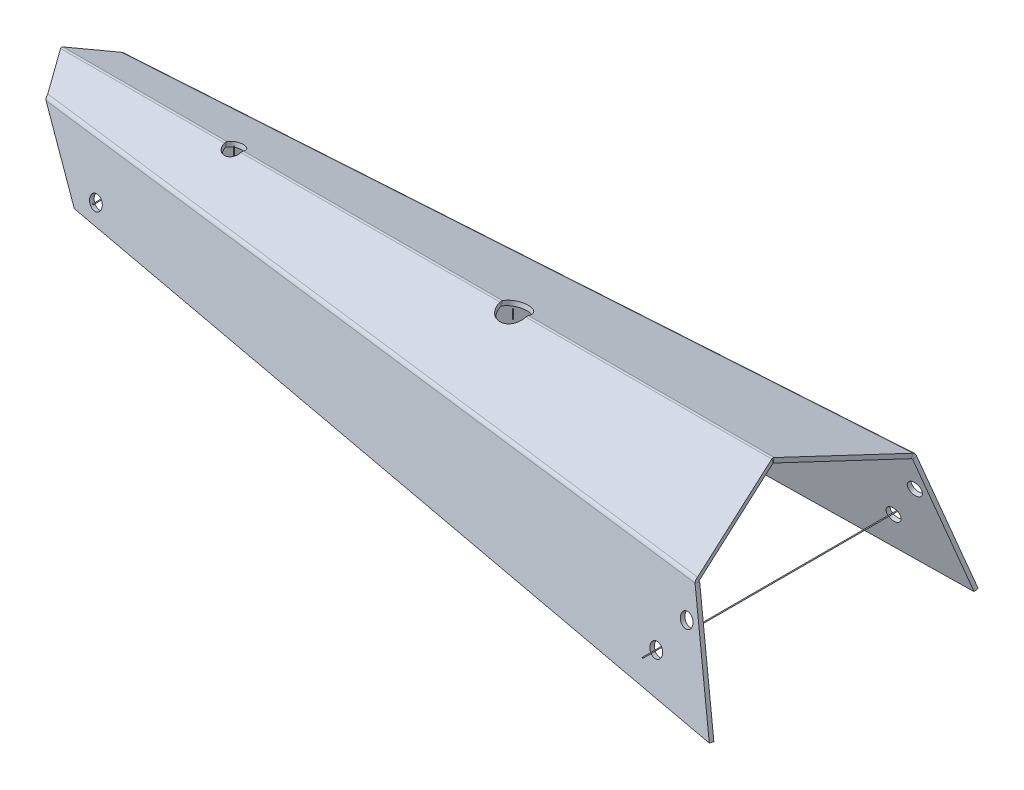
ISO-10303-21;
HEADER;
FILE_DESCRIPTION(('STEP AP214'),'2;1');
FILE_NAME('part.step','',(''),(''),'','','');
FILE_SCHEMA(('AUTOMOTIVE_DESIGN { 1 0 10303 214 1 1 1 1 }'));
ENDSEC;
DATA;
#1=APPLICATION_CONTEXT('core data for automotive mechanical design processes');
#2=APPLICATION_PROTOCOL_DEFINITION('international standard','automotive_design',2000,#1);
#3=PRODUCT_CONTEXT('',#1,'mechanical');
#4=PRODUCT('Part','Part','',(#3));
#5=PRODUCT_RELATED_PRODUCT_CATEGORY('part','',(#4));
#6=PRODUCT_DEFINITION_FORMATION('','',#4);
#7=PRODUCT_DEFINITION_CONTEXT('part definition',#1,'design');
#8=PRODUCT_DEFINITION('design','',#6,#7);
#9=PRODUCT_DEFINITION_SHAPE('','',#8);
#10=(LENGTH_UNIT() NAMED_UNIT(*) SI_UNIT(.MILLI.,.METRE.));
#11=(NAMED_UNIT(*) PLANE_ANGLE_UNIT() SI_UNIT($,.RADIAN.));
#12=(NAMED_UNIT(*) SI_UNIT($,.STERADIAN.) SOLID_ANGLE_UNIT());
#13=UNCERTAINTY_MEASURE_WITH_UNIT(LENGTH_MEASURE(1.E-05),#10,'distance_accuracy_value','');
#14=(GEOMETRIC_REPRESENTATION_CONTEXT(3) GLOBAL_UNCERTAINTY_ASSIGNED_CONTEXT((#13)) GLOBAL_UNIT_ASSIGNED_CONTEXT((#10,
#11,#12)) REPRESENTATION_CONTEXT('',''));
#15=CARTESIAN_POINT('',(0.,0.,0.));
#16=DIRECTION('',(0.,0.,1.));
#17=DIRECTION('',(1.,0.,0.));
#18=AXIS2_PLACEMENT_3D('',#15,#16,#17);
#19=CARTESIAN_POINT('',(-32.88,1.,0.225));
#20=DIRECTION('',(0.,-1.,0.));
#21=DIRECTION('',(0.,0.,-1.));
#22=AXIS2_PLACEMENT_3D('',#19,#20,#21);
#23=CYLINDRICAL_SURFACE('',#22,0.0999999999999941);
#24=CARTESIAN_POINT('',(-32.88,1.,0.225));
#25=DIRECTION('',(0.,1.,0.));
#26=DIRECTION('',(0.,0.,1.));
#27=AXIS2_PLACEMENT_3D('',#24,#25,#26);
#28=CIRCLE('',#27,0.0999999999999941);
#29=CARTESIAN_POINT('',(-32.88,1.,0.324999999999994));
#30=VERTEX_POINT('',#29);
#31=EDGE_CURVE('E12',#30,#30,#28,.T.);
#32=ORIENTED_EDGE('',*,*,#31,.F.);
#33=EDGE_LOOP('',(#32));
#34=FACE_BOUND('',#33,.T.);
#35=CARTESIAN_POINT('',(-32.88,-1.,0.225));
#36=DIRECTION('',(0.,1.,0.));
#37=DIRECTION('',(0.,0.,1.));
#38=AXIS2_PLACEMENT_3D('',#35,#36,#37);
#39=CIRCLE('',#38,0.0999999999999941);
#40=CARTESIAN_POINT('',(-32.88,-1.,0.324999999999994));
#41=VERTEX_POINT('',#40);
#42=EDGE_CURVE('E133',#41,#41,#39,.T.);
#43=ORIENTED_EDGE('',*,*,#42,.T.);
#44=EDGE_LOOP('',(#43));
#45=FACE_BOUND('',#44,.T.);
#46=ADVANCED_FACE('F127',(#34,#45),#23,.T.);
#47=CARTESIAN_POINT('',(-32.88,1.,0.225));
#48=DIRECTION('',(0.,1.,0.));
#49=DIRECTION('',(0.,0.,1.));
#50=AXIS2_PLACEMENT_3D('',#47,#48,#49);
#51=PLANE('',#50);
#52=ORIENTED_EDGE('',*,*,#31,.T.);
#53=EDGE_LOOP('',(#52));
#54=FACE_BOUND('',#53,.T.);
#55=ADVANCED_FACE('F142',(#54),#51,.T.);
#56=CARTESIAN_POINT('',(-32.88,-1.,0.225));
#57=DIRECTION('',(0.,1.,0.));
#58=DIRECTION('',(0.,0.,1.));
#59=AXIS2_PLACEMENT_3D('',#56,#57,#58);
#60=PLANE('',#59);
#61=ORIENTED_EDGE('',*,*,#42,.F.);
#62=EDGE_LOOP('',(#61));
#63=FACE_BOUND('',#62,.T.);
#64=ADVANCED_FACE('F140',(#63),#60,.F.);
#65=CLOSED_SHELL('',(#46,#55,#64));
#66=MANIFOLD_SOLID_BREP('B2',#65);
#67=CARTESIAN_POINT('',(32.12,1.,0.525705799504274));
#68=DIRECTION('',(0.,-1.,0.));
#69=DIRECTION('',(0.,0.,-1.));
#70=AXIS2_PLACEMENT_3D('',#67,#68,#69);
#71=CYLINDRICAL_SURFACE('',#70,0.100000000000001);
#72=CARTESIAN_POINT('',(32.12,1.,0.525705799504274));
#73=DIRECTION('',(0.,1.,0.));
#74=DIRECTION('',(0.,0.,1.));
#75=AXIS2_PLACEMENT_3D('',#72,#73,#74);
#76=CIRCLE('',#75,0.100000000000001);
#77=CARTESIAN_POINT('',(32.12,1.,0.625705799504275));
#78=VERTEX_POINT('',#77);
#79=EDGE_CURVE('E126',#78,#78,#76,.T.);
#80=ORIENTED_EDGE('',*,*,#79,.F.);
#81=EDGE_LOOP('',(#80));
#82=FACE_BOUND('',#81,.T.);
#83=CARTESIAN_POINT('',(32.12,-1.,0.525705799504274));
#84=DIRECTION('',(0.,1.,0.));
#85=DIRECTION('',(0.,0.,1.));
#86=AXIS2_PLACEMENT_3D('',#83,#84,#85);
#87=CIRCLE('',#86,0.100000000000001);
#88=CARTESIAN_POINT('',(32.12,-1.,0.625705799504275));
#89=VERTEX_POINT('',#88);
#90=EDGE_CURVE('E181',#89,#89,#87,.T.);
#91=ORIENTED_EDGE('',*,*,#90,.T.);
#92=EDGE_LOOP('',(#91));
#93=FACE_BOUND('',#92,.T.);
#94=ADVANCED_FACE('F175',(#82,#93),#71,.T.);
#95=CARTESIAN_POINT('',(32.12,1.,0.525705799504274));
#96=DIRECTION('',(0.,1.,0.));
#97=DIRECTION('',(0.,0.,1.));
#98=AXIS2_PLACEMENT_3D('',#95,#96,#97);
#99=PLANE('',#98);
#100=ORIENTED_EDGE('',*,*,#79,.T.);
#101=EDGE_LOOP('',(#100));
#102=FACE_BOUND('',#101,.T.);
#103=ADVANCED_FACE('F190',(#102),#99,.T.);
#104=CARTESIAN_POINT('',(32.12,-1.,0.525705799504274));
#105=DIRECTION('',(0.,1.,0.));
#106=DIRECTION('',(0.,0.,1.));
#107=AXIS2_PLACEMENT_3D('',#104,#105,#106);
#108=PLANE('',#107);
#109=ORIENTED_EDGE('',*,*,#90,.F.);
#110=EDGE_LOOP('',(#109));
#111=FACE_BOUND('',#110,.T.);
#112=ADVANCED_FACE('F188',(#111),#108,.F.);
#113=CLOSED_SHELL('',(#94,#103,#112));
#114=MANIFOLD_SOLID_BREP('B7',#113);
#115=CARTESIAN_POINT('',(-52.2867768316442,-13.676268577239,13.5));
#116=DIRECTION('',(0.,0.,-1.));
#117=DIRECTION('',(-1.,0.,0.));
#118=AXIS2_PLACEMENT_3D('',#115,#116,#117);
#119=CYLINDRICAL_SURFACE('',#118,0.100000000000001);
#120=CARTESIAN_POINT('',(-52.2867768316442,-13.676268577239,13.5));
#121=DIRECTION('',(0.,0.,1.));
#122=DIRECTION('',(1.,0.,0.));
#123=AXIS2_PLACEMENT_3D('',#120,#121,#122);
#124=CIRCLE('',#123,0.100000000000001);
#125=CARTESIAN_POINT('',(-52.1867768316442,-13.676268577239,13.5));
#126=VERTEX_POINT('',#125);
#127=EDGE_CURVE('E174',#126,#126,#124,.T.);
#128=ORIENTED_EDGE('',*,*,#127,.F.);
#129=EDGE_LOOP('',(#128));
#130=FACE_BOUND('',#129,.T.);
#131=CARTESIAN_POINT('',(-52.2867768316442,-13.676268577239,-13.5));
#132=DIRECTION('',(0.,0.,1.));
#133=DIRECTION('',(1.,0.,0.));
#134=AXIS2_PLACEMENT_3D('',#131,#132,#133);
#135=CIRCLE('',#134,0.100000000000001);
#136=CARTESIAN_POINT('',(-52.1867768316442,-13.676268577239,-13.5));
#137=VERTEX_POINT('',#136);
#138=EDGE_CURVE('E229',#137,#137,#135,.T.);
#139=ORIENTED_EDGE('',*,*,#138,.T.);
#140=EDGE_LOOP('',(#139));
#141=FACE_BOUND('',#140,.T.);
#142=ADVANCED_FACE('F223',(#130,#141),#119,.T.);
#143=CARTESIAN_POINT('',(-52.2867768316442,-13.676268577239,13.5));
#144=DIRECTION('',(0.,0.,1.));
#145=DIRECTION('',(1.,0.,0.));
#146=AXIS2_PLACEMENT_3D('',#143,#144,#145);
#147=PLANE('',#146);
#148=ORIENTED_EDGE('',*,*,#127,.T.);
#149=EDGE_LOOP('',(#148));
#150=FACE_BOUND('',#149,.T.);
#151=ADVANCED_FACE('F238',(#150),#147,.T.);
#152=CARTESIAN_POINT('',(-52.2867768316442,-13.676268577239,-13.5));
#153=DIRECTION('',(0.,0.,1.));
#154=DIRECTION('',(1.,0.,0.));
#155=AXIS2_PLACEMENT_3D('',#152,#153,#154);
#156=PLANE('',#155);
#157=ORIENTED_EDGE('',*,*,#138,.F.);
#158=EDGE_LOOP('',(#157));
#159=FACE_BOUND('',#158,.T.);
#160=ADVANCED_FACE('F236',(#159),#156,.F.);
#161=CLOSED_SHELL('',(#142,#151,#160));
#162=MANIFOLD_SOLID_BREP('B121',#161);
#163=CARTESIAN_POINT('',(92.9538385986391,-23.2686536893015,31.3086126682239));
#164=DIRECTION('',(0.,0.,-1.));
#165=DIRECTION('',(-1.,0.,0.));
#166=AXIS2_PLACEMENT_3D('',#163,#164,#165);
#167=CYLINDRICAL_SURFACE('',#166,0.100000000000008);
#168=CARTESIAN_POINT('',(92.9538385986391,-23.2686536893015,31.3086126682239));
#169=DIRECTION('',(0.,0.,1.));
#170=DIRECTION('',(1.,0.,0.));
#171=AXIS2_PLACEMENT_3D('',#168,#169,#170);
#172=CIRCLE('',#171,0.100000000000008);
#173=CARTESIAN_POINT('',(93.0538385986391,-23.2686536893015,31.3086126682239));
#174=VERTEX_POINT('',#173);
#175=EDGE_CURVE('E222',#174,#174,#172,.T.);
#176=ORIENTED_EDGE('',*,*,#175,.F.);
#177=EDGE_LOOP('',(#176));
#178=FACE_BOUND('',#177,.T.);
#179=CARTESIAN_POINT('',(92.9538385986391,-23.2686536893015,-31.0175045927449));
#180=DIRECTION('',(0.,0.,1.));
#181=DIRECTION('',(1.,0.,0.));
#182=AXIS2_PLACEMENT_3D('',#179,#180,#181);
#183=CIRCLE('',#182,0.100000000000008);
#184=CARTESIAN_POINT('',(93.0538385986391,-23.2686536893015,-31.0175045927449));
#185=VERTEX_POINT('',#184);
#186=EDGE_CURVE('E278',#185,#185,#183,.T.);
#187=ORIENTED_EDGE('',*,*,#186,.T.);
#188=EDGE_LOOP('',(#187));
#189=FACE_BOUND('',#188,.T.);
#190=ADVANCED_FACE('F272',(#178,#189),#167,.T.);
#191=CARTESIAN_POINT('',(92.9538385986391,-23.2686536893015,31.3086126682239));
#192=DIRECTION('',(0.,0.,1.));
#193=DIRECTION('',(1.,0.,0.));
#194=AXIS2_PLACEMENT_3D('',#191,#192,#193);
#195=PLANE('',#194);
#196=ORIENTED_EDGE('',*,*,#175,.T.);
#197=EDGE_LOOP('',(#196));
#198=FACE_BOUND('',#197,.T.);
#199=ADVANCED_FACE('F287',(#198),#195,.T.);
#200=CARTESIAN_POINT('',(92.9538385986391,-23.2686536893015,-31.0175045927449));
#201=DIRECTION('',(0.,0.,1.));
#202=DIRECTION('',(1.,0.,0.));
#203=AXIS2_PLACEMENT_3D('',#200,#201,#202);
#204=PLANE('',#203);
#205=ORIENTED_EDGE('',*,*,#186,.F.);
#206=EDGE_LOOP('',(#205));
#207=FACE_BOUND('',#206,.T.);
#208=ADVANCED_FACE('F285',(#207),#204,.F.);
#209=CLOSED_SHELL('',(#190,#199,#208));
#210=MANIFOLD_SOLID_BREP('B169',#209);
#211=CARTESIAN_POINT('',(-85.2590756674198,-6.18680581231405,-19.1811436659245));
#212=DIRECTION('',(0.,0.953716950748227,-0.300705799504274));
#213=DIRECTION('',(0.,0.300705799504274,0.953716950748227));
#214=AXIS2_PLACEMENT_3D('',#211,#212,#213);
#215=PLANE('',#214);
#216=CARTESIAN_POINT('',(32.12,-0.0680722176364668,0.225));
#217=DIRECTION('',(0.,0.953716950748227,-0.300705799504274));
#218=DIRECTION('',(0.,0.300705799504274,0.953716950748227));
#219=AXIS2_PLACEMENT_3D('',#216,#217,#218);
#220=ELLIPSE('',#219,3.14558737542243,3.);
#221=CARTESIAN_POINT('',(35.1199904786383,-0.070455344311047,0.217441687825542));
#222=VERTEX_POINT('',#221);
#223=CARTESIAN_POINT('',(29.1200095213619,-0.0704553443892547,0.217441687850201));
#224=VERTEX_POINT('',#223);
#225=EDGE_CURVE('E2415',#222,#224,#220,.T.);
#226=ORIENTED_EDGE('',*,*,#225,.T.);
#227=DIRECTION('',(-1.,0.,0.));
#228=VECTOR('',#227,1.);
#229=CARTESIAN_POINT('',(-85.2590756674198,-0.0704553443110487,0.217441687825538));
#230=LINE('',#229,#228);
#231=CARTESIAN_POINT('',(-30.9800150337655,-0.0704553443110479,0.21744168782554));
#232=VERTEX_POINT('',#231);
#233=EDGE_CURVE('E904',#224,#232,#230,.T.);
#234=ORIENTED_EDGE('',*,*,#233,.T.);
#235=CARTESIAN_POINT('',(-32.88,-0.0680722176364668,0.225));
#236=DIRECTION('',(0.,0.953716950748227,-0.300705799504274));
#237=DIRECTION('',(0.,0.300705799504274,0.953716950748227));
#238=AXIS2_PLACEMENT_3D('',#235,#236,#237);
#239=ELLIPSE('',#238,1.99220533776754,1.9);
#240=CARTESIAN_POINT('',(-34.7799969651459,-0.070455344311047,0.220448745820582));
#241=VERTEX_POINT('',#240);
#242=EDGE_CURVE('E1172',#232,#241,#239,.T.);
#243=ORIENTED_EDGE('',*,*,#242,.T.);
#244=DIRECTION('',(-1.,0.,0.));
#245=VECTOR('',#244,1.);
#246=CARTESIAN_POINT('',(-85.2590756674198,-0.0704553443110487,0.217441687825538));
#247=LINE('',#246,#245);
#248=CARTESIAN_POINT('',(-72.7958153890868,-0.0704553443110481,0.21744168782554));
#249=VERTEX_POINT('',#248);
#250=EDGE_CURVE('E270',#241,#249,#247,.T.);
#251=ORIENTED_EDGE('',*,*,#250,.T.);
#252=DIRECTION('',(-0.514339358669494,0.257881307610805,0.817895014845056));
#253=VECTOR('',#252,1.);
#254=CARTESIAN_POINT('',(-57.8483412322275,-7.56487340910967,-23.5518156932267));
#255=LINE('',#254,#253);
#256=CARTESIAN_POINT('',(-67.617082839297,-2.66698679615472,-8.01770396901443));
#257=VERTEX_POINT('',#256);
#258=EDGE_CURVE('E899',#257,#249,#255,.T.);
#259=ORIENTED_EDGE('',*,*,#258,.F.);
#260=DIRECTION('',(0.994691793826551,-0.0309423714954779,-0.0981366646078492));
#261=VECTOR('',#260,1.);
#262=CARTESIAN_POINT('',(-83.8742173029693,-2.16126804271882,-6.41376899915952));
#263=LINE('',#262,#261);
#264=CARTESIAN_POINT('',(99.5406255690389,-7.86684461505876,-24.5095460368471));
#265=VERTEX_POINT('',#264);
#266=EDGE_CURVE('E922',#257,#265,#263,.T.);
#267=ORIENTED_EDGE('',*,*,#266,.T.);
#268=DIRECTION('',(0.273959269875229,-0.289201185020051,-0.917228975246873));
#269=VECTOR('',#268,1.);
#270=CARTESIAN_POINT('',(107.110760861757,-15.8581496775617,-49.8547276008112));
#271=LINE('',#270,#269);
#272=CARTESIAN_POINT('',(92.1551333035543,-0.070455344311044,0.217441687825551));
#273=VERTEX_POINT('',#272);
#274=EDGE_CURVE('E900',#273,#265,#271,.T.);
#275=ORIENTED_EDGE('',*,*,#274,.F.);
#276=DIRECTION('',(-1.,0.,0.));
#277=VECTOR('',#276,1.);
#278=CARTESIAN_POINT('',(-85.2590756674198,-0.0704553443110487,0.217441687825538));
#279=LINE('',#278,#277);
#280=EDGE_CURVE('E863',#273,#222,#279,.T.);
#281=ORIENTED_EDGE('',*,*,#280,.T.);
#282=EDGE_LOOP('',(#226,#234,#243,#251,#259,#267,#275,#281));
#283=FACE_BOUND('',#282,.T.);
#284=ADVANCED_FACE('F312',(#283),#215,.F.);
#285=CARTESIAN_POINT('',(-85.2590756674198,-5.23308886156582,-19.4818494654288));
#286=DIRECTION('',(0.,0.953716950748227,-0.300705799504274));
#287=DIRECTION('',(0.,0.300705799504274,0.953716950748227));
#288=AXIS2_PLACEMENT_3D('',#285,#286,#287);
#289=PLANE('',#288);
#290=DIRECTION('',(-1.,0.,0.));
#291=VECTOR('',#290,1.);
#292=CARTESIAN_POINT('',(-85.2590756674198,0.883261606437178,-0.0832641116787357));
#293=LINE('',#292,#291);
#294=CARTESIAN_POINT('',(29.1200095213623,0.883261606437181,-0.0832641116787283));
#295=VERTEX_POINT('',#294);
#296=CARTESIAN_POINT('',(-30.9800150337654,0.883261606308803,-0.0832641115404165));
#297=VERTEX_POINT('',#296);
#298=EDGE_CURVE('E902',#295,#297,#293,.T.);
#299=ORIENTED_EDGE('',*,*,#298,.F.);
#300=CARTESIAN_POINT('',(32.12,0.88564473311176,-0.0757057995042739));
#301=DIRECTION('',(0.,0.953716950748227,-0.300705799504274));
#302=DIRECTION('',(0.,0.300705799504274,0.953716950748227));
#303=AXIS2_PLACEMENT_3D('',#300,#301,#302);
#304=ELLIPSE('',#303,3.14558737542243,3.);
#305=CARTESIAN_POINT('',(35.1199904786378,0.883261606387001,-0.0832641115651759));
#306=VERTEX_POINT('',#305);
#307=EDGE_CURVE('E2301',#306,#295,#304,.T.);
#308=ORIENTED_EDGE('',*,*,#307,.F.);
#309=DIRECTION('',(-1.,0.,0.));
#310=VECTOR('',#309,1.);
#311=CARTESIAN_POINT('',(-85.2590756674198,0.883261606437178,-0.0832641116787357));
#312=LINE('',#311,#310);
#313=CARTESIAN_POINT('',(92.1551333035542,0.883261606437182,-0.0832641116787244));
#314=VERTEX_POINT('',#313);
#315=EDGE_CURVE('E855',#314,#306,#312,.T.);
#316=ORIENTED_EDGE('',*,*,#315,.F.);
#317=DIRECTION('',(0.273959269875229,-0.289201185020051,-0.917228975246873));
#318=VECTOR('',#317,1.);
#319=CARTESIAN_POINT('',(107.110760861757,-14.9044327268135,-50.1554334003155));
#320=LINE('',#319,#318);
#321=CARTESIAN_POINT('',(99.5406255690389,-6.91312766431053,-24.8102518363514));
#322=VERTEX_POINT('',#321);
#323=EDGE_CURVE('E895',#314,#322,#320,.T.);
#324=ORIENTED_EDGE('',*,*,#323,.T.);
#325=DIRECTION('',(0.994691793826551,-0.0309423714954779,-0.0981366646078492));
#326=VECTOR('',#325,1.);
#327=CARTESIAN_POINT('',(-83.8742173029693,-1.20755109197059,-6.71447479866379));
#328=LINE('',#327,#326);
#329=CARTESIAN_POINT('',(-67.617082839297,-1.7132698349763,-8.31840977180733));
#330=VERTEX_POINT('',#329);
#331=EDGE_CURVE('E927',#330,#322,#328,.T.);
#332=ORIENTED_EDGE('',*,*,#331,.F.);
#333=DIRECTION('',(-0.514339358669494,0.257881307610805,0.817895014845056));
#334=VECTOR('',#333,1.);
#335=CARTESIAN_POINT('',(-57.8483412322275,-6.61115645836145,-23.852521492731));
#336=LINE('',#335,#334);
#337=CARTESIAN_POINT('',(-72.7958153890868,0.883261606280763,-0.0832641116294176));
#338=VERTEX_POINT('',#337);
#339=EDGE_CURVE('E898',#330,#338,#336,.T.);
#340=ORIENTED_EDGE('',*,*,#339,.T.);
#341=DIRECTION('',(-1.,0.,0.));
#342=VECTOR('',#341,1.);
#343=CARTESIAN_POINT('',(-85.2590756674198,0.883261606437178,-0.0832641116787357));
#344=LINE('',#343,#342);
#345=CARTESIAN_POINT('',(-34.7799849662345,0.88326160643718,-0.0832641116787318));
#346=VERTEX_POINT('',#345);
#347=EDGE_CURVE('E317',#346,#338,#344,.T.);
#348=ORIENTED_EDGE('',*,*,#347,.F.);
#349=CARTESIAN_POINT('',(-32.88,0.88564473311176,-0.0757057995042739));
#350=DIRECTION('',(0.,0.953716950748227,-0.300705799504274));
#351=DIRECTION('',(0.,0.300705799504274,0.953716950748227));
#352=AXIS2_PLACEMENT_3D('',#349,#350,#351);
#353=ELLIPSE('',#352,1.99220533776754,1.9);
#354=EDGE_CURVE('E1371',#297,#346,#353,.T.);
#355=ORIENTED_EDGE('',*,*,#354,.F.);
#356=EDGE_LOOP('',(#299,#308,#316,#324,#332,#340,#348,#355));
#357=FACE_BOUND('',#356,.T.);
#358=ADVANCED_FACE('F822',(#357),#289,.T.);
#359=CARTESIAN_POINT('',(-85.2590756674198,7.09329434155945,-19.1715459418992));
#360=DIRECTION('',(0.,0.953716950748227,0.300705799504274));
#361=DIRECTION('',(0.,-0.300705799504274,0.953716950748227));
#362=AXIS2_PLACEMENT_3D('',#359,#360,#361);
#363=PLANE('',#362);
#364=DIRECTION('',(-1.,0.,0.));
#365=VECTOR('',#364,1.);
#366=CARTESIAN_POINT('',(-85.2590756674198,0.883261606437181,0.524161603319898));
#367=LINE('',#366,#365);
#368=CARTESIAN_POINT('',(92.1552660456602,0.883261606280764,0.524161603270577));
#369=VERTEX_POINT('',#368);
#370=CARTESIAN_POINT('',(35.1199996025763,0.88326160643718,0.5241616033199));
#371=VERTEX_POINT('',#370);
#372=EDGE_CURVE('E571',#369,#371,#367,.T.);
#373=ORIENTED_EDGE('',*,*,#372,.T.);
#374=CARTESIAN_POINT('',(32.12,0.882774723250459,0.525705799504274));
#375=DIRECTION('',(0.,0.953716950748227,0.300705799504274));
#376=DIRECTION('',(0.,0.300705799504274,-0.953716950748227));
#377=AXIS2_PLACEMENT_3D('',#374,#375,#376);
#378=ELLIPSE('',#377,3.14558737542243,3.);
#379=CARTESIAN_POINT('',(29.1200003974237,0.883261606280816,0.524161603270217));
#380=VERTEX_POINT('',#379);
#381=EDGE_CURVE('E562',#380,#371,#378,.T.);
#382=ORIENTED_EDGE('',*,*,#381,.F.);
#383=DIRECTION('',(-1.,0.,0.));
#384=VECTOR('',#383,1.);
#385=CARTESIAN_POINT('',(-85.2590756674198,0.883261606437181,0.524161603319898));
#386=LINE('',#385,#384);
#387=CARTESIAN_POINT('',(-30.9800006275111,0.883261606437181,0.524161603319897));
#388=VERTEX_POINT('',#387);
#389=EDGE_CURVE('E339',#380,#388,#386,.T.);
#390=ORIENTED_EDGE('',*,*,#389,.T.);
#391=CARTESIAN_POINT('',(-32.88,0.882774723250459,0.525705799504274));
#392=DIRECTION('',(0.,0.953716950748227,0.300705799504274));
#393=DIRECTION('',(0.,0.300705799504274,-0.953716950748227));
#394=AXIS2_PLACEMENT_3D('',#391,#392,#393);
#395=ELLIPSE('',#394,1.99220533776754,1.9);
#396=CARTESIAN_POINT('',(-34.7799993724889,0.883261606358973,0.524161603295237));
#397=VERTEX_POINT('',#396);
#398=EDGE_CURVE('E1357',#397,#388,#395,.T.);
#399=ORIENTED_EDGE('',*,*,#398,.F.);
#400=DIRECTION('',(-1.,0.,0.));
#401=VECTOR('',#400,1.);
#402=CARTESIAN_POINT('',(-85.2590756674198,0.883261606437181,0.524161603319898));
#403=LINE('',#402,#401);
#404=CARTESIAN_POINT('',(-72.7952266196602,0.883261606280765,0.524161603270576));
#405=VERTEX_POINT('',#404);
#406=EDGE_CURVE('E578',#397,#405,#403,.T.);
#407=ORIENTED_EDGE('',*,*,#406,.T.);
#408=DIRECTION('',(0.516717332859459,-0.257451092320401,0.816530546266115));
#409=VECTOR('',#408,1.);
#410=CARTESIAN_POINT('',(-72.8892391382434,0.930102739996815,0.37560050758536));
#411=LINE('',#410,#409);
#412=CARTESIAN_POINT('',(-67.6827464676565,-1.66399878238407,8.60303944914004));
#413=VERTEX_POINT('',#412);
#414=EDGE_CURVE('E580',#405,#413,#411,.T.);
#415=ORIENTED_EDGE('',*,*,#414,.T.);
#416=DIRECTION('',(-0.994691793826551,0.0309423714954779,-0.0981366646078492));
#417=VECTOR('',#416,1.);
#418=CARTESIAN_POINT('',(-88.0537429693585,-1.03030809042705,6.59322930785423));
#419=LINE('',#418,#417);
#420=CARTESIAN_POINT('',(99.5172894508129,-6.86517331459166,25.0990575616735));
#421=VERTEX_POINT('',#420);
#422=EDGE_CURVE('E591',#421,#413,#419,.T.);
#423=ORIENTED_EDGE('',*,*,#422,.F.);
#424=DIRECTION('',(-0.27471706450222,0.289136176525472,-0.917022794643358));
#425=VECTOR('',#424,1.);
#426=CARTESIAN_POINT('',(92.1107608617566,0.930102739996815,0.37560050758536));
#427=LINE('',#426,#425);
#428=EDGE_CURVE('E581',#421,#369,#427,.T.);
#429=ORIENTED_EDGE('',*,*,#428,.T.);
#430=EDGE_LOOP('',(#373,#382,#390,#399,#407,#415,#423,#429));
#431=FACE_BOUND('',#430,.T.);
#432=ADVANCED_FACE('F569',(#431),#363,.T.);
#433=CARTESIAN_POINT('',(-85.2590756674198,6.13957739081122,-19.4722517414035));
#434=DIRECTION('',(0.,0.953716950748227,0.300705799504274));
#435=DIRECTION('',(0.,-0.300705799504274,0.953716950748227));
#436=AXIS2_PLACEMENT_3D('',#433,#434,#435);
#437=PLANE('',#436);
#438=CARTESIAN_POINT('',(32.12,-0.0709422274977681,0.225));
#439=DIRECTION('',(0.,0.953716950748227,0.300705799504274));
#440=DIRECTION('',(0.,0.300705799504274,-0.953716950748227));
#441=AXIS2_PLACEMENT_3D('',#438,#439,#440);
#442=ELLIPSE('',#441,3.14558737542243,3.);
#443=CARTESIAN_POINT('',(29.1200003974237,-0.070455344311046,0.223455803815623));
#444=VERTEX_POINT('',#443);
#445=CARTESIAN_POINT('',(35.1199996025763,-0.0704553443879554,0.223455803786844));
#446=VERTEX_POINT('',#445);
#447=EDGE_CURVE('E565',#444,#446,#442,.T.);
#448=ORIENTED_EDGE('',*,*,#447,.T.);
#449=DIRECTION('',(-1.,0.,0.));
#450=VECTOR('',#449,1.);
#451=CARTESIAN_POINT('',(-85.2590756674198,-0.0704553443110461,0.223455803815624));
#452=LINE('',#451,#450);
#453=CARTESIAN_POINT('',(92.1552660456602,-0.0704553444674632,0.223455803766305));
#454=VERTEX_POINT('',#453);
#455=EDGE_CURVE('E653',#454,#446,#452,.T.);
#456=ORIENTED_EDGE('',*,*,#455,.F.);
#457=DIRECTION('',(-0.27471706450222,0.289136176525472,-0.917022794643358));
#458=VECTOR('',#457,1.);
#459=CARTESIAN_POINT('',(92.1107608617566,-0.0236142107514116,0.0748947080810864));
#460=LINE('',#459,#458);
#461=CARTESIAN_POINT('',(99.5172894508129,-7.81889027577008,24.7983517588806));
#462=VERTEX_POINT('',#461);
#463=EDGE_CURVE('E716',#462,#454,#460,.T.);
#464=ORIENTED_EDGE('',*,*,#463,.F.);
#465=DIRECTION('',(-0.994691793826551,0.0309423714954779,-0.0981366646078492));
#466=VECTOR('',#465,1.);
#467=CARTESIAN_POINT('',(-88.0537429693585,-1.98402504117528,6.29252350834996));
#468=LINE('',#467,#466);
#469=CARTESIAN_POINT('',(-67.6827464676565,-2.6177157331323,8.30233364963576));
#470=VERTEX_POINT('',#469);
#471=EDGE_CURVE('E723',#462,#470,#468,.T.);
#472=ORIENTED_EDGE('',*,*,#471,.T.);
#473=DIRECTION('',(0.516717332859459,-0.257451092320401,0.816530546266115));
#474=VECTOR('',#473,1.);
#475=CARTESIAN_POINT('',(-72.8892391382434,-0.0236142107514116,0.0748947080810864));
#476=LINE('',#475,#474);
#477=CARTESIAN_POINT('',(-72.7952266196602,-0.0704553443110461,0.223455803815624));
#478=VERTEX_POINT('',#477);
#479=EDGE_CURVE('E709',#478,#470,#476,.T.);
#480=ORIENTED_EDGE('',*,*,#479,.F.);
#481=DIRECTION('',(-1.,0.,0.));
#482=VECTOR('',#481,1.);
#483=CARTESIAN_POINT('',(-85.2590756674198,-0.0704553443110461,0.223455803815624));
#484=LINE('',#483,#482);
#485=EDGE_CURVE('E655',#241,#478,#484,.T.);
#486=ORIENTED_EDGE('',*,*,#485,.F.);
#487=CARTESIAN_POINT('',(-32.88,-0.0709422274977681,0.225));
#488=DIRECTION('',(0.,0.953716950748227,0.300705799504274));
#489=DIRECTION('',(0.,0.300705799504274,-0.953716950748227));
#490=AXIS2_PLACEMENT_3D('',#487,#488,#489);
#491=ELLIPSE('',#490,1.99220533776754,1.9);
#492=CARTESIAN_POINT('',(-30.9800006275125,-0.0704553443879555,0.223455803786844));
#493=VERTEX_POINT('',#492);
#494=EDGE_CURVE('E1185',#241,#493,#491,.T.);
#495=ORIENTED_EDGE('',*,*,#494,.T.);
#496=DIRECTION('',(-1.,0.,0.));
#497=VECTOR('',#496,1.);
#498=CARTESIAN_POINT('',(-85.2590756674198,-0.0704553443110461,0.223455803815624));
#499=LINE('',#498,#497);
#500=EDGE_CURVE('E654',#444,#493,#499,.T.);
#501=ORIENTED_EDGE('',*,*,#500,.F.);
#502=EDGE_LOOP('',(#448,#456,#464,#472,#480,#486,#495,#501));
#503=FACE_BOUND('',#502,.T.);
#504=ADVANCED_FACE('F683',(#503),#437,.F.);
#505=CARTESIAN_POINT('',(60.0808521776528,-0.0799925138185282,0.220448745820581));
#506=DIRECTION('',(-1.,0.,0.));
#507=DIRECTION('',(0.,-0.300705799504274,0.953716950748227));
#508=AXIS2_PLACEMENT_3D('',#505,#506,#507);
#509=CYLINDRICAL_SURFACE('',#508,1.00999999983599);
#510=ORIENTED_EDGE('',*,*,#389,.F.);
#511=CARTESIAN_POINT('',(29.1200095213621,0.883261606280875,-0.0832641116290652));
#512=CARTESIAN_POINT('',(29.1200088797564,0.891371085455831,-0.0575434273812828));
#513=CARTESIAN_POINT('',(29.1200082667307,0.898446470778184,-0.0315097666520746));
#514=CARTESIAN_POINT('',(29.1200071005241,0.910491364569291,0.0210285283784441));
#515=CARTESIAN_POINT('',(29.1200065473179,0.915461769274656,0.0475329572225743));
#516=CARTESIAN_POINT('',(29.1200049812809,0.927163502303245,0.127522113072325));
#517=CARTESIAN_POINT('',(29.120004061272,0.930694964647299,0.181513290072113));
#518=CARTESIAN_POINT('',(29.1200025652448,0.929172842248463,0.284278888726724));
#519=CARTESIAN_POINT('',(29.1200019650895,0.924891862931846,0.333068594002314));
#520=CARTESIAN_POINT('',(29.1200009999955,0.909322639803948,0.429649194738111));
#521=CARTESIAN_POINT('',(29.1200006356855,0.898015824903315,0.477437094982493));
#522=CARTESIAN_POINT('',(29.1200003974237,0.883261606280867,0.524161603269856));
#523=B_SPLINE_CURVE_WITH_KNOTS('',3,(#511,#512,#513,#514,#515,#516,#517,#518,#519,#520,#521,
#522),.UNSPECIFIED.,.F.,.F.,(4,2,2,2,2,4),(0.,0.0808600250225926,0.161685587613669,
0.323241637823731,0.469676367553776,0.616499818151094),.UNSPECIFIED.);
#524=CARTESIAN_POINT('',(29.1200004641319,0.929989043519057,0.226552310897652));
#525=VERTEX_POINT('',#524);
#526=EDGE_CURVE('E547',#525,#380,#523,.T.);
#527=ORIENTED_EDGE('',*,*,#526,.F.);
#528=CARTESIAN_POINT('',(29.1358798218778,0.883261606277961,-0.0832641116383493));
#529=CARTESIAN_POINT('',(29.135686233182,0.883852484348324,-0.0813900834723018));
#530=CARTESIAN_POINT('',(29.1354943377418,0.884437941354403,-0.0795141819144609));
#531=CARTESIAN_POINT('',(29.1345432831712,0.887338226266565,-0.0701249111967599));
#532=CARTESIAN_POINT('',(29.1338095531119,0.889571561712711,-0.0625838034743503));
#533=CARTESIAN_POINT('',(29.1302739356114,0.900309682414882,-0.0247043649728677));
#534=CARTESIAN_POINT('',(29.1278815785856,0.907496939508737,0.00605532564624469));
#535=CARTESIAN_POINT('',(29.1226734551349,0.922871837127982,0.0893673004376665));
#536=CARTESIAN_POINT('',(29.1206805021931,0.928402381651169,0.14248332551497));
#537=CARTESIAN_POINT('',(29.1195996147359,0.931044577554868,0.250490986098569));
#538=CARTESIAN_POINT('',(29.1205963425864,0.927911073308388,0.305389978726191));
#539=CARTESIAN_POINT('',(29.124279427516,0.916512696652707,0.387392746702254));
#540=CARTESIAN_POINT('',(29.1259088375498,0.911482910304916,0.415034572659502));
#541=CARTESIAN_POINT('',(29.1298940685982,0.899108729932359,0.469966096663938));
#542=CARTESIAN_POINT('',(29.1322553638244,0.891746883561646,0.497251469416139));
#543=CARTESIAN_POINT('',(29.1349535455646,0.883261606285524,0.52416160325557));
#544=B_SPLINE_CURVE_WITH_KNOTS('',3,(#528,#529,#530,#531,#532,#533,#534,#535,#536,#537,#538,
#539,#540,#541,#542,#543),.UNSPECIFIED.,.F.,.F.,(4,2,2,2,2,2,2,4),(0.,0.00592342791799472,
0.0296187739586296,0.124505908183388,0.284067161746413,0.44818915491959,0.532525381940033,
0.617508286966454),.UNSPECIFIED.);
#545=CARTESIAN_POINT('',(29.1200000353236,0.929997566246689,0.224925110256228));
#546=VERTEX_POINT('',#545);
#547=EDGE_CURVE('E553',#546,#525,#544,.T.);
#548=ORIENTED_EDGE('',*,*,#547,.F.);
#549=CARTESIAN_POINT('',(29.1200005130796,0.930003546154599,0.223269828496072));
#550=VERTEX_POINT('',#549);
#551=EDGE_CURVE('E2245',#550,#546,#544,.T.);
#552=ORIENTED_EDGE('',*,*,#551,.F.);
#553=CARTESIAN_POINT('',(29.1200034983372,0.93000748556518,0.220418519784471));
#554=VERTEX_POINT('',#553);
#555=EDGE_CURVE('E2246',#554,#550,#544,.T.);
#556=ORIENTED_EDGE('',*,*,#555,.F.);
#557=EDGE_CURVE('E555',#295,#554,#523,.T.);
#558=ORIENTED_EDGE('',*,*,#557,.F.);
#559=ORIENTED_EDGE('',*,*,#298,.T.);
#560=CARTESIAN_POINT('',(-30.9800006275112,0.883261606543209,0.524161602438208));
#561=CARTESIAN_POINT('',(-30.9800008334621,0.891329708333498,0.498572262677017));
#562=CARTESIAN_POINT('',(-30.9800010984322,0.898374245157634,0.472672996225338));
#563=CARTESIAN_POINT('',(-30.9800017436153,0.910379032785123,0.420407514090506));
#564=CARTESIAN_POINT('',(-30.9800021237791,0.915340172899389,0.394041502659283));
#565=CARTESIAN_POINT('',(-30.9800034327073,0.927047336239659,0.314469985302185));
#566=CARTESIAN_POINT('',(-30.9800045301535,0.930626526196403,0.26076102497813));
#567=CARTESIAN_POINT('',(-30.9800070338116,0.929272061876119,0.15799488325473));
#568=CARTESIAN_POINT('',(-30.9800084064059,0.925027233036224,0.108925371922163));
#569=CARTESIAN_POINT('',(-30.9800114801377,0.909450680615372,0.0117883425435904));
#570=CARTESIAN_POINT('',(-30.9800131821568,0.898099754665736,-0.0362760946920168));
#571=CARTESIAN_POINT('',(-30.9800150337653,0.883261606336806,-0.083264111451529));
#572=B_SPLINE_CURVE_WITH_KNOTS('',3,(#560,#561,#562,#563,#564,#565,#566,#567,#568,#569,#570,
#571),.UNSPECIFIED.,.F.,.F.,(4,2,2,2,2,4),(0.,0.0804477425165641,0.160861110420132,
0.321594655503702,0.468846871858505,0.616498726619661),.UNSPECIFIED.);
#573=CARTESIAN_POINT('',(-30.9800055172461,0.930007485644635,0.220421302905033));
#574=VERTEX_POINT('',#573);
#575=EDGE_CURVE('E1236',#574,#297,#572,.T.);
#576=ORIENTED_EDGE('',*,*,#575,.F.);
#577=CARTESIAN_POINT('',(-31.0036998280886,0.883261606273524,0.524161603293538));
#578=CARTESIAN_POINT('',(-31.0030837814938,0.884479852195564,0.520297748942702));
#579=CARTESIAN_POINT('',(-31.0024784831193,0.88567535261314,0.516425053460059));
#580=CARTESIAN_POINT('',(-30.9995058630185,0.891539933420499,0.497013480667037));
#581=CARTESIAN_POINT('',(-30.9973025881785,0.895865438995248,0.481345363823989));
#582=CARTESIAN_POINT('',(-30.9912479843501,0.907723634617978,0.43393721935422));
#583=CARTESIAN_POINT('',(-30.9879579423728,0.914126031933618,0.401826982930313));
#584=CARTESIAN_POINT('',(-30.9842539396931,0.921370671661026,0.353266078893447));
#585=CARTESIAN_POINT('',(-30.9832246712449,0.923391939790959,0.337021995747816));
#586=CARTESIAN_POINT('',(-30.9807614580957,0.928272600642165,0.288084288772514));
#587=CARTESIAN_POINT('',(-30.9799559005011,0.929941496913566,0.255222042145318));
#588=CARTESIAN_POINT('',(-30.9800247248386,0.930037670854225,0.205979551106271));
#589=CARTESIAN_POINT('',(-30.9802600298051,0.929669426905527,0.189583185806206));
#590=CARTESIAN_POINT('',(-30.9816039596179,0.927365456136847,0.140416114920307));
#591=CARTESIAN_POINT('',(-30.9833515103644,0.924228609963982,0.107704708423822));
#592=CARTESIAN_POINT('',(-30.9880369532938,0.915621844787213,0.0484314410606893));
#593=CARTESIAN_POINT('',(-30.9907201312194,0.910642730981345,0.0217747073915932));
#594=CARTESIAN_POINT('',(-30.9971569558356,0.89854911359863,-0.0311465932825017));
#595=CARTESIAN_POINT('',(-31.0009190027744,0.891417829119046,-0.0574063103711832));
#596=CARTESIAN_POINT('',(-31.0051738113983,0.883261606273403,-0.0832641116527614));
#597=B_SPLINE_CURVE_WITH_KNOTS('',3,(#577,#578,#579,#580,#581,#582,#583,#584,#585,#586,#587,
#588,#589,#590,#591,#592,#593,#594,#595,#596),.UNSPECIFIED.,.F.,.F.,(4,2,2,2,2,2,2,2,2,4),(0.,
0.0122936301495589,0.0614841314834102,0.159973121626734,0.209164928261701,0.307661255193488,
0.356853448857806,0.455349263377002,0.536998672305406,0.61930192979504),.UNSPECIFIED.);
#598=CARTESIAN_POINT('',(-30.9800016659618,0.93000544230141,0.222480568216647));
#599=VERTEX_POINT('',#598);
#600=EDGE_CURVE('E1270',#599,#574,#597,.T.);
#601=ORIENTED_EDGE('',*,*,#600,.F.);
#602=CARTESIAN_POINT('',(-30.9800053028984,0.929966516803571,0.229545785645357));
#603=VERTEX_POINT('',#602);
#604=EDGE_CURVE('E1302',#603,#599,#597,.T.);
#605=ORIENTED_EDGE('',*,*,#604,.F.);
#606=EDGE_CURVE('E577',#388,#603,#572,.T.);
#607=ORIENTED_EDGE('',*,*,#606,.F.);
#608=EDGE_LOOP('',(#510,#527,#548,#552,#556,#558,#559,#576,#601,#605,#607));
#609=FACE_BOUND('',#608,.T.);
#610=ADVANCED_FACE('F574',(#609),#509,.T.);
#611=CARTESIAN_POINT('',(60.0808521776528,-0.0799925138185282,0.220448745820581));
#612=DIRECTION('',(-1.,0.,0.));
#613=DIRECTION('',(0.,-0.300705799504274,0.953716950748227));
#614=AXIS2_PLACEMENT_3D('',#611,#612,#613);
#615=CYLINDRICAL_SURFACE('',#614,0.0099999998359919);
#616=CARTESIAN_POINT('',(29.1200095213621,-0.0704553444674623,0.217441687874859));
#617=CARTESIAN_POINT('',(29.120007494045,-0.0701997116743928,0.218246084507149));
#618=CARTESIAN_POINT('',(29.1200057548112,-0.0700503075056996,0.219081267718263));
#619=CARTESIAN_POINT('',(29.1200033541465,-0.0699757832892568,0.2205081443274));
#620=CARTESIAN_POINT('',(29.1200025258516,-0.0699965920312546,0.221097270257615));
#621=CARTESIAN_POINT('',(29.1200011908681,-0.0701429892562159,0.222281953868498));
#622=CARTESIAN_POINT('',(29.1200006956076,-0.0702719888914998,0.222877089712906));
#623=CARTESIAN_POINT('',(29.1200003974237,-0.0704553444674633,0.223455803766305));
#624=B_SPLINE_CURVE_WITH_KNOTS('',3,(#616,#617,#618,#619,#620,#621,#622,#623),.UNSPECIFIED.,.F.,
.F.,(4,2,2,4),(0.,0.00252008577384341,0.00427978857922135,0.0060971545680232),.UNSPECIFIED.);
#625=CARTESIAN_POINT('',(29.120003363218,-0.0699929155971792,0.220538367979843));
#626=VERTEX_POINT('',#625);
#627=EDGE_CURVE('E2210',#626,#444,#624,.T.);
#628=ORIENTED_EDGE('',*,*,#627,.T.);
#629=ORIENTED_EDGE('',*,*,#500,.T.);
#630=CARTESIAN_POINT('',(-30.9800006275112,-0.0704553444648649,0.223455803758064));
#631=CARTESIAN_POINT('',(-30.9800012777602,-0.070199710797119,0.222651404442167));
#632=CARTESIAN_POINT('',(-30.9800025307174,-0.0700503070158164,0.221816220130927));
#633=CARTESIAN_POINT('',(-30.9800055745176,-0.069975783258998,0.220389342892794));
#634=CARTESIAN_POINT('',(-30.9800070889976,-0.0699965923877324,0.21980021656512));
#635=CARTESIAN_POINT('',(-30.980010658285,-0.0701429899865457,0.218615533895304));
#636=CARTESIAN_POINT('',(-30.980012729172,-0.0702719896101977,0.21802039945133));
#637=CARTESIAN_POINT('',(-30.9800150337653,-0.0704553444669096,0.217441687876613));
#638=B_SPLINE_CURVE_WITH_KNOTS('',3,(#630,#631,#632,#633,#634,#635,#636,#637),.UNSPECIFIED.,.F.,
.F.,(4,2,2,4),(0.,0.00252008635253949,0.00427979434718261,0.00609716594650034),.UNSPECIFIED.);
#639=CARTESIAN_POINT('',(-30.9800053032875,-0.0699947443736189,0.220538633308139));
#640=VERTEX_POINT('',#639);
#641=EDGE_CURVE('E1229',#493,#640,#638,.T.);
#642=ORIENTED_EDGE('',*,*,#641,.T.);
#643=CARTESIAN_POINT('',(-31.0036998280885,-0.0704553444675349,0.223455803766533));
#644=CARTESIAN_POINT('',(-31.0016335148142,-0.0704148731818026,0.223324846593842));
#645=CARTESIAN_POINT('',(-30.9995670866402,-0.0703745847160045,0.223190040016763));
#646=CARTESIAN_POINT('',(-30.9954801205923,-0.0702951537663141,0.222895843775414));
#647=CARTESIAN_POINT('',(-30.9934595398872,-0.0702560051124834,0.222737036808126));
#648=CARTESIAN_POINT('',(-30.9904280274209,-0.0701973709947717,0.222464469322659));
#649=CARTESIAN_POINT('',(-30.9894155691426,-0.0701778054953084,0.222367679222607));
#650=CARTESIAN_POINT('',(-30.9873776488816,-0.0701384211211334,0.222154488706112));
#651=CARTESIAN_POINT('',(-30.9863522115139,-0.0701186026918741,0.222037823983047));
#652=CARTESIAN_POINT('',(-30.98481273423,-0.0700887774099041,0.221834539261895));
#653=CARTESIAN_POINT('',(-30.984296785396,-0.0700787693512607,0.221761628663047));
#654=CARTESIAN_POINT('',(-30.9832839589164,-0.0700590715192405,0.221603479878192));
#655=CARTESIAN_POINT('',(-30.9827870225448,-0.0700493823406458,0.221518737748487));
#656=CARTESIAN_POINT('',(-30.9820556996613,-0.0700350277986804,0.221370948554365));
#657=CARTESIAN_POINT('',(-30.9818185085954,-0.0700303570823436,0.221319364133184));
#658=CARTESIAN_POINT('',(-30.9813185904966,-0.0700204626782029,0.221199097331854));
#659=CARTESIAN_POINT('',(-30.981055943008,-0.0700152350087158,0.221129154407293));
#660=CARTESIAN_POINT('',(-30.9806104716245,-0.0700062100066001,0.220975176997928));
#661=CARTESIAN_POINT('',(-30.9804237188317,-0.0700023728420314,0.22089865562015));
#662=CARTESIAN_POINT('',(-30.980162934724,-0.0699968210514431,0.220749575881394));
#663=CARTESIAN_POINT('',(-30.9800857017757,-0.0699951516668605,0.220699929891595));
#664=CARTESIAN_POINT('',(-30.9800081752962,-0.0699930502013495,0.22055584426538));
#665=CARTESIAN_POINT('',(-30.979998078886,-0.0699924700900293,0.220469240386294));
#666=CARTESIAN_POINT('',(-30.9800524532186,-0.0699928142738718,0.220321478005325));
#667=CARTESIAN_POINT('',(-30.9801284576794,-0.0699939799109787,0.220266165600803));
#668=CARTESIAN_POINT('',(-30.9802902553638,-0.0699965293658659,0.220163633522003));
#669=CARTESIAN_POINT('',(-30.9803757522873,-0.0699979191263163,0.220118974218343));
#670=CARTESIAN_POINT('',(-30.980753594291,-0.0700041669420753,0.219944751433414));
#671=CARTESIAN_POINT('',(-30.981070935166,-0.0700096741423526,0.219855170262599));
#672=CARTESIAN_POINT('',(-30.982107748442,-0.0700278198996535,0.21959364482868));
#673=CARTESIAN_POINT('',(-30.9828272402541,-0.0700406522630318,0.219461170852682));
#674=CARTESIAN_POINT('',(-30.9843024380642,-0.0700671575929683,0.219223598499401));
#675=CARTESIAN_POINT('',(-30.9850585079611,-0.0700808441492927,0.219119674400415));
#676=CARTESIAN_POINT('',(-30.9886627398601,-0.0701463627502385,0.21866164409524));
#677=CARTESIAN_POINT('',(-30.9915188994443,-0.0701990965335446,0.218409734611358));
#678=CARTESIAN_POINT('',(-30.9972358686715,-0.0703055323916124,0.217958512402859));
#679=CARTESIAN_POINT('',(-31.0000966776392,-0.0703592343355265,0.217759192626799));
#680=CARTESIAN_POINT('',(-31.0036968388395,-0.0704273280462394,0.217531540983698));
#681=CARTESIAN_POINT('',(-31.0044353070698,-0.0704413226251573,0.217486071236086));
#682=CARTESIAN_POINT('',(-31.0051738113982,-0.0704553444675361,0.217441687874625));
#683=B_SPLINE_CURVE_WITH_KNOTS('',3,(#643,#644,#645,#646,#647,#648,#649,#650,#651,#652,#653,
#654,#655,#656,#657,#658,#659,#660,#661,#662,#663,#664,#665,#666,#667,#668,#669,#670,#671,#672,
#673,#674,#675,#676,#677,#678,#679,#680,#681,#682),.UNSPECIFIED.,.F.,.F.,(4,2,2,2,2,2,2,2,2,2,2,
2,2,2,2,2,2,2,2,4),(0.,0.0062131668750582,0.0122944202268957,0.015346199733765,
0.0184422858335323,0.0200059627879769,0.0215171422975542,0.0222463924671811,0.0230563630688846,
0.0236702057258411,0.0239318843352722,0.0241543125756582,0.0244104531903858,0.0247060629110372,
0.0256791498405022,0.0278852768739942,0.0301718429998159,0.0387767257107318,0.0473804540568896,
0.0496004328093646),.UNSPECIFIED.);
#684=CARTESIAN_POINT('',(-30.9799999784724,-0.0699926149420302,0.22049368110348));
#685=VERTEX_POINT('',#684);
#686=EDGE_CURVE('E2316',#640,#685,#683,.T.);
#687=ORIENTED_EDGE('',*,*,#686,.T.);
#688=CARTESIAN_POINT('',(-30.9800055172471,-0.0699925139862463,0.220448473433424));
#689=VERTEX_POINT('',#688);
#690=EDGE_CURVE('E1271',#685,#689,#683,.T.);
#691=ORIENTED_EDGE('',*,*,#690,.T.);
#692=EDGE_CURVE('E1237',#689,#232,#638,.T.);
#693=ORIENTED_EDGE('',*,*,#692,.T.);
#694=ORIENTED_EDGE('',*,*,#233,.F.);
#695=CARTESIAN_POINT('',(29.1200035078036,-0.0699925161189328,0.220442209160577));
#696=VERTEX_POINT('',#695);
#697=EDGE_CURVE('E556',#224,#696,#624,.T.);
#698=ORIENTED_EDGE('',*,*,#697,.T.);
#699=CARTESIAN_POINT('',(29.1358798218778,-0.070455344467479,0.217441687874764));
#700=CARTESIAN_POINT('',(29.1349239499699,-0.0704264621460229,0.217533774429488));
#701=CARTESIAN_POINT('',(29.1339683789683,-0.0703976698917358,0.217629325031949));
#702=CARTESIAN_POINT('',(29.1320056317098,-0.0703387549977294,0.217837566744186));
#703=CARTESIAN_POINT('',(29.1309985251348,-0.0703086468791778,0.217950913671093));
#704=CARTESIAN_POINT('',(29.1289865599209,-0.0702488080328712,0.21819585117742));
#705=CARTESIAN_POINT('',(29.1279817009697,-0.0702190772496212,0.218327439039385));
#706=CARTESIAN_POINT('',(29.1260277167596,-0.0701616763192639,0.218611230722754));
#707=CARTESIAN_POINT('',(29.1250783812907,-0.0701339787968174,0.218762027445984));
#708=CARTESIAN_POINT('',(29.1236787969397,-0.0700936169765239,0.21902812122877));
#709=CARTESIAN_POINT('',(29.1232250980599,-0.0700806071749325,0.219121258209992));
#710=CARTESIAN_POINT('',(29.1222624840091,-0.0700532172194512,0.219340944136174));
#711=CARTESIAN_POINT('',(29.1217545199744,-0.0700388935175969,0.219470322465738));
#712=CARTESIAN_POINT('',(29.1210622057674,-0.0700197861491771,0.219708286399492));
#713=CARTESIAN_POINT('',(29.1208722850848,-0.0700145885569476,0.21978011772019));
#714=CARTESIAN_POINT('',(29.1205621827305,-0.070006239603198,0.219921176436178));
#715=CARTESIAN_POINT('',(29.1204368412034,-0.0700029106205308,0.219986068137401));
#716=CARTESIAN_POINT('',(29.1201727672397,-0.0699960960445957,0.220163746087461));
#717=CARTESIAN_POINT('',(29.1200338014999,-0.0699926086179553,0.220277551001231));
#718=CARTESIAN_POINT('',(29.1199873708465,-0.0699925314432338,0.22055253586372));
#719=CARTESIAN_POINT('',(29.1200790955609,-0.0699959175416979,0.220713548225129));
#720=CARTESIAN_POINT('',(29.1203075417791,-0.0700036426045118,0.220946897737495));
#721=CARTESIAN_POINT('',(29.1204461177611,-0.0700080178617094,0.221014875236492));
#722=CARTESIAN_POINT('',(29.1207530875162,-0.0700176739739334,0.221156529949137));
#723=CARTESIAN_POINT('',(29.1209225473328,-0.0700229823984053,0.221229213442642));
#724=CARTESIAN_POINT('',(29.1214683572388,-0.0700399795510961,0.221436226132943));
#725=CARTESIAN_POINT('',(29.1218536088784,-0.0700518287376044,0.221542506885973));
#726=CARTESIAN_POINT('',(29.1226012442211,-0.0700747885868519,0.22173071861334));
#727=CARTESIAN_POINT('',(29.1229633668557,-0.0700858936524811,0.221813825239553));
#728=CARTESIAN_POINT('',(29.1240002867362,-0.070117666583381,0.222033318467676));
#729=CARTESIAN_POINT('',(29.1246782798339,-0.0701384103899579,0.222154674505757));
#730=CARTESIAN_POINT('',(29.1268585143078,-0.0702051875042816,0.222515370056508));
#731=CARTESIAN_POINT('',(29.1283659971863,-0.0702514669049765,0.222719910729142));
#732=CARTESIAN_POINT('',(29.1315668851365,-0.0703501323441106,0.223105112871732));
#733=CARTESIAN_POINT('',(29.1332610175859,-0.0704025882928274,0.223280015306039));
#734=CARTESIAN_POINT('',(29.1349535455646,-0.0704553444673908,0.223455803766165));
#735=B_SPLINE_CURVE_WITH_KNOTS('',3,(#699,#700,#701,#702,#703,#704,#705,#706,#707,#708,#709,
#710,#711,#712,#713,#714,#715,#716,#717,#718,#719,#720,#721,#722,#723,#724,#725,#726,#727,#728,
#729,#730,#731,#732,#733,#734),.UNSPECIFIED.,.F.,.F.,(4,2,2,2,2,2,2,2,2,2,2,2,2,2,2,2,2,4),(0.,
0.00288222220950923,0.00592389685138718,0.00896511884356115,0.0118500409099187,
0.0132385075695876,0.0148172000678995,0.0154180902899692,0.0158600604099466,0.016311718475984,
0.0167617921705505,0.0172323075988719,0.017782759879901,0.0189806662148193,0.0200957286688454,
0.0221620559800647,0.0267272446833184,0.0318370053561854),.UNSPECIFIED.);
#736=CARTESIAN_POINT('',(29.1200000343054,-0.0699926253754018,0.220495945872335));
#737=VERTEX_POINT('',#736);
#738=EDGE_CURVE('E2236',#696,#737,#735,.T.);
#739=ORIENTED_EDGE('',*,*,#738,.T.);
#740=EDGE_CURVE('E2209',#737,#626,#624,.T.);
#741=ORIENTED_EDGE('',*,*,#740,.T.);
#742=EDGE_LOOP('',(#628,#629,#642,#687,#691,#693,#694,#698,#739,#741));
#743=FACE_BOUND('',#742,.T.);
#744=ADVANCED_FACE('F1382',(#743),#615,.F.);
#745=CARTESIAN_POINT('',(120.939478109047,-0.0799925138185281,0.22044874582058));
#746=DIRECTION('',(-1.,0.,0.));
#747=DIRECTION('',(0.,-0.300705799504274,0.953716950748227));
#748=AXIS2_PLACEMENT_3D('',#745,#746,#747);
#749=CYLINDRICAL_SURFACE('',#748,1.00999999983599);
#750=ORIENTED_EDGE('',*,*,#315,.T.);
#751=CARTESIAN_POINT('',(35.1199965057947,0.930007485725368,0.220424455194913));
#752=CARTESIAN_POINT('',(35.1199957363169,0.929962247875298,0.169230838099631));
#753=CARTESIAN_POINT('',(35.1199948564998,0.92613452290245,0.118615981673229));
#754=CARTESIAN_POINT('',(35.119992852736,0.910733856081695,0.0173587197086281));
#755=CARTESIAN_POINT('',(35.1199917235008,0.898979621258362,-0.0332559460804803));
#756=CARTESIAN_POINT('',(35.1199904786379,0.883261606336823,-0.0832641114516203));
#757=B_SPLINE_CURVE_WITH_KNOTS('',3,(#751,#752,#753,#754,#755,#756),.UNSPECIFIED.,.F.,.F.,(4,2,
4),(0.,0.152278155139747,0.308162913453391),.UNSPECIFIED.);
#758=CARTESIAN_POINT('',(35.119997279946,0.929961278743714,0.220422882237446));
#759=VERTEX_POINT('',#758);
#760=EDGE_CURVE('E2286',#759,#306,#757,.T.);
#761=ORIENTED_EDGE('',*,*,#760,.F.);
#762=CARTESIAN_POINT('',(35.1041201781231,0.883261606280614,-0.0832641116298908));
#763=CARTESIAN_POINT('',(35.1054191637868,0.887227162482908,-0.0706875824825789));
#764=CARTESIAN_POINT('',(35.1066438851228,0.890948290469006,-0.0580262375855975));
#765=CARTESIAN_POINT('',(35.1089313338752,0.897866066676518,-0.0326597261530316));
#766=CARTESIAN_POINT('',(35.1099953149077,0.901066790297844,-0.0199557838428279));
#767=CARTESIAN_POINT('',(35.1119612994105,0.906949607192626,0.00547387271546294));
#768=CARTESIAN_POINT('',(35.1128645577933,0.909635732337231,0.0181985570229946));
#769=CARTESIAN_POINT('',(35.1145090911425,0.914496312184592,0.043648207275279));
#770=CARTESIAN_POINT('',(35.1152516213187,0.916674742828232,0.0563723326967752));
#771=CARTESIAN_POINT('',(35.1165746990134,0.920527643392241,0.0818001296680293));
#772=CARTESIAN_POINT('',(35.1171565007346,0.922206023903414,0.0945031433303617));
#773=CARTESIAN_POINT('',(35.1181581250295,0.925067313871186,0.119868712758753));
#774=CARTESIAN_POINT('',(35.1185791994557,0.926254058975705,0.13253078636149));
#775=CARTESIAN_POINT('',(35.119259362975,0.928141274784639,0.157795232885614));
#776=CARTESIAN_POINT('',(35.1195197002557,0.928845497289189,0.170397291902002));
#777=CARTESIAN_POINT('',(35.1198784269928,0.929777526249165,0.195523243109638));
#778=CARTESIAN_POINT('',(35.1199780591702,0.930008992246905,0.208046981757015));
#779=CARTESIAN_POINT('',(35.1200153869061,0.930005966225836,0.233084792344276));
#780=CARTESIAN_POINT('',(35.1199532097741,0.929771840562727,0.245598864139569));
#781=CARTESIAN_POINT('',(35.1196696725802,0.928835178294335,0.270705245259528));
#782=CARTESIAN_POINT('',(35.1194470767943,0.928129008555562,0.28329740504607));
#783=CARTESIAN_POINT('',(35.1188427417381,0.926238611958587,0.308541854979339));
#784=CARTESIAN_POINT('',(35.1184597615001,0.925050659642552,0.321193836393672));
#785=CARTESIAN_POINT('',(35.1175346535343,0.922187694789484,0.346539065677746));
#786=CARTESIAN_POINT('',(35.1169912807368,0.920508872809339,0.35923183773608));
#787=CARTESIAN_POINT('',(35.1157453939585,0.91665585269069,0.384639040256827));
#788=CARTESIAN_POINT('',(35.1150416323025,0.914477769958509,0.397352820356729));
#789=CARTESIAN_POINT('',(35.1134749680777,0.909618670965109,0.422781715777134));
#790=CARTESIAN_POINT('',(35.1126108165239,0.906933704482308,0.435495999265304));
#791=CARTESIAN_POINT('',(35.110723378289,0.901054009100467,0.460904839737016));
#792=CARTESIAN_POINT('',(35.1096988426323,0.897855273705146,0.473598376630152));
#793=CARTESIAN_POINT('',(35.1074906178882,0.890942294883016,0.49894411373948));
#794=CARTESIAN_POINT('',(35.1063056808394,0.887224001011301,0.511595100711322));
#795=CARTESIAN_POINT('',(35.1050464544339,0.88326160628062,0.524161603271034));
#796=B_SPLINE_CURVE_WITH_KNOTS('',3,(#762,#763,#764,#765,#766,#767,#768,#769,#770,#771,#772,
#773,#774,#775,#776,#777,#778,#779,#780,#781,#782,#783,#784,#785,#786,#787,#788,#789,#790,#791,
#792,#793,#794,#795),.UNSPECIFIED.,.F.,.F.,(4,2,2,2,2,2,2,2,2,2,2,2,2,2,2,2,4),(0.,
0.0397495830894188,0.0791710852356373,0.118269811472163,0.157051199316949,0.19552082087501,
0.233684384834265,0.271547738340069,0.309116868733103,0.346656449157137,0.384488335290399,
0.42261851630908,0.461052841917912,0.49979702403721,0.538856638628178,0.578237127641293,
0.617943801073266),.UNSPECIFIED.);
#797=CARTESIAN_POINT('',(35.1199995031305,0.930003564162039,0.223263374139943));
#798=VERTEX_POINT('',#797);
#799=EDGE_CURVE('E2425',#798,#759,#796,.F.);
#800=ORIENTED_EDGE('',*,*,#799,.F.);
#801=CARTESIAN_POINT('',(35.1199999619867,0.929997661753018,0.224913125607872));
#802=VERTEX_POINT('',#801);
#803=EDGE_CURVE('E2418',#802,#798,#796,.F.);
#804=ORIENTED_EDGE('',*,*,#803,.F.);
#805=CARTESIAN_POINT('',(35.1199996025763,0.883261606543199,0.524161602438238));
#806=CARTESIAN_POINT('',(35.1199993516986,0.898571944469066,0.475460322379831));
#807=CARTESIAN_POINT('',(35.1199989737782,0.910121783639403,0.426171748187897));
#808=CARTESIAN_POINT('',(35.119997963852,0.925700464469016,0.326420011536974));
#809=CARTESIAN_POINT('',(35.1199973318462,0.929729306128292,0.275956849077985));
#810=CARTESIAN_POINT('',(35.1199965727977,0.929997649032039,0.224906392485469));
#811=B_SPLINE_CURVE_WITH_KNOTS('',3,(#805,#806,#807,#808,#809,#810),.UNSPECIFIED.,.F.,.F.,(4,2,
4),(0.,0.151871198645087,0.303742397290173),.UNSPECIFIED.);
#812=EDGE_CURVE('E2252',#371,#802,#811,.T.);
#813=ORIENTED_EDGE('',*,*,#812,.F.);
#814=ORIENTED_EDGE('',*,*,#372,.F.);
#815=CARTESIAN_POINT('',(92.1107608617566,0.930007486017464,0.220448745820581));
#816=CARTESIAN_POINT('',(92.1255993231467,0.930007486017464,0.323301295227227));
#817=CARTESIAN_POINT('',(92.1404275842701,0.91418996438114,0.426069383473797));
#818=CARTESIAN_POINT('',(92.1552660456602,0.883261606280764,0.524161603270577));
#819=B_SPLINE_CURVE_WITH_KNOTS('',3,(#815,#816,#817,#818),.UNSPECIFIED.,.F.,.F.,(4,4),(0.,1.),.UNSPECIFIED.);
#820=CARTESIAN_POINT('',(92.1107608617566,0.930007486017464,0.220448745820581));
#821=VERTEX_POINT('',#820);
#822=EDGE_CURVE('E1509',#369,#821,#819,.F.);
#823=ORIENTED_EDGE('',*,*,#822,.T.);
#824=CARTESIAN_POINT('',(92.1551333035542,0.883261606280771,-0.083264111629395));
#825=CARTESIAN_POINT('',(92.1403390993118,0.914189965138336,0.0148281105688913));
#826=CARTESIAN_POINT('',(92.1255550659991,0.930007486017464,0.117596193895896));
#827=CARTESIAN_POINT('',(92.1107608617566,0.930007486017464,0.220448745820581));
#828=B_SPLINE_CURVE_WITH_KNOTS('',3,(#824,#825,#826,#827),.UNSPECIFIED.,.F.,.F.,(4,4),(0.,1.),.UNSPECIFIED.);
#829=EDGE_CURVE('E2376',#821,#314,#828,.F.);
#830=ORIENTED_EDGE('',*,*,#829,.T.);
#831=EDGE_LOOP('',(#750,#761,#800,#804,#813,#814,#823,#830));
#832=FACE_BOUND('',#831,.T.);
#833=ADVANCED_FACE('F1385',(#832),#749,.T.);
#834=CARTESIAN_POINT('',(120.939478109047,-0.0799925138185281,0.22044874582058));
#835=DIRECTION('',(-1.,0.,0.));
#836=DIRECTION('',(0.,-0.300705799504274,0.953716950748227));
#837=AXIS2_PLACEMENT_3D('',#834,#835,#836);
#838=CYLINDRICAL_SURFACE('',#837,0.0099999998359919);
#839=CARTESIAN_POINT('',(35.1199996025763,-0.0704553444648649,0.223455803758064));
#840=CARTESIAN_POINT('',(35.1199993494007,-0.0703024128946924,0.222969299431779));
#841=CARTESIAN_POINT('',(35.1199989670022,-0.0701873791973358,0.22247692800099));
#842=CARTESIAN_POINT('',(35.1199979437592,-0.0700331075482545,0.221480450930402));
#843=CARTESIAN_POINT('',(35.1199973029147,-0.0699938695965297,0.220976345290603));
#844=CARTESIAN_POINT('',(35.1199965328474,-0.0699925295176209,0.2204663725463));
#845=B_SPLINE_CURVE_WITH_KNOTS('',3,(#839,#840,#841,#842,#843,#844),.UNSPECIFIED.,.F.,.F.,(4,2,
4),(0.,0.00151689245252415,0.00303378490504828),.UNSPECIFIED.);
#846=CARTESIAN_POINT('',(35.1199957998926,-0.0699934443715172,0.220466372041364));
#847=VERTEX_POINT('',#846);
#848=EDGE_CURVE('E1203',#446,#847,#845,.T.);
#849=ORIENTED_EDGE('',*,*,#848,.T.);
#850=CARTESIAN_POINT('',(35.1199965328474,-0.0699925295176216,0.220466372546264));
#851=CARTESIAN_POINT('',(35.1199957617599,-0.0699920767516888,0.219956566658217));
#852=CARTESIAN_POINT('',(35.1199948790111,-0.0700295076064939,0.219452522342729));
#853=CARTESIAN_POINT('',(35.1199928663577,-0.0701819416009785,0.218444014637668));
#854=CARTESIAN_POINT('',(35.1199917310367,-0.0702987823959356,0.217939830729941));
#855=CARTESIAN_POINT('',(35.1199904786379,-0.0704553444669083,0.217441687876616));
#856=B_SPLINE_CURVE_WITH_KNOTS('',3,(#850,#851,#852,#853,#854,#855),.UNSPECIFIED.,.F.,.F.,(4,2,
4),(0.,0.00151629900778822,0.00306893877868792),.UNSPECIFIED.);
#857=EDGE_CURVE('E2285',#847,#222,#856,.T.);
#858=ORIENTED_EDGE('',*,*,#857,.T.);
#859=ORIENTED_EDGE('',*,*,#280,.F.);
#860=CARTESIAN_POINT('',(92.1107608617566,-0.0699925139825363,0.22044874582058));
#861=CARTESIAN_POINT('',(92.1255516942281,-0.0699925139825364,0.219430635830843));
#862=CARTESIAN_POINT('',(92.1403424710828,-0.0701491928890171,0.218412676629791));
#863=CARTESIAN_POINT('',(92.1551333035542,-0.0704553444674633,0.217441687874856));
#864=B_SPLINE_CURVE_WITH_KNOTS('',3,(#860,#861,#862,#863),.UNSPECIFIED.,.F.,.F.,(4,4),(0.,1.),.UNSPECIFIED.);
#865=CARTESIAN_POINT('',(92.1107608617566,-0.0699925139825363,0.22044874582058));
#866=VERTEX_POINT('',#865);
#867=EDGE_CURVE('E2382',#866,#273,#864,.T.);
#868=ORIENTED_EDGE('',*,*,#867,.F.);
#869=CARTESIAN_POINT('',(92.1552660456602,-0.0704553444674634,0.223455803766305));
#870=CARTESIAN_POINT('',(92.1404309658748,-0.0701491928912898,0.222484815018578));
#871=CARTESIAN_POINT('',(92.125595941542,-0.0699925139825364,0.221466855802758));
#872=CARTESIAN_POINT('',(92.1107608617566,-0.0699925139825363,0.22044874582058));
#873=B_SPLINE_CURVE_WITH_KNOTS('',3,(#869,#870,#871,#872),.UNSPECIFIED.,.F.,.F.,(4,4),(0.,1.),.UNSPECIFIED.);
#874=EDGE_CURVE('E1205',#454,#866,#873,.T.);
#875=ORIENTED_EDGE('',*,*,#874,.F.);
#876=ORIENTED_EDGE('',*,*,#455,.T.);
#877=EDGE_LOOP('',(#849,#858,#859,#868,#875,#876));
#878=FACE_BOUND('',#877,.T.);
#879=ADVANCED_FACE('F1201',(#878),#838,.F.);
#880=CARTESIAN_POINT('',(-15.2165526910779,-0.0799925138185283,0.220448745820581));
#881=DIRECTION('',(-1.,0.,0.));
#882=DIRECTION('',(0.,-0.300705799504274,0.953716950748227));
#883=AXIS2_PLACEMENT_3D('',#880,#881,#882);
#884=CYLINDRICAL_SURFACE('',#883,1.00999999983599);
#885=ORIENTED_EDGE('',*,*,#406,.F.);
#886=CARTESIAN_POINT('',(-34.7799946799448,0.929970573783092,0.229083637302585));
#887=CARTESIAN_POINT('',(-34.779995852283,0.929499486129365,0.27942101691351));
#888=CARTESIAN_POINT('',(-34.7799968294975,0.925371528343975,0.329179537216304));
#889=CARTESIAN_POINT('',(-34.7799983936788,0.909801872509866,0.427538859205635));
#890=CARTESIAN_POINT('',(-34.7799989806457,0.898360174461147,0.47613966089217));
#891=CARTESIAN_POINT('',(-34.7799993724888,0.883261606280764,0.524161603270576));
#892=B_SPLINE_CURVE_WITH_KNOTS('',3,(#886,#887,#888,#889,#890,#891),.UNSPECIFIED.,.F.,.F.,(4,2,
4),(0.,0.149788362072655,0.299576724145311),.UNSPECIFIED.);
#893=CARTESIAN_POINT('',(-34.779993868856,0.929891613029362,0.229173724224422));
#894=VERTEX_POINT('',#893);
#895=EDGE_CURVE('E2315',#894,#397,#892,.T.);
#896=ORIENTED_EDGE('',*,*,#895,.F.);
#897=CARTESIAN_POINT('',(-34.7563001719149,0.883261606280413,0.524161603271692));
#898=CARTESIAN_POINT('',(-34.7582971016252,0.887211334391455,0.511635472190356));
#899=CARTESIAN_POINT('',(-34.7601767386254,0.890921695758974,0.499014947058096));
#900=CARTESIAN_POINT('',(-34.7636792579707,0.897824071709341,0.473717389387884));
#901=CARTESIAN_POINT('',(-34.765304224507,0.901020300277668,0.461041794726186));
#902=CARTESIAN_POINT('',(-34.7682974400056,0.906898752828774,0.435655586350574));
#903=CARTESIAN_POINT('',(-34.7696677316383,0.909585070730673,0.422946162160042));
#904=CARTESIAN_POINT('',(-34.7721516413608,0.914449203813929,0.397513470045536));
#905=CARTESIAN_POINT('',(-34.7732672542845,0.91663097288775,0.384791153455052));
#906=CARTESIAN_POINT('',(-34.7752418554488,0.920492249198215,0.35935318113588));
#907=CARTESIAN_POINT('',(-34.7761027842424,0.922175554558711,0.346638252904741));
#908=CARTESIAN_POINT('',(-34.7775680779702,0.925046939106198,0.321234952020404));
#909=CARTESIAN_POINT('',(-34.7781743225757,0.926238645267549,0.308547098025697));
#910=CARTESIAN_POINT('',(-34.779130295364,0.928134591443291,0.283217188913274));
#911=CARTESIAN_POINT('',(-34.7794818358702,0.928842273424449,0.27057546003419));
#912=CARTESIAN_POINT('',(-34.7799285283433,0.929778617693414,0.245356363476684));
#913=CARTESIAN_POINT('',(-34.7800254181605,0.930010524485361,0.23277914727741));
#914=CARTESIAN_POINT('',(-34.7799625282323,0.930004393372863,0.207649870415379));
#915=CARTESIAN_POINT('',(-34.7798032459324,0.929767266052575,0.195097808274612));
#916=CARTESIAN_POINT('',(-34.7792320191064,0.928822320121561,0.169927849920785));
#917=CARTESIAN_POINT('',(-34.778818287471,0.928111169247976,0.157310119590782));
#918=CARTESIAN_POINT('',(-34.7777382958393,0.926209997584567,0.132026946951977));
#919=CARTESIAN_POINT('',(-34.7770701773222,0.925016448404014,0.119361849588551));
#920=CARTESIAN_POINT('',(-34.7754814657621,0.922142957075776,0.0940027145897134));
#921=CARTESIAN_POINT('',(-34.7745589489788,0.920459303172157,0.0813092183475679));
#922=CARTESIAN_POINT('',(-34.7724615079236,0.916598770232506,0.0559126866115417));
#923=CARTESIAN_POINT('',(-34.7712846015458,0.914418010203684,0.0432104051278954));
#924=CARTESIAN_POINT('',(-34.7686784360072,0.909557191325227,0.0178162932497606));
#925=CARTESIAN_POINT('',(-34.767247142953,0.906873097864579,0.00512544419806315));
#926=CARTESIAN_POINT('',(-34.7641322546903,0.901000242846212,-0.0202251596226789));
#927=CARTESIAN_POINT('',(-34.7624465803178,0.897807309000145,-0.0328836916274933));
#928=CARTESIAN_POINT('',(-34.7588229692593,0.890912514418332,-0.0581487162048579));
#929=CARTESIAN_POINT('',(-34.756882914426,0.887206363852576,-0.0707537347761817));
#930=CARTESIAN_POINT('',(-34.7548261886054,0.883261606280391,-0.0832641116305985));
#931=B_SPLINE_CURVE_WITH_KNOTS('',3,(#897,#898,#899,#900,#901,#902,#903,#904,#905,#906,#907,
#908,#909,#910,#911,#912,#913,#914,#915,#916,#917,#918,#919,#920,#921,#922,#923,#924,#925,#926,
#927,#928,#929,#930),.UNSPECIFIED.,.F.,.F.,(4,2,2,2,2,2,2,2,2,2,2,2,2,2,2,2,4),(0.,
0.0398523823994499,0.0793593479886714,0.118534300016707,0.157390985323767,0.195943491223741,
0.234206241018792,0.272193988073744,0.30992180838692,0.347576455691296,0.385498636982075,
0.423703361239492,0.462205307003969,0.501018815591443,0.540157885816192,0.579636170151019,
0.619466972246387),.UNSPECIFIED.);
#932=CARTESIAN_POINT('',(-34.7799980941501,0.930005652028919,0.222373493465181));
#933=VERTEX_POINT('',#932);
#934=EDGE_CURVE('E1349',#933,#894,#931,.F.);
#935=ORIENTED_EDGE('',*,*,#934,.F.);
#936=CARTESIAN_POINT('',(-34.7799938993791,0.929929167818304,0.220417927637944));
#937=VERTEX_POINT('',#936);
#938=EDGE_CURVE('E1340',#937,#933,#931,.F.);
#939=ORIENTED_EDGE('',*,*,#938,.F.);
#940=CARTESIAN_POINT('',(-34.7799849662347,0.883261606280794,-0.083264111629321));
#941=CARTESIAN_POINT('',(-34.7799868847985,0.898613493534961,-0.0344278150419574));
#942=CARTESIAN_POINT('',(-34.7799886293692,0.910184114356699,0.0149940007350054));
#943=CARTESIAN_POINT('',(-34.7799918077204,0.925947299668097,0.116193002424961));
#944=CARTESIAN_POINT('',(-34.7799932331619,0.929958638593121,0.167998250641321));
#945=CARTESIAN_POINT('',(-34.7799944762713,0.930007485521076,0.220417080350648));
#946=B_SPLINE_CURVE_WITH_KNOTS('',3,(#940,#941,#942,#943,#944,#945),.UNSPECIFIED.,.F.,.F.,(4,2,
4),(0.,0.152274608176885,0.30815556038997),.UNSPECIFIED.);
#947=EDGE_CURVE('E1307',#346,#937,#946,.T.);
#948=ORIENTED_EDGE('',*,*,#947,.F.);
#949=ORIENTED_EDGE('',*,*,#347,.T.);
#950=CARTESIAN_POINT('',(-72.8892391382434,0.930007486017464,0.22044874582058));
#951=CARTESIAN_POINT('',(-72.8580911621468,0.930007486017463,0.117597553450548));
#952=CARTESIAN_POINT('',(-72.8269633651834,0.914189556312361,0.014826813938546));
#953=CARTESIAN_POINT('',(-72.7958153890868,0.883261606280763,-0.0832641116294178));
#954=B_SPLINE_CURVE_WITH_KNOTS('',3,(#950,#951,#952,#953),.UNSPECIFIED.,.F.,.F.,(4,4),(0.,1.),.UNSPECIFIED.);
#955=CARTESIAN_POINT('',(-72.8892391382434,0.930007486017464,0.22044874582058));
#956=VERTEX_POINT('',#955);
#957=EDGE_CURVE('E2332',#338,#956,#954,.F.);
#958=ORIENTED_EDGE('',*,*,#957,.T.);
#959=CARTESIAN_POINT('',(-72.7952266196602,0.883261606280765,0.524161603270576));
#960=CARTESIAN_POINT('',(-72.8265708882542,0.914189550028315,0.42607069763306));
#961=CARTESIAN_POINT('',(-72.8578948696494,0.930007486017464,0.323299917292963));
#962=CARTESIAN_POINT('',(-72.8892391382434,0.930007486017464,0.22044874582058));
#963=B_SPLINE_CURVE_WITH_KNOTS('',3,(#959,#960,#961,#962),.UNSPECIFIED.,.F.,.F.,(4,4),(0.,1.),.UNSPECIFIED.);
#964=EDGE_CURVE('E1412',#956,#405,#963,.F.);
#965=ORIENTED_EDGE('',*,*,#964,.T.);
#966=EDGE_LOOP('',(#885,#896,#935,#939,#948,#949,#958,#965));
#967=FACE_BOUND('',#966,.T.);
#968=ADVANCED_FACE('F1392',(#967),#884,.T.);
#969=CARTESIAN_POINT('',(-15.2165526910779,-0.0799925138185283,0.220448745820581));
#970=DIRECTION('',(-1.,0.,0.));
#971=DIRECTION('',(0.,-0.300705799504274,0.953716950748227));
#972=AXIS2_PLACEMENT_3D('',#969,#970,#971);
#973=CYLINDRICAL_SURFACE('',#972,0.0099999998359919);
#974=ORIENTED_EDGE('',*,*,#250,.F.);
#975=ORIENTED_EDGE('',*,*,#485,.T.);
#976=CARTESIAN_POINT('',(-72.8892391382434,-0.0699925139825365,0.220448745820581));
#977=CARTESIAN_POINT('',(-72.8579016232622,-0.0699925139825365,0.221466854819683));
#978=CARTESIAN_POINT('',(-72.8265641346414,-0.0701491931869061,0.222484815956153));
#979=CARTESIAN_POINT('',(-72.7952266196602,-0.0704553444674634,0.223455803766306));
#980=B_SPLINE_CURVE_WITH_KNOTS('',3,(#976,#977,#978,#979),.UNSPECIFIED.,.F.,.F.,(4,4),(0.,1.),.UNSPECIFIED.);
#981=CARTESIAN_POINT('',(-72.8892391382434,-0.0699925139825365,0.220448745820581));
#982=VERTEX_POINT('',#981);
#983=EDGE_CURVE('E2373',#982,#478,#980,.T.);
#984=ORIENTED_EDGE('',*,*,#983,.F.);
#985=CARTESIAN_POINT('',(-72.7958153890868,-0.0704553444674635,0.217441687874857));
#986=CARTESIAN_POINT('',(-72.8269566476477,-0.0701491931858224,0.218412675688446));
#987=CARTESIAN_POINT('',(-72.8580978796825,-0.0699925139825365,0.219430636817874));
#988=CARTESIAN_POINT('',(-72.8892391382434,-0.0699925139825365,0.220448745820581));
#989=B_SPLINE_CURVE_WITH_KNOTS('',3,(#985,#986,#987,#988),.UNSPECIFIED.,.F.,.F.,(4,4),(0.,1.),.UNSPECIFIED.);
#990=EDGE_CURVE('E1180',#249,#982,#989,.T.);
#991=ORIENTED_EDGE('',*,*,#990,.F.);
#992=EDGE_LOOP('',(#974,#975,#984,#991));
#993=FACE_BOUND('',#992,.T.);
#994=ADVANCED_FACE('F1176',(#993),#973,.F.);
#995=CARTESIAN_POINT('',(107.110760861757,-14.9044327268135,-50.1554334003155));
#996=DIRECTION('',(-0.961741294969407,-0.082381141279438,-0.261279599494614));
#997=DIRECTION('',(-0.273959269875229,0.289201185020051,0.917228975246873));
#998=AXIS2_PLACEMENT_3D('',#995,#996,#997);
#999=PLANE('',#998);
#1000=ORIENTED_EDGE('',*,*,#323,.F.);
#1001=CARTESIAN_POINT('',(92.1551333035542,-0.0704553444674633,0.217441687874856));
#1002=CARTESIAN_POINT('',(92.1551333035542,0.883261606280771,-0.083264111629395));
#1003=B_SPLINE_CURVE_WITH_KNOTS('',1,(#1001,#1002),.UNSPECIFIED.,.F.,.F.,(2,2),(0.,1.),.UNSPECIFIED.);
#1004=EDGE_CURVE('E872',#314,#273,#1003,.F.);
#1005=ORIENTED_EDGE('',*,*,#1004,.T.);
#1006=ORIENTED_EDGE('',*,*,#274,.T.);
#1007=CARTESIAN_POINT('',(99.5406255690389,-6.91312766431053,-24.8102518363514));
#1008=CARTESIAN_POINT('',(99.5406255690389,-7.86684461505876,-24.5095460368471));
#1009=B_SPLINE_CURVE_WITH_KNOTS('',1,(#1007,#1008),.UNSPECIFIED.,.F.,.F.,(2,2),(0.,1.),.UNSPECIFIED.);
#1010=EDGE_CURVE('E924',#265,#322,#1009,.F.);
#1011=ORIENTED_EDGE('',*,*,#1010,.T.);
#1012=EDGE_LOOP('',(#1000,#1005,#1006,#1011));
#1013=FACE_BOUND('',#1012,.T.);
#1014=ADVANCED_FACE('F314',(#1013),#999,.F.);
#1015=CARTESIAN_POINT('',(-57.8483412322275,-6.61115645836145,-23.852521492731));
#1016=DIRECTION('',(0.857586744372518,0.154664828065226,0.490534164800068));
#1017=DIRECTION('',(0.514339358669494,-0.257881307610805,-0.817895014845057));
#1018=AXIS2_PLACEMENT_3D('',#1015,#1016,#1017);
#1019=PLANE('',#1018);
#1020=ORIENTED_EDGE('',*,*,#258,.T.);
#1021=CARTESIAN_POINT('',(-72.7958153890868,0.883261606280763,-0.0832641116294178));
#1022=CARTESIAN_POINT('',(-72.7958153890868,-0.0704553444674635,0.217441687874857));
#1023=B_SPLINE_CURVE_WITH_KNOTS('',1,(#1021,#1022),.UNSPECIFIED.,.F.,.F.,(2,2),(0.,1.),.UNSPECIFIED.);
#1024=EDGE_CURVE('E323',#249,#338,#1023,.F.);
#1025=ORIENTED_EDGE('',*,*,#1024,.T.);
#1026=ORIENTED_EDGE('',*,*,#339,.F.);
#1027=CARTESIAN_POINT('',(-67.617082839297,-2.66698678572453,-8.01770397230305));
#1028=CARTESIAN_POINT('',(-67.617082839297,-1.7132698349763,-8.31840977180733));
#1029=B_SPLINE_CURVE_WITH_KNOTS('',1,(#1027,#1028),.UNSPECIFIED.,.F.,.F.,(2,2),(0.,1.),.UNSPECIFIED.);
#1030=EDGE_CURVE('E864',#330,#257,#1029,.F.);
#1031=ORIENTED_EDGE('',*,*,#1030,.T.);
#1032=EDGE_LOOP('',(#1020,#1025,#1026,#1031));
#1033=FACE_BOUND('',#1032,.T.);
#1034=ADVANCED_FACE('F831',(#1033),#1019,.F.);
#1035=CARTESIAN_POINT('',(-67.2972946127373,-2.50384495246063,-9.04387354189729));
#1036=CARTESIAN_POINT('',(-67.3571206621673,-2.32264162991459,-9.00432191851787));
#1037=CARTESIAN_POINT('',(-67.4123085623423,-2.15115847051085,-8.91548651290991));
#1038=CARTESIAN_POINT('',(-67.5173596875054,-1.87453862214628,-8.6621347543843));
#1039=CARTESIAN_POINT('',(-67.5672063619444,-1.76991954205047,-8.49807968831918));
#1040=CARTESIAN_POINT('',(-67.617082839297,-1.7132698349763,-8.31840977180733));
#1041=CARTESIAN_POINT('',(-67.2064400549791,-2.68748984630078,-8.06508857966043));
#1042=CARTESIAN_POINT('',(-67.274944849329,-2.68358416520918,-8.05799689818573));
#1043=CARTESIAN_POINT('',(-67.3434043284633,-2.67977270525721,-8.05041682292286));
#1044=CARTESIAN_POINT('',(-67.4802699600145,-2.67280870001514,-8.03450779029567));
#1045=CARTESIAN_POINT('',(-67.5486765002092,-2.66965995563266,-8.02618218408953));
#1046=CARTESIAN_POINT('',(-67.617082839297,-2.66698678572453,-8.01770397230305));
#1047=B_SPLINE_SURFACE_WITH_KNOTS('',1,3,((#1035,#1036,#1037,#1038,#1039,#1040),(#1041,#1042,
#1043,#1044,#1045,#1046)),.UNSPECIFIED.,.F.,.F.,.F.,(2,2),(4,2,4),(0.,1.),(0.,0.5,1.),.UNSPECIFIED.);
#1048=CARTESIAN_POINT('',(-67.2972946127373,-2.50384495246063,-9.04387354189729));
#1049=CARTESIAN_POINT('',(-67.2064400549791,-2.68748984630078,-8.06508857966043));
#1050=B_SPLINE_CURVE_WITH_KNOTS('',1,(#1048,#1049),.UNSPECIFIED.,.F.,.F.,(2,2),(0.,1.),.UNSPECIFIED.);
#1051=CARTESIAN_POINT('',(-67.2972946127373,-2.50384495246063,-9.04387354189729));
#1052=VERTEX_POINT('',#1051);
#1053=CARTESIAN_POINT('',(-67.2064400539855,-2.68748984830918,-8.06508856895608));
#1054=VERTEX_POINT('',#1053);
#1055=EDGE_CURVE('E1050',#1052,#1054,#1050,.T.);
#1056=CARTESIAN_POINT('',(-67.2064400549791,-2.68748984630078,-8.06508857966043));
#1057=CARTESIAN_POINT('',(-67.274944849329,-2.68358416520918,-8.05799689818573));
#1058=CARTESIAN_POINT('',(-67.3434043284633,-2.67977270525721,-8.05041682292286));
#1059=CARTESIAN_POINT('',(-67.4802699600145,-2.67280870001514,-8.03450779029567));
#1060=CARTESIAN_POINT('',(-67.5486765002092,-2.66965995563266,-8.02618218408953));
#1061=CARTESIAN_POINT('',(-67.617082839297,-2.66698678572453,-8.01770397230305));
#1062=B_SPLINE_CURVE_WITH_KNOTS('',3,(#1056,#1057,#1058,#1059,#1060,#1061),.UNSPECIFIED.,.F.,
.F.,(4,2,4),(0.,0.5,1.),.UNSPECIFIED.);
#1063=EDGE_CURVE('E1058',#1054,#257,#1062,.T.);
#1064=CARTESIAN_POINT('',(-67.617082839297,-1.7132698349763,-8.31840977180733));
#1065=CARTESIAN_POINT('',(-67.5672063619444,-1.76991954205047,-8.49807968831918));
#1066=CARTESIAN_POINT('',(-67.5173596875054,-1.87453862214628,-8.6621347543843));
#1067=CARTESIAN_POINT('',(-67.4123085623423,-2.15115847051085,-8.91548651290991));
#1068=CARTESIAN_POINT('',(-67.3571206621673,-2.32264162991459,-9.00432191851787));
#1069=CARTESIAN_POINT('',(-67.2972946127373,-2.50384495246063,-9.04387354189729));
#1070=B_SPLINE_CURVE_WITH_KNOTS('',3,(#1064,#1065,#1066,#1067,#1068,#1069),.UNSPECIFIED.,.F.,
.F.,(4,2,4),(0.,0.5,1.),.UNSPECIFIED.);
#1071=EDGE_CURVE('E1049',#1052,#330,#1070,.F.);
#1072=ORIENTED_EDGE('',*,*,#1055,.T.);
#1073=ORIENTED_EDGE('',*,*,#1063,.T.);
#1074=ORIENTED_EDGE('',*,*,#1030,.F.);
#1075=ORIENTED_EDGE('',*,*,#1071,.F.);
#1076=EDGE_LOOP('',(#1072,#1073,#1074,#1075));
#1077=FACE_BOUND('',#1076,.T.);
#1078=ADVANCED_FACE('F835',(#1077),#1047,.T.);
#1079=CARTESIAN_POINT('',(99.5406255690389,-6.91312766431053,-24.8102518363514));
#1080=CARTESIAN_POINT('',(99.5584981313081,-6.96878486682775,-24.9867739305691));
#1081=CARTESIAN_POINT('',(99.5763749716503,-7.07240638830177,-25.1476651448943));
#1082=CARTESIAN_POINT('',(99.6174523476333,-7.34703617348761,-25.3947052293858));
#1083=CARTESIAN_POINT('',(99.64066986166,-7.5175148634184,-25.4803845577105));
#1084=CARTESIAN_POINT('',(99.6684925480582,-7.69773259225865,-25.5167805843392));
#1085=CARTESIAN_POINT('',(99.5406255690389,-7.86684461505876,-24.5095460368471));
#1086=CARTESIAN_POINT('',(99.5770450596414,-7.86852275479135,-24.5148684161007));
#1087=CARTESIAN_POINT('',(99.6134646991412,-7.87067646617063,-24.5200381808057));
#1088=CARTESIAN_POINT('',(99.6863565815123,-7.87565040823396,-24.5296355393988));
#1089=CARTESIAN_POINT('',(99.722829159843,-7.87846683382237,-24.5340597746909));
#1090=CARTESIAN_POINT('',(99.7593471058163,-7.88137748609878,-24.5379956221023));
#1091=B_SPLINE_SURFACE_WITH_KNOTS('',1,3,((#1079,#1080,#1081,#1082,#1083,#1084),(#1085,#1086,
#1087,#1088,#1089,#1090)),.UNSPECIFIED.,.F.,.F.,.F.,(2,2),(4,2,4),(0.,1.),(0.,0.5,1.),.UNSPECIFIED.);
#1092=CARTESIAN_POINT('',(99.5406255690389,-7.86684461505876,-24.5095460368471));
#1093=CARTESIAN_POINT('',(99.5770450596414,-7.86852275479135,-24.5148684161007));
#1094=CARTESIAN_POINT('',(99.6134646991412,-7.87067646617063,-24.5200381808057));
#1095=CARTESIAN_POINT('',(99.6863565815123,-7.87565040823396,-24.5296355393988));
#1096=CARTESIAN_POINT('',(99.722829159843,-7.87846683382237,-24.5340597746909));
#1097=CARTESIAN_POINT('',(99.7593471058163,-7.88137748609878,-24.5379956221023));
#1098=B_SPLINE_CURVE_WITH_KNOTS('',3,(#1092,#1093,#1094,#1095,#1096,#1097),.UNSPECIFIED.,.F.,
.F.,(4,2,4),(0.,0.5,1.),.UNSPECIFIED.);
#1099=CARTESIAN_POINT('',(99.7593471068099,-7.8813774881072,-24.5379956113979));
#1100=VERTEX_POINT('',#1099);
#1101=EDGE_CURVE('E1008',#265,#1100,#1098,.T.);
#1102=CARTESIAN_POINT('',(99.7593471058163,-7.88137748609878,-24.5379956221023));
#1103=CARTESIAN_POINT('',(99.6684925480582,-7.69773259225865,-25.5167805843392));
#1104=B_SPLINE_CURVE_WITH_KNOTS('',1,(#1102,#1103),.UNSPECIFIED.,.F.,.F.,(2,2),(0.,1.),.UNSPECIFIED.);
#1105=CARTESIAN_POINT('',(99.6684925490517,-7.69773259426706,-25.5167805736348));
#1106=VERTEX_POINT('',#1105);
#1107=EDGE_CURVE('E954',#1100,#1106,#1104,.T.);
#1108=CARTESIAN_POINT('',(99.6684925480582,-7.69773259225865,-25.5167805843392));
#1109=CARTESIAN_POINT('',(99.64066986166,-7.5175148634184,-25.4803845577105));
#1110=CARTESIAN_POINT('',(99.6174523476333,-7.34703617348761,-25.3947052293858));
#1111=CARTESIAN_POINT('',(99.5763749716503,-7.07240638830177,-25.1476651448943));
#1112=CARTESIAN_POINT('',(99.5584981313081,-6.96878486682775,-24.9867739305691));
#1113=CARTESIAN_POINT('',(99.5406255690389,-6.91312766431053,-24.8102518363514));
#1114=B_SPLINE_CURVE_WITH_KNOTS('',3,(#1108,#1109,#1110,#1111,#1112,#1113),.UNSPECIFIED.,.F.,
.F.,(4,2,4),(0.,0.5,1.),.UNSPECIFIED.);
#1115=EDGE_CURVE('E1018',#322,#1106,#1114,.F.);
#1116=ORIENTED_EDGE('',*,*,#1101,.T.);
#1117=ORIENTED_EDGE('',*,*,#1107,.T.);
#1118=ORIENTED_EDGE('',*,*,#1115,.F.);
#1119=ORIENTED_EDGE('',*,*,#1010,.F.);
#1120=EDGE_LOOP('',(#1116,#1117,#1118,#1119));
#1121=FACE_BOUND('',#1120,.T.);
#1122=ADVANCED_FACE('F837',(#1121),#1091,.T.);
#1123=CARTESIAN_POINT('',(183.342965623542,-10.4832627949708,-32.7745092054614));
#1124=DIRECTION('',(-0.994691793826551,0.0309423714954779,0.0981366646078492));
#1125=DIRECTION('',(0.102899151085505,0.299109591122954,0.948654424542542));
#1126=AXIS2_PLACEMENT_3D('',#1123,#1124,#1125);
#1127=CYLINDRICAL_SURFACE('',#1126,1.01000001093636);
#1128=ORIENTED_EDGE('',*,*,#331,.T.);
#1129=ORIENTED_EDGE('',*,*,#1115,.T.);
#1130=DIRECTION('',(0.994691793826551,-0.030942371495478,-0.0981366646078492));
#1131=VECTOR('',#1130,1.);
#1132=CARTESIAN_POINT('',(-83.9659804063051,-1.98532386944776,-7.3993347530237));
#1133=LINE('',#1132,#1131);
#1134=EDGE_CURVE('E1087',#1052,#1106,#1133,.T.);
#1135=ORIENTED_EDGE('',*,*,#1134,.F.);
#1136=ORIENTED_EDGE('',*,*,#1071,.T.);
#1137=EDGE_LOOP('',(#1128,#1129,#1135,#1136));
#1138=FACE_BOUND('',#1137,.T.);
#1139=ADVANCED_FACE('F971',(#1138),#1127,.T.);
#1140=CARTESIAN_POINT('',(183.342965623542,-10.4832627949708,-32.7745092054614));
#1141=DIRECTION('',(-0.994691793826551,0.0309423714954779,0.0981366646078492));
#1142=DIRECTION('',(0.102899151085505,0.299109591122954,0.948654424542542));
#1143=AXIS2_PLACEMENT_3D('',#1140,#1141,#1142);
#1144=CYLINDRICAL_SURFACE('',#1143,0.0100000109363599);
#1145=ORIENTED_EDGE('',*,*,#266,.F.);
#1146=ORIENTED_EDGE('',*,*,#1063,.F.);
#1147=DIRECTION('',(0.994691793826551,-0.030942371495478,-0.0981366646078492));
#1148=VECTOR('',#1147,1.);
#1149=CARTESIAN_POINT('',(-83.8751258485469,-2.16896876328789,-6.42054979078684));
#1150=LINE('',#1149,#1148);
#1151=EDGE_CURVE('E1084',#1054,#1100,#1150,.T.);
#1152=ORIENTED_EDGE('',*,*,#1151,.T.);
#1153=ORIENTED_EDGE('',*,*,#1101,.F.);
#1154=EDGE_LOOP('',(#1145,#1146,#1152,#1153));
#1155=FACE_BOUND('',#1154,.T.);
#1156=ADVANCED_FACE('F1023',(#1155),#1144,.F.);
#1157=CARTESIAN_POINT('',(-57.0838635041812,-17.2318098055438,-12.7552631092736));
#1158=DIRECTION('',(0.110416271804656,0.978647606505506,0.173369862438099));
#1159=DIRECTION('',(0.989724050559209,-0.0923223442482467,-0.109191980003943));
#1160=AXIS2_PLACEMENT_3D('',#1157,#1158,#1159);
#1161=PLANE('',#1160);
#1162=DIRECTION('',(-0.989724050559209,0.0923223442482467,0.109191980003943));
#1163=VECTOR('',#1162,1.);
#1164=CARTESIAN_POINT('',(-56.9930089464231,-17.415454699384,-11.7764781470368));
#1165=LINE('',#1164,#1163);
#1166=CARTESIAN_POINT('',(108.537049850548,-32.8562465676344,-30.038694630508));
#1167=VERTEX_POINT('',#1166);
#1168=CARTESIAN_POINT('',(-56.9930089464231,-17.415454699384,-11.7764781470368));
#1169=VERTEX_POINT('',#1168);
#1170=EDGE_CURVE('E1158',#1167,#1169,#1165,.T.);
#1171=ORIENTED_EDGE('',*,*,#1170,.T.);
#1172=DIRECTION('',(0.0908545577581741,-0.183644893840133,0.978784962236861));
#1173=VECTOR('',#1172,1.);
#1174=CARTESIAN_POINT('',(-57.0838635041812,-17.2318098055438,-12.7552631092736));
#1175=LINE('',#1174,#1173);
#1176=CARTESIAN_POINT('',(-57.0838635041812,-17.2318098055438,-12.7552631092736));
#1177=VERTEX_POINT('',#1176);
#1178=EDGE_CURVE('E1060',#1177,#1169,#1175,.T.);
#1179=ORIENTED_EDGE('',*,*,#1178,.F.);
#1180=DIRECTION('',(-0.989724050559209,0.0923223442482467,0.109191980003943));
#1181=VECTOR('',#1180,1.);
#1182=CARTESIAN_POINT('',(-57.0838635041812,-17.2318098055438,-12.7552631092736));
#1183=LINE('',#1182,#1181);
#1184=CARTESIAN_POINT('',(108.44619529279,-32.6726016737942,-31.0174795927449));
#1185=VERTEX_POINT('',#1184);
#1186=EDGE_CURVE('E1090',#1185,#1177,#1183,.T.);
#1187=ORIENTED_EDGE('',*,*,#1186,.F.);
#1188=DIRECTION('',(0.0908545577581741,-0.183644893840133,0.978784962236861));
#1189=VECTOR('',#1188,1.);
#1190=CARTESIAN_POINT('',(108.44619529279,-32.6726016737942,-31.0174795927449));
#1191=LINE('',#1190,#1189);
#1192=EDGE_CURVE('E1155',#1185,#1167,#1191,.T.);
#1193=ORIENTED_EDGE('',*,*,#1192,.T.);
#1194=EDGE_LOOP('',(#1171,#1179,#1187,#1193));
#1195=FACE_BOUND('',#1194,.T.);
#1196=ADVANCED_FACE('F1032',(#1195),#1161,.F.);
#1197=CARTESIAN_POINT('',(-52.2867768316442,-13.7234969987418,-12.5422985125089));
#1198=DIRECTION('',(0.0908545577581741,-0.183644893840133,0.978784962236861));
#1199=DIRECTION('',(0.0543011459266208,-0.980474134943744,-0.189002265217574));
#1200=AXIS2_PLACEMENT_3D('',#1197,#1198,#1199);
#1201=CYLINDRICAL_SURFACE('',#1200,1.6);
#1202=CARTESIAN_POINT('',(-52.2867768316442,-13.7234969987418,-12.5422985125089));
#1203=DIRECTION('',(-0.0908545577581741,0.183644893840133,-0.978784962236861));
#1204=DIRECTION('',(-0.0543011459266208,0.980474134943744,0.189002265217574));
#1205=AXIS2_PLACEMENT_3D('',#1202,#1203,#1204);
#1206=CIRCLE('',#1205,1.6);
#1207=CARTESIAN_POINT('',(-52.3736586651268,-12.1547383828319,-12.2398948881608));
#1208=VERTEX_POINT('',#1207);
#1209=EDGE_CURVE('E1152',#1208,#1208,#1206,.T.);
#1210=ORIENTED_EDGE('',*,*,#1209,.T.);
#1211=EDGE_LOOP('',(#1210));
#1212=FACE_BOUND('',#1211,.T.);
#1213=CARTESIAN_POINT('',(-52.195922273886,-13.907141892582,-11.5635135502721));
#1214=DIRECTION('',(-0.0908545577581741,0.183644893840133,-0.978784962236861));
#1215=DIRECTION('',(-0.0543011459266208,0.980474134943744,0.189002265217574));
#1216=AXIS2_PLACEMENT_3D('',#1213,#1214,#1215);
#1217=CIRCLE('',#1216,1.6);
#1218=CARTESIAN_POINT('',(-52.2828041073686,-12.338383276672,-11.2611099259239));
#1219=VERTEX_POINT('',#1218);
#1220=EDGE_CURVE('E1066',#1219,#1219,#1217,.T.);
#1221=ORIENTED_EDGE('',*,*,#1220,.F.);
#1222=EDGE_LOOP('',(#1221));
#1223=FACE_BOUND('',#1222,.T.);
#1224=ADVANCED_FACE('F1746',(#1212,#1223),#1201,.F.);
#1225=CARTESIAN_POINT('',(92.9538385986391,-23.3158821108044,-27.82386188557));
#1226=DIRECTION('',(0.0908545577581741,-0.183644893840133,0.978784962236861));
#1227=DIRECTION('',(0.0543011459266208,-0.980474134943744,-0.189002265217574));
#1228=AXIS2_PLACEMENT_3D('',#1225,#1226,#1227);
#1229=CYLINDRICAL_SURFACE('',#1228,1.60000000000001);
#1230=CARTESIAN_POINT('',(92.9538385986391,-23.3158821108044,-27.82386188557));
#1231=DIRECTION('',(-0.0908545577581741,0.183644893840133,-0.978784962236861));
#1232=DIRECTION('',(-0.0543011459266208,0.980474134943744,0.189002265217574));
#1233=AXIS2_PLACEMENT_3D('',#1230,#1231,#1232);
#1234=CIRCLE('',#1233,1.60000000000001);
#1235=CARTESIAN_POINT('',(92.8669567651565,-21.7471234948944,-27.5214582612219));
#1236=VERTEX_POINT('',#1235);
#1237=EDGE_CURVE('E1149',#1236,#1236,#1234,.T.);
#1238=ORIENTED_EDGE('',*,*,#1237,.T.);
#1239=EDGE_LOOP('',(#1238));
#1240=FACE_BOUND('',#1239,.T.);
#1241=CARTESIAN_POINT('',(93.0446931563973,-23.4995270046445,-26.8450769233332));
#1242=DIRECTION('',(-0.0908545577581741,0.183644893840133,-0.978784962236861));
#1243=DIRECTION('',(-0.0543011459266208,0.980474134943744,0.189002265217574));
#1244=AXIS2_PLACEMENT_3D('',#1241,#1242,#1243);
#1245=CIRCLE('',#1244,1.60000000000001);
#1246=CARTESIAN_POINT('',(92.9578113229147,-21.9307683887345,-26.5426732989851));
#1247=VERTEX_POINT('',#1246);
#1248=EDGE_CURVE('E1137',#1247,#1247,#1245,.T.);
#1249=ORIENTED_EDGE('',*,*,#1248,.F.);
#1250=EDGE_LOOP('',(#1249));
#1251=FACE_BOUND('',#1250,.T.);
#1252=ADVANCED_FACE('F1752',(#1240,#1251),#1229,.F.);
#1253=CARTESIAN_POINT('',(98.9395295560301,-14.6684872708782,-26.7570058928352));
#1254=DIRECTION('',(0.0908545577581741,-0.183644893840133,0.978784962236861));
#1255=DIRECTION('',(0.0543011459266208,-0.980474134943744,-0.189002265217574));
#1256=AXIS2_PLACEMENT_3D('',#1253,#1254,#1255);
#1257=CYLINDRICAL_SURFACE('',#1256,1.60000000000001);
#1258=CARTESIAN_POINT('',(98.9395295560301,-14.6684872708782,-26.7570058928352));
#1259=DIRECTION('',(-0.0908545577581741,0.183644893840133,-0.978784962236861));
#1260=DIRECTION('',(-0.0543011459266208,0.980474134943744,0.189002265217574));
#1261=AXIS2_PLACEMENT_3D('',#1258,#1259,#1260);
#1262=CIRCLE('',#1261,1.60000000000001);
#1263=CARTESIAN_POINT('',(98.8526477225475,-13.0997286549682,-26.4546022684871));
#1264=VERTEX_POINT('',#1263);
#1265=EDGE_CURVE('E1092',#1264,#1264,#1262,.T.);
#1266=ORIENTED_EDGE('',*,*,#1265,.T.);
#1267=EDGE_LOOP('',(#1266));
#1268=FACE_BOUND('',#1267,.T.);
#1269=CARTESIAN_POINT('',(99.0303841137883,-14.8521321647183,-25.7782209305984));
#1270=DIRECTION('',(-0.0908545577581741,0.183644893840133,-0.978784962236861));
#1271=DIRECTION('',(-0.0543011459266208,0.980474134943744,0.189002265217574));
#1272=AXIS2_PLACEMENT_3D('',#1269,#1270,#1271);
#1273=CIRCLE('',#1272,1.60000000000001);
#1274=CARTESIAN_POINT('',(98.9435022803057,-13.2833735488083,-25.4758173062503));
#1275=VERTEX_POINT('',#1274);
#1276=EDGE_CURVE('E1133',#1275,#1275,#1273,.T.);
#1277=ORIENTED_EDGE('',*,*,#1276,.F.);
#1278=EDGE_LOOP('',(#1277));
#1279=FACE_BOUND('',#1278,.T.);
#1280=ADVANCED_FACE('F1760',(#1268,#1279),#1257,.F.);
#1281=CARTESIAN_POINT('',(-84.5894720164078,-14.6660620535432,-9.72068811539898));
#1282=DIRECTION('',(-0.0908545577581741,0.183644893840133,-0.978784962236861));
#1283=DIRECTION('',(-0.0543011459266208,0.980474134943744,0.189002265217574));
#1284=AXIS2_PLACEMENT_3D('',#1281,#1282,#1283);
#1285=PLANE('',#1284);
#1286=ORIENTED_EDGE('',*,*,#1265,.F.);
#1287=EDGE_LOOP('',(#1286));
#1288=FACE_BOUND('',#1287,.T.);
#1289=ORIENTED_EDGE('',*,*,#1237,.F.);
#1290=EDGE_LOOP('',(#1289));
#1291=FACE_BOUND('',#1290,.T.);
#1292=ORIENTED_EDGE('',*,*,#1209,.F.);
#1293=EDGE_LOOP('',(#1292));
#1294=FACE_BOUND('',#1293,.T.);
#1295=DIRECTION('',(-0.558018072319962,0.804672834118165,0.202774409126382));
#1296=VECTOR('',#1295,1.);
#1297=CARTESIAN_POINT('',(-57.0838635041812,-17.2318098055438,-12.7552631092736));
#1298=LINE('',#1297,#1296);
#1299=EDGE_CURVE('E1083',#1177,#1052,#1298,.T.);
#1300=ORIENTED_EDGE('',*,*,#1299,.T.);
#1301=ORIENTED_EDGE('',*,*,#1134,.T.);
#1302=DIRECTION('',(0.324643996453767,-0.923697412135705,-0.203443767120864));
#1303=VECTOR('',#1302,1.);
#1304=CARTESIAN_POINT('',(108.44619529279,-32.6726016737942,-31.0174795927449));
#1305=LINE('',#1304,#1303);
#1306=EDGE_CURVE('E1094',#1106,#1185,#1305,.T.);
#1307=ORIENTED_EDGE('',*,*,#1306,.T.);
#1308=ORIENTED_EDGE('',*,*,#1186,.T.);
#1309=EDGE_LOOP('',(#1300,#1301,#1307,#1308));
#1310=FACE_BOUND('',#1309,.T.);
#1311=ADVANCED_FACE('F1086',(#1288,#1291,#1294,#1310),#1285,.T.);
#1312=CARTESIAN_POINT('',(108.44619529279,-32.6726016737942,-31.0174795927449));
#1313=DIRECTION('',(-0.94146254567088,-0.336240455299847,0.0243029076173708));
#1314=DIRECTION('',(-0.324643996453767,0.923697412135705,0.203443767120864));
#1315=AXIS2_PLACEMENT_3D('',#1312,#1313,#1314);
#1316=PLANE('',#1315);
#1317=ORIENTED_EDGE('',*,*,#1107,.F.);
#1318=DIRECTION('',(0.324643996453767,-0.923697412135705,-0.203443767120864));
#1319=VECTOR('',#1318,1.);
#1320=CARTESIAN_POINT('',(108.537049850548,-32.8562465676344,-30.038694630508));
#1321=LINE('',#1320,#1319);
#1322=EDGE_CURVE('E1145',#1100,#1167,#1321,.T.);
#1323=ORIENTED_EDGE('',*,*,#1322,.T.);
#1324=ORIENTED_EDGE('',*,*,#1192,.F.);
#1325=ORIENTED_EDGE('',*,*,#1306,.F.);
#1326=EDGE_LOOP('',(#1317,#1323,#1324,#1325));
#1327=FACE_BOUND('',#1326,.T.);
#1328=ADVANCED_FACE('F1112',(#1327),#1316,.F.);
#1329=CARTESIAN_POINT('',(-84.4986174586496,-14.8497069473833,-8.74190315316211));
#1330=DIRECTION('',(-0.0908545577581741,0.183644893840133,-0.978784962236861));
#1331=DIRECTION('',(-0.0543011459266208,0.980474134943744,0.189002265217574));
#1332=AXIS2_PLACEMENT_3D('',#1329,#1330,#1331);
#1333=PLANE('',#1332);
#1334=ORIENTED_EDGE('',*,*,#1151,.F.);
#1335=DIRECTION('',(-0.558018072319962,0.804672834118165,0.202774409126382));
#1336=VECTOR('',#1335,1.);
#1337=CARTESIAN_POINT('',(-56.9930089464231,-17.415454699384,-11.7764781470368));
#1338=LINE('',#1337,#1336);
#1339=EDGE_CURVE('E1059',#1169,#1054,#1338,.T.);
#1340=ORIENTED_EDGE('',*,*,#1339,.F.);
#1341=ORIENTED_EDGE('',*,*,#1170,.F.);
#1342=ORIENTED_EDGE('',*,*,#1322,.F.);
#1343=EDGE_LOOP('',(#1334,#1340,#1341,#1342));
#1344=FACE_BOUND('',#1343,.T.);
#1345=ORIENTED_EDGE('',*,*,#1276,.T.);
#1346=EDGE_LOOP('',(#1345));
#1347=FACE_BOUND('',#1346,.T.);
#1348=ORIENTED_EDGE('',*,*,#1248,.T.);
#1349=EDGE_LOOP('',(#1348));
#1350=FACE_BOUND('',#1349,.T.);
#1351=ORIENTED_EDGE('',*,*,#1220,.T.);
#1352=EDGE_LOOP('',(#1351));
#1353=FACE_BOUND('',#1352,.T.);
#1354=ADVANCED_FACE('F1121',(#1344,#1347,#1350,#1353),#1333,.F.);
#1355=CARTESIAN_POINT('',(-57.0838635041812,-17.2318098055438,-12.7552631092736));
#1356=DIRECTION('',(0.824840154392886,0.564602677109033,0.0293689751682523));
#1357=DIRECTION('',(0.558018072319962,-0.804672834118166,-0.202774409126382));
#1358=AXIS2_PLACEMENT_3D('',#1355,#1356,#1357);
#1359=PLANE('',#1358);
#1360=ORIENTED_EDGE('',*,*,#1055,.F.);
#1361=ORIENTED_EDGE('',*,*,#1299,.F.);
#1362=ORIENTED_EDGE('',*,*,#1178,.T.);
#1363=ORIENTED_EDGE('',*,*,#1339,.T.);
#1364=EDGE_LOOP('',(#1360,#1361,#1362,#1363));
#1365=FACE_BOUND('',#1364,.T.);
#1366=ADVANCED_FACE('F1034',(#1365),#1359,.F.);
#1367=CARTESIAN_POINT('',(-57.0838635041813,-17.184581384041,13.0463711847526));
#1368=DIRECTION('',(0.110416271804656,0.978647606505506,-0.1733698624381));
#1369=DIRECTION('',(-0.989724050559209,0.0923223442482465,-0.109191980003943));
#1370=AXIS2_PLACEMENT_3D('',#1367,#1368,#1369);
#1371=PLANE('',#1370);
#1372=DIRECTION('',(0.989724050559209,-0.0923223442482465,0.109191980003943));
#1373=VECTOR('',#1372,1.);
#1374=CARTESIAN_POINT('',(-56.9930089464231,-17.3682262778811,12.0675862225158));
#1375=LINE('',#1374,#1373);
#1376=CARTESIAN_POINT('',(-56.9930089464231,-17.3682262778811,12.0675862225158));
#1377=VERTEX_POINT('',#1376);
#1378=CARTESIAN_POINT('',(108.537049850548,-32.8090181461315,30.329802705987));
#1379=VERTEX_POINT('',#1378);
#1380=EDGE_CURVE('E651',#1377,#1379,#1375,.T.);
#1381=ORIENTED_EDGE('',*,*,#1380,.T.);
#1382=DIRECTION('',(0.0908545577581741,-0.183644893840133,-0.978784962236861));
#1383=VECTOR('',#1382,1.);
#1384=CARTESIAN_POINT('',(108.44619529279,-32.6253732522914,31.3085876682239));
#1385=LINE('',#1384,#1383);
#1386=CARTESIAN_POINT('',(108.44619529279,-32.6253732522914,31.3085876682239));
#1387=VERTEX_POINT('',#1386);
#1388=EDGE_CURVE('E630',#1387,#1379,#1385,.T.);
#1389=ORIENTED_EDGE('',*,*,#1388,.F.);
#1390=DIRECTION('',(0.989724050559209,-0.0923223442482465,0.109191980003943));
#1391=VECTOR('',#1390,1.);
#1392=CARTESIAN_POINT('',(-57.0838635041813,-17.184581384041,13.0463711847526));
#1393=LINE('',#1392,#1391);
#1394=CARTESIAN_POINT('',(-57.0838635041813,-17.184581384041,13.0463711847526));
#1395=VERTEX_POINT('',#1394);
#1396=EDGE_CURVE('E603',#1395,#1387,#1393,.T.);
#1397=ORIENTED_EDGE('',*,*,#1396,.F.);
#1398=DIRECTION('',(0.0908545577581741,-0.183644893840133,-0.978784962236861));
#1399=VECTOR('',#1398,1.);
#1400=CARTESIAN_POINT('',(-57.0838635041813,-17.184581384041,13.0463711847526));
#1401=LINE('',#1400,#1399);
#1402=EDGE_CURVE('E648',#1395,#1377,#1401,.T.);
#1403=ORIENTED_EDGE('',*,*,#1402,.T.);
#1404=EDGE_LOOP('',(#1381,#1389,#1397,#1403));
#1405=FACE_BOUND('',#1404,.T.);
#1406=ADVANCED_FACE('F1128',(#1405),#1371,.F.);
#1407=CARTESIAN_POINT('',(98.9795382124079,-14.7835965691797,27.0822863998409));
#1408=DIRECTION('',(0.0908545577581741,-0.183644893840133,-0.978784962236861));
#1409=DIRECTION('',(-0.0543011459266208,0.980474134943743,-0.189002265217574));
#1410=AXIS2_PLACEMENT_3D('',#1407,#1408,#1409);
#1411=CYLINDRICAL_SURFACE('',#1410,1.60000000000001);
#1412=CARTESIAN_POINT('',(98.9795382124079,-14.7835965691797,27.0822863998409));
#1413=DIRECTION('',(-0.0908545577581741,0.183644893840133,0.978784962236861));
#1414=DIRECTION('',(0.0543011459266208,-0.980474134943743,0.189002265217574));
#1415=AXIS2_PLACEMENT_3D('',#1412,#1413,#1414);
#1416=CIRCLE('',#1415,1.60000000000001);
#1417=CARTESIAN_POINT('',(99.0664200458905,-16.3523551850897,27.3846900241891));
#1418=VERTEX_POINT('',#1417);
#1419=EDGE_CURVE('E645',#1418,#1418,#1416,.T.);
#1420=ORIENTED_EDGE('',*,*,#1419,.T.);
#1421=EDGE_LOOP('',(#1420));
#1422=FACE_BOUND('',#1421,.T.);
#1423=CARTESIAN_POINT('',(99.0703927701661,-14.9672414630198,26.1035014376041));
#1424=DIRECTION('',(-0.0908545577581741,0.183644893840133,0.978784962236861));
#1425=DIRECTION('',(0.0543011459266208,-0.980474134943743,0.189002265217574));
#1426=AXIS2_PLACEMENT_3D('',#1423,#1424,#1425);
#1427=CIRCLE('',#1426,1.60000000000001);
#1428=CARTESIAN_POINT('',(99.1572746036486,-16.5360000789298,26.4059050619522));
#1429=VERTEX_POINT('',#1428);
#1430=EDGE_CURVE('E625',#1429,#1429,#1427,.T.);
#1431=ORIENTED_EDGE('',*,*,#1430,.F.);
#1432=EDGE_LOOP('',(#1431));
#1433=FACE_BOUND('',#1432,.T.);
#1434=ADVANCED_FACE('F1797',(#1422,#1433),#1411,.F.);
#1435=CARTESIAN_POINT('',(92.9538385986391,-23.2686536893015,28.114969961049));
#1436=DIRECTION('',(0.0908545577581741,-0.183644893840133,-0.978784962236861));
#1437=DIRECTION('',(-0.0543011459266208,0.980474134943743,-0.189002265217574));
#1438=AXIS2_PLACEMENT_3D('',#1435,#1436,#1437);
#1439=CYLINDRICAL_SURFACE('',#1438,1.60000000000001);
#1440=CARTESIAN_POINT('',(92.9538385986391,-23.2686536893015,28.114969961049));
#1441=DIRECTION('',(-0.0908545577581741,0.183644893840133,0.978784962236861));
#1442=DIRECTION('',(0.0543011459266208,-0.980474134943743,0.189002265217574));
#1443=AXIS2_PLACEMENT_3D('',#1440,#1441,#1442);
#1444=CIRCLE('',#1443,1.60000000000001);
#1445=CARTESIAN_POINT('',(93.0407204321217,-24.8374123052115,28.4173735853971));
#1446=VERTEX_POINT('',#1445);
#1447=EDGE_CURVE('E642',#1446,#1446,#1444,.T.);
#1448=ORIENTED_EDGE('',*,*,#1447,.T.);
#1449=EDGE_LOOP('',(#1448));
#1450=FACE_BOUND('',#1449,.T.);
#1451=CARTESIAN_POINT('',(93.0446931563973,-23.4522985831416,27.1361849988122));
#1452=DIRECTION('',(-0.0908545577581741,0.183644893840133,0.978784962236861));
#1453=DIRECTION('',(0.0543011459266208,-0.980474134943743,0.189002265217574));
#1454=AXIS2_PLACEMENT_3D('',#1451,#1452,#1453);
#1455=CIRCLE('',#1454,1.60000000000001);
#1456=CARTESIAN_POINT('',(93.1315749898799,-25.0210571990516,27.4385886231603));
#1457=VERTEX_POINT('',#1456);
#1458=EDGE_CURVE('E622',#1457,#1457,#1455,.T.);
#1459=ORIENTED_EDGE('',*,*,#1458,.F.);
#1460=EDGE_LOOP('',(#1459));
#1461=FACE_BOUND('',#1460,.T.);
#1462=ADVANCED_FACE('F1806',(#1450,#1461),#1439,.F.);
#1463=CARTESIAN_POINT('',(-52.2867768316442,-13.676268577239,12.8334065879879));
#1464=DIRECTION('',(0.0908545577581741,-0.183644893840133,-0.978784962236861));
#1465=DIRECTION('',(-0.0543011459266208,0.980474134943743,-0.189002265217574));
#1466=AXIS2_PLACEMENT_3D('',#1463,#1464,#1465);
#1467=CYLINDRICAL_SURFACE('',#1466,1.6);
#1468=CARTESIAN_POINT('',(-52.2867768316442,-13.676268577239,12.8334065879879));
#1469=DIRECTION('',(-0.0908545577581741,0.183644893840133,0.978784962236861));
#1470=DIRECTION('',(0.0543011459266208,-0.980474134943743,0.189002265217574));
#1471=AXIS2_PLACEMENT_3D('',#1468,#1469,#1470);
#1472=CIRCLE('',#1471,1.6);
#1473=CARTESIAN_POINT('',(-52.1998949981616,-15.245027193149,13.135810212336));
#1474=VERTEX_POINT('',#1473);
#1475=EDGE_CURVE('E637',#1474,#1474,#1472,.T.);
#1476=ORIENTED_EDGE('',*,*,#1475,.T.);
#1477=EDGE_LOOP('',(#1476));
#1478=FACE_BOUND('',#1477,.T.);
#1479=CARTESIAN_POINT('',(-52.195922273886,-13.8599134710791,11.854621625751));
#1480=DIRECTION('',(-0.0908545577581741,0.183644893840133,0.978784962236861));
#1481=DIRECTION('',(0.0543011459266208,-0.980474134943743,0.189002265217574));
#1482=AXIS2_PLACEMENT_3D('',#1479,#1480,#1481);
#1483=CIRCLE('',#1482,1.6);
#1484=CARTESIAN_POINT('',(-52.1090404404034,-15.4286720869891,12.1570252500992));
#1485=VERTEX_POINT('',#1484);
#1486=EDGE_CURVE('E617',#1485,#1485,#1483,.T.);
#1487=ORIENTED_EDGE('',*,*,#1486,.F.);
#1488=EDGE_LOOP('',(#1487));
#1489=FACE_BOUND('',#1488,.T.);
#1490=ADVANCED_FACE('F1815',(#1478,#1489),#1467,.F.);
#1491=CARTESIAN_POINT('',(-73.3935356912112,6.19258714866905,7.14629516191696));
#1492=DIRECTION('',(0.823288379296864,0.566833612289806,-0.0299315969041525));
#1493=DIRECTION('',(-0.56030500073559,0.803102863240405,-0.202692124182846));
#1494=AXIS2_PLACEMENT_3D('',#1491,#1492,#1493);
#1495=PLANE('',#1494);
#1496=CARTESIAN_POINT('',(-67.2697190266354,-2.6382929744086,8.34995352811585));
#1497=CARTESIAN_POINT('',(-67.3605735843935,-2.45464808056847,9.32873849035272));
#1498=B_SPLINE_CURVE_WITH_KNOTS('',1,(#1496,#1497),.UNSPECIFIED.,.F.,.F.,(2,2),(0.,1.),.UNSPECIFIED.);
#1499=CARTESIAN_POINT('',(-67.2697190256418,-2.63829297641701,8.3499535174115));
#1500=VERTEX_POINT('',#1499);
#1501=CARTESIAN_POINT('',(-67.3605735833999,-2.45464808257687,9.32873847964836));
#1502=VERTEX_POINT('',#1501);
#1503=EDGE_CURVE('E747',#1500,#1502,#1498,.T.);
#1504=ORIENTED_EDGE('',*,*,#1503,.F.);
#1505=DIRECTION('',(0.56030500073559,-0.803102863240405,0.202692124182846));
#1506=VECTOR('',#1505,1.);
#1507=CARTESIAN_POINT('',(-73.302681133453,6.00894225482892,6.1675101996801));
#1508=LINE('',#1507,#1506);
#1509=EDGE_CURVE('E635',#1500,#1377,#1508,.T.);
#1510=ORIENTED_EDGE('',*,*,#1509,.T.);
#1511=ORIENTED_EDGE('',*,*,#1402,.F.);
#1512=DIRECTION('',(0.56030500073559,-0.803102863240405,0.202692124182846));
#1513=VECTOR('',#1512,1.);
#1514=CARTESIAN_POINT('',(-73.3935356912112,6.19258714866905,7.14629516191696));
#1515=LINE('',#1514,#1513);
#1516=EDGE_CURVE('E606',#1502,#1395,#1515,.T.);
#1517=ORIENTED_EDGE('',*,*,#1516,.F.);
#1518=EDGE_LOOP('',(#1504,#1510,#1511,#1517));
#1519=FACE_BOUND('',#1518,.T.);
#1520=ADVANCED_FACE('F809',(#1519),#1495,.F.);
#1521=CARTESIAN_POINT('',(90.6795999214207,17.7955294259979,20.1991837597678));
#1522=DIRECTION('',(-0.94120642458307,-0.336968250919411,-0.0241425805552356));
#1523=DIRECTION('',(0.325385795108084,-0.923432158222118,0.203462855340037));
#1524=AXIS2_PLACEMENT_3D('',#1521,#1522,#1523);
#1525=PLANE('',#1524);
#1526=CARTESIAN_POINT('',(99.6456584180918,-7.6497938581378,25.8056358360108));
#1527=CARTESIAN_POINT('',(99.73651297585,-7.83343875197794,24.8268508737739));
#1528=B_SPLINE_CURVE_WITH_KNOTS('',1,(#1526,#1527),.UNSPECIFIED.,.F.,.F.,(2,2),(0.,1.),.UNSPECIFIED.);
#1529=CARTESIAN_POINT('',(99.6456584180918,-7.6497938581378,25.8056358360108));
#1530=VERTEX_POINT('',#1529);
#1531=CARTESIAN_POINT('',(99.7365129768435,-7.83343875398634,24.8268508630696));
#1532=VERTEX_POINT('',#1531);
#1533=EDGE_CURVE('E1592',#1530,#1532,#1528,.T.);
#1534=ORIENTED_EDGE('',*,*,#1533,.F.);
#1535=DIRECTION('',(-0.325385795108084,0.923432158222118,-0.203462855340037));
#1536=VECTOR('',#1535,1.);
#1537=CARTESIAN_POINT('',(90.6795999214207,17.7955294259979,20.1991837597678));
#1538=LINE('',#1537,#1536);
#1539=EDGE_CURVE('E612',#1387,#1530,#1538,.T.);
#1540=ORIENTED_EDGE('',*,*,#1539,.F.);
#1541=ORIENTED_EDGE('',*,*,#1388,.T.);
#1542=DIRECTION('',(-0.325385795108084,0.923432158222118,-0.203462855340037));
#1543=VECTOR('',#1542,1.);
#1544=CARTESIAN_POINT('',(90.7704544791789,17.6118845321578,19.2203987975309));
#1545=LINE('',#1544,#1543);
#1546=EDGE_CURVE('E628',#1379,#1532,#1545,.T.);
#1547=ORIENTED_EDGE('',*,*,#1546,.T.);
#1548=EDGE_LOOP('',(#1534,#1540,#1541,#1547));
#1549=FACE_BOUND('',#1548,.T.);
#1550=ADVANCED_FACE('F799',(#1549),#1525,.F.);
#1551=CARTESIAN_POINT('',(-86.7159746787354,25.2346397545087,1.3152084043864));
#1552=DIRECTION('',(-0.0908545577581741,0.183644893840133,0.978784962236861));
#1553=DIRECTION('',(0.0543011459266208,-0.980474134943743,0.189002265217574));
#1554=AXIS2_PLACEMENT_3D('',#1551,#1552,#1553);
#1555=PLANE('',#1554);
#1556=DIRECTION('',(-0.994691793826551,0.030942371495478,-0.0981366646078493));
#1557=VECTOR('',#1556,1.);
#1558=CARTESIAN_POINT('',(-88.0546515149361,-1.99172576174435,6.29930429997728));
#1559=LINE('',#1558,#1557);
#1560=EDGE_CURVE('E595',#1532,#1500,#1559,.T.);
#1561=ORIENTED_EDGE('',*,*,#1560,.F.);
#1562=ORIENTED_EDGE('',*,*,#1546,.F.);
#1563=ORIENTED_EDGE('',*,*,#1380,.F.);
#1564=ORIENTED_EDGE('',*,*,#1509,.F.);
#1565=EDGE_LOOP('',(#1561,#1562,#1563,#1564));
#1566=FACE_BOUND('',#1565,.T.);
#1567=ORIENTED_EDGE('',*,*,#1430,.T.);
#1568=EDGE_LOOP('',(#1567));
#1569=FACE_BOUND('',#1568,.T.);
#1570=ORIENTED_EDGE('',*,*,#1458,.T.);
#1571=EDGE_LOOP('',(#1570));
#1572=FACE_BOUND('',#1571,.T.);
#1573=ORIENTED_EDGE('',*,*,#1486,.T.);
#1574=EDGE_LOOP('',(#1573));
#1575=FACE_BOUND('',#1574,.T.);
#1576=ADVANCED_FACE('F808',(#1566,#1569,#1572,#1575),#1555,.F.);
#1577=CARTESIAN_POINT('',(-86.8068292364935,25.4182846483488,2.29399336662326));
#1578=DIRECTION('',(-0.0908545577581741,0.183644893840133,0.978784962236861));
#1579=DIRECTION('',(0.0543011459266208,-0.980474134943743,0.189002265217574));
#1580=AXIS2_PLACEMENT_3D('',#1577,#1578,#1579);
#1581=PLANE('',#1580);
#1582=ORIENTED_EDGE('',*,*,#1475,.F.);
#1583=EDGE_LOOP('',(#1582));
#1584=FACE_BOUND('',#1583,.T.);
#1585=ORIENTED_EDGE('',*,*,#1447,.F.);
#1586=EDGE_LOOP('',(#1585));
#1587=FACE_BOUND('',#1586,.T.);
#1588=ORIENTED_EDGE('',*,*,#1419,.F.);
#1589=EDGE_LOOP('',(#1588));
#1590=FACE_BOUND('',#1589,.T.);
#1591=ORIENTED_EDGE('',*,*,#1539,.T.);
#1592=DIRECTION('',(-0.994691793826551,0.030942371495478,-0.0981366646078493));
#1593=VECTOR('',#1592,1.);
#1594=CARTESIAN_POINT('',(-88.1455060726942,-1.80808086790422,7.27808926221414));
#1595=LINE('',#1594,#1593);
#1596=EDGE_CURVE('E608',#1530,#1502,#1595,.T.);
#1597=ORIENTED_EDGE('',*,*,#1596,.T.);
#1598=ORIENTED_EDGE('',*,*,#1516,.T.);
#1599=ORIENTED_EDGE('',*,*,#1396,.T.);
#1600=EDGE_LOOP('',(#1591,#1597,#1598,#1599));
#1601=FACE_BOUND('',#1600,.T.);
#1602=ADVANCED_FACE('F770',(#1584,#1587,#1590,#1601),#1581,.T.);
#1603=CARTESIAN_POINT('',(-67.6827464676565,-1.66399878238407,8.60303944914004));
#1604=CARTESIAN_POINT('',(-67.6324723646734,-1.72066081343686,8.78274845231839));
#1605=CARTESIAN_POINT('',(-67.5822284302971,-1.82529229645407,8.94684285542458));
#1606=CARTESIAN_POINT('',(-67.4763824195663,-2.10193687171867,9.20027303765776));
#1607=CARTESIAN_POINT('',(-67.4207972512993,-2.27343253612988,9.28914766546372));
#1608=CARTESIAN_POINT('',(-67.3605735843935,-2.45464808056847,9.32873849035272));
#1609=CARTESIAN_POINT('',(-67.6827464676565,-2.6177157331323,8.30233364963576));
#1610=CARTESIAN_POINT('',(-67.6139426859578,-2.6204012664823,8.3108510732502));
#1611=CARTESIAN_POINT('',(-67.5451387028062,-2.62356237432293,8.31921589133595));
#1612=CARTESIAN_POINT('',(-67.4074781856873,-2.63055110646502,8.33520334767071));
#1613=CARTESIAN_POINT('',(-67.3386212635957,-2.63437492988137,8.34282263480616));
#1614=CARTESIAN_POINT('',(-67.2697190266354,-2.6382929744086,8.34995352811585));
#1615=B_SPLINE_SURFACE_WITH_KNOTS('',1,3,((#1603,#1604,#1605,#1606,#1607,#1608),(#1609,#1610,
#1611,#1612,#1613,#1614)),.UNSPECIFIED.,.F.,.F.,.F.,(2,2),(4,2,4),(0.,1.),(0.,0.5,1.),.UNSPECIFIED.);
#1616=CARTESIAN_POINT('',(-67.6827464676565,-2.6177157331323,8.30233364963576));
#1617=CARTESIAN_POINT('',(-67.6139426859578,-2.6204012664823,8.3108510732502));
#1618=CARTESIAN_POINT('',(-67.5451387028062,-2.62356237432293,8.31921589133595));
#1619=CARTESIAN_POINT('',(-67.4074781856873,-2.63055110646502,8.33520334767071));
#1620=CARTESIAN_POINT('',(-67.3386212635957,-2.63437492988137,8.34282263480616));
#1621=CARTESIAN_POINT('',(-67.2697190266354,-2.6382929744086,8.34995352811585));
#1622=B_SPLINE_CURVE_WITH_KNOTS('',3,(#1616,#1617,#1618,#1619,#1620,#1621),.UNSPECIFIED.,.F.,
.F.,(4,2,4),(0.,0.5,1.),.UNSPECIFIED.);
#1623=EDGE_CURVE('E605',#470,#1500,#1622,.T.);
#1624=CARTESIAN_POINT('',(-67.3605735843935,-2.45464808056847,9.32873849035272));
#1625=CARTESIAN_POINT('',(-67.4207972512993,-2.27343253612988,9.28914766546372));
#1626=CARTESIAN_POINT('',(-67.4763824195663,-2.10193687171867,9.20027303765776));
#1627=CARTESIAN_POINT('',(-67.5822284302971,-1.82529229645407,8.94684285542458));
#1628=CARTESIAN_POINT('',(-67.6324723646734,-1.72066081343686,8.78274845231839));
#1629=CARTESIAN_POINT('',(-67.6827464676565,-1.66399878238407,8.60303944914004));
#1630=B_SPLINE_CURVE_WITH_KNOTS('',3,(#1624,#1625,#1626,#1627,#1628,#1629),.UNSPECIFIED.,.F.,
.F.,(4,2,4),(0.,0.5,1.),.UNSPECIFIED.);
#1631=EDGE_CURVE('E594',#413,#1502,#1630,.F.);
#1632=CARTESIAN_POINT('',(-67.6827464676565,-1.66399878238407,8.60303944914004));
#1633=CARTESIAN_POINT('',(-67.6827464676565,-2.6177157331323,8.30233364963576));
#1634=B_SPLINE_CURVE_WITH_KNOTS('',1,(#1632,#1633),.UNSPECIFIED.,.F.,.F.,(2,2),(0.,1.),.UNSPECIFIED.);
#1635=EDGE_CURVE('E705',#470,#413,#1634,.F.);
#1636=ORIENTED_EDGE('',*,*,#1623,.T.);
#1637=ORIENTED_EDGE('',*,*,#1503,.T.);
#1638=ORIENTED_EDGE('',*,*,#1631,.F.);
#1639=ORIENTED_EDGE('',*,*,#1635,.F.);
#1640=EDGE_LOOP('',(#1636,#1637,#1638,#1639));
#1641=FACE_BOUND('',#1640,.T.);
#1642=ADVANCED_FACE('F743',(#1641),#1615,.T.);
#1643=CARTESIAN_POINT('',(99.6456584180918,-7.6497938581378,25.8056358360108));
#1644=CARTESIAN_POINT('',(99.6177520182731,-7.46957354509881,25.7692315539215));
#1645=CARTESIAN_POINT('',(99.594450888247,-7.29909223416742,25.6835439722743));
#1646=CARTESIAN_POINT('',(99.5532061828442,-7.02445724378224,25.4364873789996));
#1647=CARTESIAN_POINT('',(99.5352457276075,-6.92083311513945,25.2755878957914));
#1648=CARTESIAN_POINT('',(99.5172894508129,-6.86517331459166,25.0990575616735));
#1649=CARTESIAN_POINT('',(99.73651297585,-7.83343875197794,24.8268508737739));
#1650=CARTESIAN_POINT('',(99.6999113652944,-7.83052549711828,24.8229067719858));
#1651=CARTESIAN_POINT('',(99.663355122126,-7.82770646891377,24.8184742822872));
#1652=CARTESIAN_POINT('',(99.5902959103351,-7.82272732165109,24.8088604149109));
#1653=CARTESIAN_POINT('',(99.5537926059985,-7.82057100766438,24.8036823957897));
#1654=CARTESIAN_POINT('',(99.5172894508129,-7.81889026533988,24.7983517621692));
#1655=B_SPLINE_SURFACE_WITH_KNOTS('',1,3,((#1643,#1644,#1645,#1646,#1647,#1648),(#1649,#1650,
#1651,#1652,#1653,#1654)),.UNSPECIFIED.,.F.,.F.,.F.,(2,2),(4,2,4),(0.,1.),(0.,0.5,1.),.UNSPECIFIED.);
#1656=CARTESIAN_POINT('',(99.73651297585,-7.83343875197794,24.8268508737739));
#1657=CARTESIAN_POINT('',(99.6999113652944,-7.83052549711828,24.8229067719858));
#1658=CARTESIAN_POINT('',(99.663355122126,-7.82770646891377,24.8184742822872));
#1659=CARTESIAN_POINT('',(99.5902959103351,-7.82272732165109,24.8088604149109));
#1660=CARTESIAN_POINT('',(99.5537926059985,-7.82057100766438,24.8036823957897));
#1661=CARTESIAN_POINT('',(99.5172894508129,-7.81889026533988,24.7983517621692));
#1662=B_SPLINE_CURVE_WITH_KNOTS('',3,(#1656,#1657,#1658,#1659,#1660,#1661),.UNSPECIFIED.,.F.,
.F.,(4,2,4),(0.,0.5,1.),.UNSPECIFIED.);
#1663=EDGE_CURVE('E600',#1532,#462,#1662,.T.);
#1664=CARTESIAN_POINT('',(99.5172894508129,-7.81889026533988,24.7983517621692));
#1665=CARTESIAN_POINT('',(99.5172894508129,-6.86517331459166,25.0990575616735));
#1666=B_SPLINE_CURVE_WITH_KNOTS('',1,(#1664,#1665),.UNSPECIFIED.,.F.,.F.,(2,2),(0.,1.),.UNSPECIFIED.);
#1667=EDGE_CURVE('E720',#421,#462,#1666,.F.);
#1668=CARTESIAN_POINT('',(99.5172894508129,-6.86517331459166,25.0990575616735));
#1669=CARTESIAN_POINT('',(99.5352457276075,-6.92083311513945,25.2755878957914));
#1670=CARTESIAN_POINT('',(99.5532061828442,-7.02445724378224,25.4364873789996));
#1671=CARTESIAN_POINT('',(99.594450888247,-7.29909223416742,25.6835439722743));
#1672=CARTESIAN_POINT('',(99.6177520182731,-7.46957354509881,25.7692315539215));
#1673=CARTESIAN_POINT('',(99.6456584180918,-7.6497938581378,25.8056358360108));
#1674=B_SPLINE_CURVE_WITH_KNOTS('',3,(#1668,#1669,#1670,#1671,#1672,#1673),.UNSPECIFIED.,.F.,
.F.,(4,2,4),(0.,0.5,1.),.UNSPECIFIED.);
#1675=EDGE_CURVE('E588',#1530,#421,#1674,.F.);
#1676=ORIENTED_EDGE('',*,*,#1533,.T.);
#1677=ORIENTED_EDGE('',*,*,#1663,.T.);
#1678=ORIENTED_EDGE('',*,*,#1667,.F.);
#1679=ORIENTED_EDGE('',*,*,#1675,.F.);
#1680=EDGE_LOOP('',(#1676,#1677,#1678,#1679));
#1681=FACE_BOUND('',#1680,.T.);
#1682=ADVANCED_FACE('F769',(#1681),#1655,.T.);
#1683=CARTESIAN_POINT('',(-151.506751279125,-0.019697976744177,0.0292189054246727));
#1684=DIRECTION('',(0.994691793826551,-0.0309423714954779,0.0981366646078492));
#1685=DIRECTION('',(0.102899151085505,0.299109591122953,-0.948654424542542));
#1686=AXIS2_PLACEMENT_3D('',#1683,#1684,#1685);
#1687=CYLINDRICAL_SURFACE('',#1686,0.0100000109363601);
#1688=ORIENTED_EDGE('',*,*,#471,.F.);
#1689=ORIENTED_EDGE('',*,*,#1663,.F.);
#1690=ORIENTED_EDGE('',*,*,#1560,.T.);
#1691=ORIENTED_EDGE('',*,*,#1623,.F.);
#1692=EDGE_LOOP('',(#1688,#1689,#1690,#1691));
#1693=FACE_BOUND('',#1692,.T.);
#1694=ADVANCED_FACE('F1596',(#1693),#1687,.F.);
#1695=CARTESIAN_POINT('',(-151.506751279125,-0.019697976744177,0.0292189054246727));
#1696=DIRECTION('',(0.994691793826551,-0.0309423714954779,0.0981366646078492));
#1697=DIRECTION('',(0.102899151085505,0.299109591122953,-0.948654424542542));
#1698=AXIS2_PLACEMENT_3D('',#1695,#1696,#1697);
#1699=CYLINDRICAL_SURFACE('',#1698,1.01000001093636);
#1700=ORIENTED_EDGE('',*,*,#422,.T.);
#1701=ORIENTED_EDGE('',*,*,#1631,.T.);
#1702=ORIENTED_EDGE('',*,*,#1596,.F.);
#1703=ORIENTED_EDGE('',*,*,#1675,.T.);
#1704=EDGE_LOOP('',(#1700,#1701,#1702,#1703));
#1705=FACE_BOUND('',#1704,.T.);
#1706=ADVANCED_FACE('F682',(#1705),#1699,.T.);
#1707=CARTESIAN_POINT('',(92.1107608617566,0.930102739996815,0.37560050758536));
#1708=DIRECTION('',(-0.961525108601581,-0.0826090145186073,0.262002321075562));
#1709=DIRECTION('',(0.27471706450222,-0.289136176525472,0.917022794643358));
#1710=AXIS2_PLACEMENT_3D('',#1707,#1708,#1709);
#1711=PLANE('',#1710);
#1712=CARTESIAN_POINT('',(92.1552660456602,0.883261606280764,0.524161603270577));
#1713=CARTESIAN_POINT('',(92.1552660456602,-0.0704553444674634,0.223455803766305));
#1714=B_SPLINE_CURVE_WITH_KNOTS('',1,(#1712,#1713),.UNSPECIFIED.,.F.,.F.,(2,2),(0.,1.),.UNSPECIFIED.);
#1715=EDGE_CURVE('E665',#369,#454,#1714,.T.);
#1716=ORIENTED_EDGE('',*,*,#1715,.F.);
#1717=ORIENTED_EDGE('',*,*,#428,.F.);
#1718=ORIENTED_EDGE('',*,*,#1667,.T.);
#1719=ORIENTED_EDGE('',*,*,#463,.T.);
#1720=EDGE_LOOP('',(#1716,#1717,#1718,#1719));
#1721=FACE_BOUND('',#1720,.T.);
#1722=ADVANCED_FACE('F671',(#1721),#1711,.F.);
#1723=CARTESIAN_POINT('',(-72.8892391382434,0.930102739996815,0.37560050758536));
#1724=DIRECTION('',(0.856156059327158,0.15537989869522,-0.49280207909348));
#1725=DIRECTION('',(-0.516717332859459,0.257451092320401,-0.816530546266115));
#1726=AXIS2_PLACEMENT_3D('',#1723,#1724,#1725);
#1727=PLANE('',#1726);
#1728=CARTESIAN_POINT('',(-72.7952266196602,-0.0704553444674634,0.223455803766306));
#1729=CARTESIAN_POINT('',(-72.7952266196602,0.883261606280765,0.524161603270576));
#1730=B_SPLINE_CURVE_WITH_KNOTS('',1,(#1728,#1729),.UNSPECIFIED.,.F.,.F.,(2,2),(0.,1.),.UNSPECIFIED.);
#1731=EDGE_CURVE('E1186',#478,#405,#1730,.T.);
#1732=ORIENTED_EDGE('',*,*,#1731,.F.);
#1733=ORIENTED_EDGE('',*,*,#479,.T.);
#1734=ORIENTED_EDGE('',*,*,#1635,.T.);
#1735=ORIENTED_EDGE('',*,*,#414,.F.);
#1736=EDGE_LOOP('',(#1732,#1733,#1734,#1735));
#1737=FACE_BOUND('',#1736,.T.);
#1738=ADVANCED_FACE('F681',(#1737),#1727,.F.);
#1739=CARTESIAN_POINT('',(92.1552660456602,0.883261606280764,0.524161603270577));
#1740=CARTESIAN_POINT('',(92.1404275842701,0.91418996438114,0.426069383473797));
#1741=CARTESIAN_POINT('',(92.1255993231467,0.930007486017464,0.323301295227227));
#1742=CARTESIAN_POINT('',(92.1107608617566,0.930007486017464,0.220448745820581));
#1743=CARTESIAN_POINT('',(92.1552660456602,-0.0704553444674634,0.223455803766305));
#1744=CARTESIAN_POINT('',(92.1404309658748,-0.0701491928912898,0.222484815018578));
#1745=CARTESIAN_POINT('',(92.125595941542,-0.0699925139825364,0.221466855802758));
#1746=CARTESIAN_POINT('',(92.1107608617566,-0.0699925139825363,0.22044874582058));
#1747=B_SPLINE_SURFACE_WITH_KNOTS('',1,3,((#1739,#1740,#1741,#1742),(#1743,#1744,#1745,#1746)),
.UNSPECIFIED.,.F.,.F.,.F.,(2,2),(4,4),(0.,1.),(0.,1.),.UNSPECIFIED.);
#1748=CARTESIAN_POINT('',(92.1107608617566,-0.0699925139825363,0.22044874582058));
#1749=CARTESIAN_POINT('',(92.1107608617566,0.930007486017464,0.220448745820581));
#1750=B_SPLINE_CURVE_WITH_KNOTS('',1,(#1748,#1749),.UNSPECIFIED.,.F.,.F.,(2,2),(0.,1.),.UNSPECIFIED.);
#1751=EDGE_CURVE('E656',#866,#821,#1750,.T.);
#1752=ORIENTED_EDGE('',*,*,#1715,.T.);
#1753=ORIENTED_EDGE('',*,*,#874,.T.);
#1754=ORIENTED_EDGE('',*,*,#1751,.T.);
#1755=ORIENTED_EDGE('',*,*,#822,.F.);
#1756=EDGE_LOOP('',(#1752,#1753,#1754,#1755));
#1757=FACE_BOUND('',#1756,.T.);
#1758=ADVANCED_FACE('F1528',(#1757),#1747,.T.);
#1759=CARTESIAN_POINT('',(92.1107608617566,0.930007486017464,0.220448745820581));
#1760=CARTESIAN_POINT('',(92.1255550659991,0.930007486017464,0.117596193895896));
#1761=CARTESIAN_POINT('',(92.1403390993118,0.914189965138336,0.0148281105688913));
#1762=CARTESIAN_POINT('',(92.1551333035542,0.883261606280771,-0.083264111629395));
#1763=CARTESIAN_POINT('',(92.1107608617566,-0.0699925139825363,0.22044874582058));
#1764=CARTESIAN_POINT('',(92.1255516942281,-0.0699925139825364,0.219430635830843));
#1765=CARTESIAN_POINT('',(92.1403424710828,-0.0701491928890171,0.218412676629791));
#1766=CARTESIAN_POINT('',(92.1551333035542,-0.0704553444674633,0.217441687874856));
#1767=B_SPLINE_SURFACE_WITH_KNOTS('',1,3,((#1759,#1760,#1761,#1762),(#1763,#1764,#1765,#1766)),
.UNSPECIFIED.,.F.,.F.,.F.,(2,2),(4,4),(0.,1.),(0.,1.),.UNSPECIFIED.);
#1768=ORIENTED_EDGE('',*,*,#1751,.F.);
#1769=ORIENTED_EDGE('',*,*,#867,.T.);
#1770=ORIENTED_EDGE('',*,*,#1004,.F.);
#1771=ORIENTED_EDGE('',*,*,#829,.F.);
#1772=EDGE_LOOP('',(#1768,#1769,#1770,#1771));
#1773=FACE_BOUND('',#1772,.T.);
#1774=ADVANCED_FACE('F1491',(#1773),#1767,.T.);
#1775=CARTESIAN_POINT('',(-72.7958153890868,0.883261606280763,-0.0832641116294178));
#1776=CARTESIAN_POINT('',(-72.8269633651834,0.914189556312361,0.014826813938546));
#1777=CARTESIAN_POINT('',(-72.8580911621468,0.930007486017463,0.117597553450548));
#1778=CARTESIAN_POINT('',(-72.8892391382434,0.930007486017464,0.22044874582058));
#1779=CARTESIAN_POINT('',(-72.7958153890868,-0.0704553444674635,0.217441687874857));
#1780=CARTESIAN_POINT('',(-72.8269566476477,-0.0701491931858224,0.218412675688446));
#1781=CARTESIAN_POINT('',(-72.8580978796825,-0.0699925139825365,0.219430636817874));
#1782=CARTESIAN_POINT('',(-72.8892391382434,-0.0699925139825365,0.220448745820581));
#1783=B_SPLINE_SURFACE_WITH_KNOTS('',1,3,((#1775,#1776,#1777,#1778),(#1779,#1780,#1781,#1782)),
.UNSPECIFIED.,.F.,.F.,.F.,(2,2),(4,4),(0.,1.),(0.,1.),.UNSPECIFIED.);
#1784=CARTESIAN_POINT('',(-72.8892391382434,-0.0699925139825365,0.220448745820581));
#1785=CARTESIAN_POINT('',(-72.8892391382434,0.930007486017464,0.22044874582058));
#1786=B_SPLINE_CURVE_WITH_KNOTS('',1,(#1784,#1785),.UNSPECIFIED.,.F.,.F.,(2,2),(0.,1.),.UNSPECIFIED.);
#1787=EDGE_CURVE('E1459',#982,#956,#1786,.T.);
#1788=ORIENTED_EDGE('',*,*,#1024,.F.);
#1789=ORIENTED_EDGE('',*,*,#990,.T.);
#1790=ORIENTED_EDGE('',*,*,#1787,.T.);
#1791=ORIENTED_EDGE('',*,*,#957,.F.);
#1792=EDGE_LOOP('',(#1788,#1789,#1790,#1791));
#1793=FACE_BOUND('',#1792,.T.);
#1794=ADVANCED_FACE('F1428',(#1793),#1783,.T.);
#1795=CARTESIAN_POINT('',(-72.8892391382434,0.930007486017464,0.22044874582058));
#1796=CARTESIAN_POINT('',(-72.8578948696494,0.930007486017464,0.323299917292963));
#1797=CARTESIAN_POINT('',(-72.8265708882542,0.914189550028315,0.42607069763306));
#1798=CARTESIAN_POINT('',(-72.7952266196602,0.883261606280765,0.524161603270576));
#1799=CARTESIAN_POINT('',(-72.8892391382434,-0.0699925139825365,0.220448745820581));
#1800=CARTESIAN_POINT('',(-72.8579016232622,-0.0699925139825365,0.221466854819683));
#1801=CARTESIAN_POINT('',(-72.8265641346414,-0.0701491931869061,0.222484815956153));
#1802=CARTESIAN_POINT('',(-72.7952266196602,-0.0704553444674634,0.223455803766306));
#1803=B_SPLINE_SURFACE_WITH_KNOTS('',1,3,((#1795,#1796,#1797,#1798),(#1799,#1800,#1801,#1802)),
.UNSPECIFIED.,.F.,.F.,.F.,(2,2),(4,4),(0.,1.),(0.,1.),.UNSPECIFIED.);
#1804=ORIENTED_EDGE('',*,*,#983,.T.);
#1805=ORIENTED_EDGE('',*,*,#1731,.T.);
#1806=ORIENTED_EDGE('',*,*,#964,.F.);
#1807=ORIENTED_EDGE('',*,*,#1787,.F.);
#1808=EDGE_LOOP('',(#1804,#1805,#1806,#1807));
#1809=FACE_BOUND('',#1808,.T.);
#1810=ADVANCED_FACE('F1380',(#1809),#1803,.T.);
#1811=CARTESIAN_POINT('',(-32.88,-0.0680722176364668,0.225));
#1812=DIRECTION('',(0.,0.953716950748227,-0.300705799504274));
#1813=DIRECTION('',(0.,0.300705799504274,0.953716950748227));
#1814=AXIS2_PLACEMENT_3D('',#1811,#1812,#1813);
#1815=ELLIPSE('',#1814,1.99220533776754,1.9);
#1816=DIRECTION('',(0.,0.953716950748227,-0.300705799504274));
#1817=VECTOR('',#1816,1.);
#1818=SURFACE_OF_LINEAR_EXTRUSION('',#1815,#1817);
#1819=DIRECTION('',(0.,-0.953716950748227,0.300705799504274));
#1820=VECTOR('',#1819,1.);
#1821=CARTESIAN_POINT('',(-34.7799849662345,-0.070455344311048,0.21744168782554));
#1822=LINE('',#1821,#1820);
#1823=EDGE_CURVE('E2306',#241,#346,#1822,.F.);
#1824=ORIENTED_EDGE('',*,*,#1823,.F.);
#1825=ORIENTED_EDGE('',*,*,#242,.F.);
#1826=DIRECTION('',(0.,-0.953716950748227,0.300705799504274));
#1827=VECTOR('',#1826,1.);
#1828=CARTESIAN_POINT('',(-30.9800150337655,-0.0704553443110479,0.21744168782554));
#1829=LINE('',#1828,#1827);
#1830=EDGE_CURVE('E1373',#232,#297,#1829,.F.);
#1831=ORIENTED_EDGE('',*,*,#1830,.T.);
#1832=ORIENTED_EDGE('',*,*,#354,.T.);
#1833=EDGE_LOOP('',(#1824,#1825,#1831,#1832));
#1834=FACE_BOUND('',#1833,.T.);
#1835=ADVANCED_FACE('F1377',(#1834),#1818,.F.);
#1836=CARTESIAN_POINT('',(-32.88,-0.0709422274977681,0.225));
#1837=DIRECTION('',(0.,0.953716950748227,0.300705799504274));
#1838=DIRECTION('',(0.,0.300705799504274,-0.953716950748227));
#1839=AXIS2_PLACEMENT_3D('',#1836,#1837,#1838);
#1840=ELLIPSE('',#1839,1.99220533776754,1.9);
#1841=DIRECTION('',(0.,0.953716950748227,0.300705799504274));
#1842=VECTOR('',#1841,1.);
#1843=SURFACE_OF_LINEAR_EXTRUSION('',#1840,#1842);
#1844=DIRECTION('',(0.,-0.953716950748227,-0.300705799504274));
#1845=VECTOR('',#1844,1.);
#1846=CARTESIAN_POINT('',(-30.9800006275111,-0.0704553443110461,0.223455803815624));
#1847=LINE('',#1846,#1845);
#1848=EDGE_CURVE('E1362',#493,#388,#1847,.F.);
#1849=ORIENTED_EDGE('',*,*,#1848,.F.);
#1850=ORIENTED_EDGE('',*,*,#494,.F.);
#1851=DIRECTION('',(0.,-0.953716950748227,-0.300705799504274));
#1852=VECTOR('',#1851,1.);
#1853=CARTESIAN_POINT('',(-34.7799993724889,-0.0704553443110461,0.223455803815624));
#1854=LINE('',#1853,#1852);
#1855=EDGE_CURVE('E1359',#241,#397,#1854,.F.);
#1856=ORIENTED_EDGE('',*,*,#1855,.T.);
#1857=ORIENTED_EDGE('',*,*,#398,.T.);
#1858=EDGE_LOOP('',(#1849,#1850,#1856,#1857));
#1859=FACE_BOUND('',#1858,.T.);
#1860=ADVANCED_FACE('F1321',(#1859),#1843,.F.);
#1861=CARTESIAN_POINT('',(-34.7548261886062,-0.0704553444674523,0.217441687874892));
#1862=CARTESIAN_POINT('',(-34.7708545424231,-0.0701510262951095,0.218406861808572));
#1863=CARTESIAN_POINT('',(-34.7797347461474,-0.0699927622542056,0.219429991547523));
#1864=CARTESIAN_POINT('',(-34.7802531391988,-0.0699922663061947,0.22146262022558));
#1865=CARTESIAN_POINT('',(-34.7719258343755,-0.0701494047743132,0.222485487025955));
#1866=CARTESIAN_POINT('',(-34.756300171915,-0.0704553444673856,0.223455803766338));
#1867=CARTESIAN_POINT('',(-34.7548261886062,0.883261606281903,-0.0832641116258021));
#1868=CARTESIAN_POINT('',(-34.7707049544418,0.913710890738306,0.013308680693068));
#1869=CARTESIAN_POINT('',(-34.7797347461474,0.929982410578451,0.117554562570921));
#1870=CARTESIAN_POINT('',(-34.7802531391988,0.930032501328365,0.322850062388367));
#1871=CARTESIAN_POINT('',(-34.7717887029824,0.913890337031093,0.427019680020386));
#1872=CARTESIAN_POINT('',(-34.756300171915,0.883261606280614,0.524161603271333));
#1873=B_SPLINE_SURFACE_WITH_KNOTS('',1,3,((#1861,#1862,#1863,#1864,#1865,#1866),(#1867,#1868,
#1869,#1870,#1871,#1872)),.UNSPECIFIED.,.F.,.F.,.F.,(2,2),(4,2,4),(0.,1.),(0.00421197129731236,
0.00451946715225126,0.00482696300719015),.UNSPECIFIED.);
#1874=CARTESIAN_POINT('',(-34.7799946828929,-0.0699928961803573,0.220535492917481));
#1875=CARTESIAN_POINT('',(-34.7799946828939,-0.069336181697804,0.220541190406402));
#1876=CARTESIAN_POINT('',(-34.7799946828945,-0.0686794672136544,0.22054688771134));
#1877=CARTESIAN_POINT('',(-34.7799946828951,-0.0659212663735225,0.220570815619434));
#1878=CARTESIAN_POINT('',(-34.7799946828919,-0.0638197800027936,0.22058904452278));
#1879=CARTESIAN_POINT('',(-34.7799946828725,-0.0533123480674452,0.220680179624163));
#1880=CARTESIAN_POINT('',(-34.7799946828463,-0.0449064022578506,0.220753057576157));
#1881=CARTESIAN_POINT('',(-34.7799946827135,-0.00287667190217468,0.221117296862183));
#1882=CARTESIAN_POINT('',(-34.7799946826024,0.0307471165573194,0.221408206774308));
#1883=CARTESIAN_POINT('',(-34.7799946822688,0.131618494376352,0.222279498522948));
#1884=CARTESIAN_POINT('',(-34.7799946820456,0.198866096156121,0.222858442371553));
#1885=CARTESIAN_POINT('',(-34.7799946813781,0.400608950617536,0.224589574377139));
#1886=CARTESIAN_POINT('',(-34.7799946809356,0.535104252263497,0.225736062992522));
#1887=CARTESIAN_POINT('',(-34.7799946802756,0.736847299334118,0.227444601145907));
#1888=CARTESIAN_POINT('',(-34.7799946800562,0.80409499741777,0.228012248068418));
#1889=CARTESIAN_POINT('',(-34.7799946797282,0.90496656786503,0.228860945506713));
#1890=CARTESIAN_POINT('',(-34.779994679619,0.938590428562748,0.22914338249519));
#1891=CARTESIAN_POINT('',(-34.7799946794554,0.989026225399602,0.229566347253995));
#1892=CARTESIAN_POINT('',(-34.779994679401,1.00583815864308,0.229707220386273));
#1893=CARTESIAN_POINT('',(-34.779994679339,1.02497456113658,0.229867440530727));
#1894=CARTESIAN_POINT('',(-34.7799946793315,1.02729902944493,0.229886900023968));
#1895=CARTESIAN_POINT('',(-34.7799946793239,1.02962349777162,0.229906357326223));
#1896=B_SPLINE_CURVE_WITH_KNOTS('',3,(#1874,#1875,#1876,#1877,#1878,#1879,#1880,#1881,#1882,
#1883,#1884,#1885,#1886,#1887,#1888,#1889,#1890,#1891,#1892,#1893,#1894,#1895),.UNSPECIFIED.,
.F.,.F.,(4,2,2,2,2,2,2,2,2,2,4),(0.,0.00197021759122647,0.00827491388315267,0.0334936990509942,
0.134368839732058,0.336119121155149,0.739619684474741,0.941369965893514,1.04224510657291,
1.09268267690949,1.09965632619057),.UNSPECIFIED.);
#1897=EDGE_CURVE('E1306',#894,#241,#1896,.F.);
#1898=CARTESIAN_POINT('',(-34.7799944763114,1.02962321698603,0.220415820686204));
#1899=CARTESIAN_POINT('',(-34.7799944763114,1.02556997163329,0.22041594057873));
#1900=CARTESIAN_POINT('',(-34.7799944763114,1.02151672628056,0.220416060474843));
#1901=CARTESIAN_POINT('',(-34.7799944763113,1.00125049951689,0.220416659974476));
#1902=CARTESIAN_POINT('',(-34.7799944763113,0.985037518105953,0.220417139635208));
#1903=CARTESIAN_POINT('',(-34.7799944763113,0.955778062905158,0.220418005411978));
#1904=CARTESIAN_POINT('',(-34.7799944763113,0.942731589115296,0.220418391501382));
#1905=CARTESIAN_POINT('',(-34.7799944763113,0.925631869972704,0.220418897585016));
#1906=CARTESIAN_POINT('',(-34.7799944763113,0.921578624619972,0.220419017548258));
#1907=CARTESIAN_POINT('',(-34.7799944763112,0.901312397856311,0.220419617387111));
#1908=CARTESIAN_POINT('',(-34.7799944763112,0.885099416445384,0.220420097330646));
#1909=CARTESIAN_POINT('',(-34.7799944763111,0.804034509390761,0.22042249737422));
#1910=CARTESIAN_POINT('',(-34.7799944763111,0.739182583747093,0.220424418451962));
#1911=CARTESIAN_POINT('',(-34.7799944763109,0.550276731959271,0.220430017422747));
#1912=CARTESIAN_POINT('',(-34.7799944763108,0.4262228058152,0.220433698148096));
#1913=CARTESIAN_POINT('',(-34.7799944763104,0.178114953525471,0.220441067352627));
#1914=CARTESIAN_POINT('',(-34.7799944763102,0.054061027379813,0.22044475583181));
#1915=CARTESIAN_POINT('',(-34.7799944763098,-0.0699928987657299,0.220448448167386));
#1916=B_SPLINE_CURVE_WITH_KNOTS('',3,(#1898,#1899,#1900,#1901,#1902,#1903,#1904,#1905,#1906,
#1907,#1908,#1909,#1910,#1911,#1912,#1913,#1914,#1915),.UNSPECIFIED.,.F.,.F.,(4,2,2,2,2,2,2,2,
4),(0.,0.0121597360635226,0.0607986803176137,0.0999381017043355,0.112097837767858,
0.160736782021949,0.355292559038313,0.727454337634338,1.09961611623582),.UNSPECIFIED.);
#1917=EDGE_CURVE('E1303',#241,#937,#1916,.F.);
#1918=ORIENTED_EDGE('',*,*,#1897,.T.);
#1919=ORIENTED_EDGE('',*,*,#1917,.T.);
#1920=ORIENTED_EDGE('',*,*,#938,.T.);
#1921=ORIENTED_EDGE('',*,*,#934,.T.);
#1922=EDGE_LOOP('',(#1918,#1919,#1920,#1921));
#1923=FACE_BOUND('',#1922,.T.);
#1924=ADVANCED_FACE('F1315',(#1923),#1873,.T.);
#1925=CARTESIAN_POINT('',(-34.7799849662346,-0.070455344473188,0.2174416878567));
#1926=CARTESIAN_POINT('',(-34.7799926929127,-0.0698429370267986,0.219383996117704));
#1927=CARTESIAN_POINT('',(-34.7799977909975,-0.0698418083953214,0.22150991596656));
#1928=CARTESIAN_POINT('',(-34.7799993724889,-0.0704553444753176,0.223455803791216));
#1929=CARTESIAN_POINT('',(-34.7799849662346,0.883261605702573,-0.0832641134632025));
#1930=CARTESIAN_POINT('',(-34.7799926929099,0.945114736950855,0.112908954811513));
#1931=CARTESIAN_POINT('',(-34.7799977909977,0.945228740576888,0.327626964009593));
#1932=CARTESIAN_POINT('',(-34.7799993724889,0.883261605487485,0.524161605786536));
#1933=CARTESIAN_POINT('',(-34.7799849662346,0.892798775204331,-0.0862711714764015));
#1934=CARTESIAN_POINT('',(-34.7799926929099,0.955264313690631,0.111844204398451));
#1935=CARTESIAN_POINT('',(-34.7799977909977,0.955379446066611,0.328688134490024));
#1936=CARTESIAN_POINT('',(-34.7799993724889,0.892798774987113,0.527168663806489));
#1937=B_SPLINE_SURFACE_WITH_KNOTS('',1,3,((#1925,#1926,#1927,#1928),(#1929,#1930,#1931,#1932),
(#1933,#1934,#1935,#1936)),.UNSPECIFIED.,.F.,.F.,.F.,(2,1,2),(4,4),(0.,1.,1.01),
(4.08182730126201E-05,4.69018420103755E-05),.UNSPECIFIED.);
#1938=ORIENTED_EDGE('',*,*,#895,.T.);
#1939=ORIENTED_EDGE('',*,*,#1855,.F.);
#1940=ORIENTED_EDGE('',*,*,#1897,.F.);
#1941=EDGE_LOOP('',(#1938,#1939,#1940));
#1942=FACE_BOUND('',#1941,.T.);
#1943=ADVANCED_FACE('F1284',(#1942),#1937,.T.);
#1944=ORIENTED_EDGE('',*,*,#1823,.T.);
#1945=ORIENTED_EDGE('',*,*,#947,.T.);
#1946=ORIENTED_EDGE('',*,*,#1917,.F.);
#1947=EDGE_LOOP('',(#1944,#1945,#1946));
#1948=FACE_BOUND('',#1947,.T.);
#1949=ADVANCED_FACE('F1281',(#1948),#1937,.T.);
#1950=CARTESIAN_POINT('',(-31.0036998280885,-0.070455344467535,0.223455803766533));
#1951=CARTESIAN_POINT('',(-30.98810669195,-0.070150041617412,0.222487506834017));
#1952=CARTESIAN_POINT('',(-30.9797825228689,-0.0699930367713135,0.221486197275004));
#1953=CARTESIAN_POINT('',(-30.9802260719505,-0.0699919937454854,0.219421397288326));
#1954=CARTESIAN_POINT('',(-30.9890388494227,-0.0701490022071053,0.21841328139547));
#1955=CARTESIAN_POINT('',(-31.0051738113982,-0.0704553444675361,0.217441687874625));
#1956=CARTESIAN_POINT('',(-31.0036998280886,0.883261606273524,0.524161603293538));
#1957=CARTESIAN_POINT('',(-30.9880882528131,0.914133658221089,0.426247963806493));
#1958=CARTESIAN_POINT('',(-30.9797825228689,0.929954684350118,0.325231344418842));
#1959=CARTESIAN_POINT('',(-30.9802260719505,0.930060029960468,0.116686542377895));
#1960=CARTESIAN_POINT('',(-30.9890575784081,0.914166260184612,0.0147529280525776));
#1961=CARTESIAN_POINT('',(-31.0051738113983,0.883261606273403,-0.0832641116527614));
#1962=B_SPLINE_SURFACE_WITH_KNOTS('',1,3,((#1950,#1951,#1952,#1953,#1954,#1955),(#1956,#1957,
#1958,#1959,#1960,#1961)),.UNSPECIFIED.,.F.,.F.,.F.,(2,2),(4,2,4),(0.,1.),(0.00161160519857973,
0.00192037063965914,0.00222913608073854),.UNSPECIFIED.);
#1963=CARTESIAN_POINT('',(-30.9800055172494,-0.0788566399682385,0.220448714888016));
#1964=CARTESIAN_POINT('',(-30.9800055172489,-0.0785233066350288,0.22044870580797));
#1965=CARTESIAN_POINT('',(-30.9800055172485,-0.0781899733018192,0.220448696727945));
#1966=CARTESIAN_POINT('',(-30.9800055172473,-0.0767899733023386,0.22044865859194));
#1967=CARTESIAN_POINT('',(-30.9800055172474,-0.0757233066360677,0.22044862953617));
#1968=CARTESIAN_POINT('',(-30.9800055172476,-0.070389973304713,0.220448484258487));
#1969=CARTESIAN_POINT('',(-30.9800055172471,-0.0661233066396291,0.220448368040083));
#1970=CARTESIAN_POINT('',(-30.9800055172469,-0.0594596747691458,0.220448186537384));
#1971=CARTESIAN_POINT('',(-30.980005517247,-0.0570627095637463,0.220448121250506));
#1972=CARTESIAN_POINT('',(-30.980005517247,-0.0538593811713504,0.22044803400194));
#1973=CARTESIAN_POINT('',(-30.980005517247,-0.0530530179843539,0.220448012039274));
#1974=CARTESIAN_POINT('',(-30.9800055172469,-0.0490212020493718,0.220447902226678));
#1975=CARTESIAN_POINT('',(-30.9800055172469,-0.045795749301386,0.220447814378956));
#1976=CARTESIAN_POINT('',(-30.9800055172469,-0.0296684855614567,0.220447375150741));
#1977=CARTESIAN_POINT('',(-30.9800055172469,-0.0167666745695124,0.220447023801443));
#1978=CARTESIAN_POINT('',(-30.9800055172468,0.047742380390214,0.220445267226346));
#1979=CARTESIAN_POINT('',(-30.9800055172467,0.09934962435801,0.220443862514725));
#1980=CARTESIAN_POINT('',(-30.9800055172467,0.202564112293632,0.220441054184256));
#1981=CARTESIAN_POINT('',(-30.9800055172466,0.254171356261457,0.220439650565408));
#1982=CARTESIAN_POINT('',(-30.9800055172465,0.408993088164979,0.220435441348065));
#1983=CARTESIAN_POINT('',(-30.9800055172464,0.51220757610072,0.22043263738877));
#1984=CARTESIAN_POINT('',(-30.9800055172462,0.756017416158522,0.220426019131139));
#1985=CARTESIAN_POINT('',(-30.9800055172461,0.896612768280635,0.220422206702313));
#1986=CARTESIAN_POINT('',(-30.980005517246,1.03720812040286,0.220418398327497));
#1987=B_SPLINE_CURVE_WITH_KNOTS('',3,(#1963,#1964,#1965,#1966,#1967,#1968,#1969,#1970,#1971,
#1972,#1973,#1974,#1975,#1976,#1977,#1978,#1979,#1980,#1981,#1982,#1983,#1984,#1985,#1986),
.UNSPECIFIED.,.F.,.F.,(4,2,2,2,2,2,2,2,2,2,2,4),(0.,0.00100000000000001,0.0042,0.017,
0.0241908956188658,0.0266099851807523,0.0362863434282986,0.0749917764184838,0.229813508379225,
0.384635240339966,0.694278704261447,1.11606476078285),.UNSPECIFIED.);
#1988=EDGE_CURVE('E1265',#574,#689,#1987,.F.);
#1989=CARTESIAN_POINT('',(-30.9800053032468,-0.0788567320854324,0.220458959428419));
#1990=CARTESIAN_POINT('',(-30.9800053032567,-0.0785234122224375,0.220461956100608));
#1991=CARTESIAN_POINT('',(-30.9800053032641,-0.078190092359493,0.220464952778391));
#1992=CARTESIAN_POINT('',(-30.9800053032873,-0.0767901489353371,0.220477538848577));
#1993=CARTESIAN_POINT('',(-30.9800053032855,-0.0757235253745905,0.220487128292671));
#1994=CARTESIAN_POINT('',(-30.9800053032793,-0.0703904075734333,0.220535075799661));
#1995=CARTESIAN_POINT('',(-30.9800053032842,-0.0661239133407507,0.220573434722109));
#1996=CARTESIAN_POINT('',(-30.980005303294,-0.0491413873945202,0.22072612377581));
#1997=CARTESIAN_POINT('',(-30.9800053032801,-0.0364253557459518,0.220840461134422));
#1998=CARTESIAN_POINT('',(-30.9800053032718,-0.0197476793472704,0.220990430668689));
#1999=CARTESIAN_POINT('',(-30.9800053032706,-0.0157860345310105,0.221026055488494));
#2000=CARTESIAN_POINT('',(-30.980005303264,0.00402218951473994,0.221204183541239));
#2001=CARTESIAN_POINT('',(-30.9800053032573,0.0198687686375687,0.221346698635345));
#2002=CARTESIAN_POINT('',(-30.9800053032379,0.0674085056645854,0.221774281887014));
#2003=CARTESIAN_POINT('',(-30.9800053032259,0.0991016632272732,0.222059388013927));
#2004=CARTESIAN_POINT('',(-30.9800053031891,0.194181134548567,0.222914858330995));
#2005=CARTESIAN_POINT('',(-30.9800053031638,0.257567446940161,0.223485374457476));
#2006=CARTESIAN_POINT('',(-30.9800053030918,0.440314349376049,0.225130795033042));
#2007=CARTESIAN_POINT('',(-30.980005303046,0.559674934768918,0.226206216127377));
#2008=CARTESIAN_POINT('',(-30.9800053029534,0.798396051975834,0.228358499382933));
#2009=CARTESIAN_POINT('',(-30.9800053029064,0.917756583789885,0.229435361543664));
#2010=CARTESIAN_POINT('',(-30.980005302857,1.03711710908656,0.230512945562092));
#2011=B_SPLINE_CURVE_WITH_KNOTS('',3,(#1989,#1990,#1991,#1992,#1993,#1994,#1995,#1996,#1997,
#1998,#1999,#2000,#2001,#2002,#2003,#2004,#2005,#2006,#2007,#2008,#2009,#2010),.UNSPECIFIED.,
.F.,.F.,(4,2,2,2,2,2,2,2,2,2,4),(0.,0.001,0.00420000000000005,0.0170000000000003,
0.0551496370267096,0.0670350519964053,0.114576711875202,0.209660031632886,0.399826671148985,
0.757922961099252,1.11601912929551),.UNSPECIFIED.);
#2012=EDGE_CURVE('E1241',#640,#603,#2011,.T.);
#2013=ORIENTED_EDGE('',*,*,#1988,.T.);
#2014=ORIENTED_EDGE('',*,*,#690,.F.);
#2015=ORIENTED_EDGE('',*,*,#686,.F.);
#2016=ORIENTED_EDGE('',*,*,#2012,.T.);
#2017=ORIENTED_EDGE('',*,*,#604,.T.);
#2018=ORIENTED_EDGE('',*,*,#600,.T.);
#2019=EDGE_LOOP('',(#2013,#2014,#2015,#2016,#2017,#2018));
#2020=FACE_BOUND('',#2019,.T.);
#2021=ADVANCED_FACE('F1253',(#2020),#1962,.T.);
#2022=CARTESIAN_POINT('',(-30.9800006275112,-0.0704553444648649,0.223455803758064));
#2023=CARTESIAN_POINT('',(-30.9800022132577,-0.0698401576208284,0.221504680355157));
#2024=CARTESIAN_POINT('',(-30.9800072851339,-0.069841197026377,0.219389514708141));
#2025=CARTESIAN_POINT('',(-30.9800150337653,-0.0704553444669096,0.217441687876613));
#2026=CARTESIAN_POINT('',(-30.9800006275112,0.883261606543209,0.524161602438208));
#2027=CARTESIAN_POINT('',(-30.9800022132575,0.945395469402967,0.327098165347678));
#2028=CARTESIAN_POINT('',(-30.9800072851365,0.945290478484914,0.113466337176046));
#2029=CARTESIAN_POINT('',(-30.9800150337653,0.883261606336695,-0.0832641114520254));
#2030=CARTESIAN_POINT('',(-30.9800006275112,0.89279877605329,0.52716866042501));
#2031=CARTESIAN_POINT('',(-30.9800022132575,0.955547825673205,0.328154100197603));
#2032=CARTESIAN_POINT('',(-30.9800072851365,0.955441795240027,0.112407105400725));
#2033=CARTESIAN_POINT('',(-30.9800150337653,0.892798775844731,-0.0862711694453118));
#2034=B_SPLINE_SURFACE_WITH_KNOTS('',1,3,((#2022,#2023,#2024,#2025),(#2026,#2027,#2028,#2029),
(#2030,#2031,#2032,#2033)),.UNSPECIFIED.,.F.,.F.,.F.,(2,1,2),(4,4),(0.,1.,1.01),
(1.56358293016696E-05,2.17127927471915E-05),.UNSPECIFIED.);
#2035=ORIENTED_EDGE('',*,*,#575,.T.);
#2036=ORIENTED_EDGE('',*,*,#1830,.F.);
#2037=ORIENTED_EDGE('',*,*,#692,.F.);
#2038=ORIENTED_EDGE('',*,*,#1988,.F.);
#2039=EDGE_LOOP('',(#2035,#2036,#2037,#2038));
#2040=FACE_BOUND('',#2039,.T.);
#2041=ADVANCED_FACE('F1247',(#2040),#2034,.T.);
#2042=ORIENTED_EDGE('',*,*,#641,.F.);
#2043=ORIENTED_EDGE('',*,*,#1848,.T.);
#2044=ORIENTED_EDGE('',*,*,#606,.T.);
#2045=ORIENTED_EDGE('',*,*,#2012,.F.);
#2046=EDGE_LOOP('',(#2042,#2043,#2044,#2045));
#2047=FACE_BOUND('',#2046,.T.);
#2048=ADVANCED_FACE('F1221',(#2047),#2034,.T.);
#2049=CARTESIAN_POINT('',(32.12,-0.0709422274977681,0.225));
#2050=DIRECTION('',(0.,0.953716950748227,0.300705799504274));
#2051=DIRECTION('',(0.,0.300705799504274,-0.953716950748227));
#2052=AXIS2_PLACEMENT_3D('',#2049,#2050,#2051);
#2053=ELLIPSE('',#2052,3.14558737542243,3.);
#2054=DIRECTION('',(0.,0.953716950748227,0.300705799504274));
#2055=VECTOR('',#2054,1.);
#2056=SURFACE_OF_LINEAR_EXTRUSION('',#2053,#2055);
#2057=DIRECTION('',(0.,-0.953716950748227,-0.300705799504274));
#2058=VECTOR('',#2057,1.);
#2059=CARTESIAN_POINT('',(35.1199996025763,-0.070455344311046,0.223455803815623));
#2060=LINE('',#2059,#2058);
#2061=EDGE_CURVE('E566',#446,#371,#2060,.F.);
#2062=ORIENTED_EDGE('',*,*,#2061,.F.);
#2063=ORIENTED_EDGE('',*,*,#447,.F.);
#2064=DIRECTION('',(0.,-0.953716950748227,-0.300705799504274));
#2065=VECTOR('',#2064,1.);
#2066=CARTESIAN_POINT('',(29.1200003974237,-0.070455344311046,0.223455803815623));
#2067=LINE('',#2066,#2065);
#2068=EDGE_CURVE('E550',#444,#380,#2067,.F.);
#2069=ORIENTED_EDGE('',*,*,#2068,.T.);
#2070=ORIENTED_EDGE('',*,*,#381,.T.);
#2071=EDGE_LOOP('',(#2062,#2063,#2069,#2070));
#2072=FACE_BOUND('',#2071,.T.);
#2073=ADVANCED_FACE('F561',(#2072),#2056,.F.);
#2074=CARTESIAN_POINT('',(32.12,-0.0680722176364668,0.225));
#2075=DIRECTION('',(0.,0.953716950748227,-0.300705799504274));
#2076=DIRECTION('',(0.,0.300705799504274,0.953716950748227));
#2077=AXIS2_PLACEMENT_3D('',#2074,#2075,#2076);
#2078=ELLIPSE('',#2077,3.14558737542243,3.);
#2079=DIRECTION('',(0.,0.953716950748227,-0.300705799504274));
#2080=VECTOR('',#2079,1.);
#2081=SURFACE_OF_LINEAR_EXTRUSION('',#2078,#2080);
#2082=DIRECTION('',(0.,-0.953716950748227,0.300705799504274));
#2083=VECTOR('',#2082,1.);
#2084=CARTESIAN_POINT('',(29.1200095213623,-0.0704553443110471,0.217441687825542));
#2085=LINE('',#2084,#2083);
#2086=EDGE_CURVE('E1208',#224,#295,#2085,.F.);
#2087=ORIENTED_EDGE('',*,*,#2086,.F.);
#2088=ORIENTED_EDGE('',*,*,#225,.F.);
#2089=DIRECTION('',(0.,-0.953716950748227,0.300705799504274));
#2090=VECTOR('',#2089,1.);
#2091=CARTESIAN_POINT('',(35.1199904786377,-0.070455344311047,0.217441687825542));
#2092=LINE('',#2091,#2090);
#2093=EDGE_CURVE('E331',#222,#306,#2092,.F.);
#2094=ORIENTED_EDGE('',*,*,#2093,.T.);
#2095=ORIENTED_EDGE('',*,*,#307,.T.);
#2096=EDGE_LOOP('',(#2087,#2088,#2094,#2095));
#2097=FACE_BOUND('',#2096,.T.);
#2098=ADVANCED_FACE('F1220',(#2097),#2081,.F.);
#2099=CARTESIAN_POINT('',(35.1199996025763,-0.0704553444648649,0.223455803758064));
#2100=CARTESIAN_POINT('',(35.1199985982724,-0.0698401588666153,0.221504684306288));
#2101=CARTESIAN_POINT('',(35.1199953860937,-0.0698411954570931,0.219389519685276));
#2102=CARTESIAN_POINT('',(35.1199904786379,-0.0704553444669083,0.217441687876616));
#2103=CARTESIAN_POINT('',(35.1199996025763,0.883261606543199,0.524161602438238));
#2104=CARTESIAN_POINT('',(35.1199985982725,0.945395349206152,0.327098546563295));
#2105=CARTESIAN_POINT('',(35.119995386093,0.94529064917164,0.113466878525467));
#2106=CARTESIAN_POINT('',(35.1199904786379,0.883261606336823,-0.0832641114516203));
#2107=CARTESIAN_POINT('',(35.1199996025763,0.89279877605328,0.52716866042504));
#2108=CARTESIAN_POINT('',(35.1199985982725,0.955547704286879,0.328154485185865));
#2109=CARTESIAN_POINT('',(35.119995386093,0.955441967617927,0.112407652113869));
#2110=CARTESIAN_POINT('',(35.1199904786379,0.89279877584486,-0.0862711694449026));
#2111=B_SPLINE_SURFACE_WITH_KNOTS('',1,3,((#2099,#2100,#2101,#2102),(#2103,#2104,#2105,#2106),
(#2107,#2108,#2109,#2110)),.UNSPECIFIED.,.F.,.F.,.F.,(2,1,2),(4,4),(0.,1.,1.01),
(1.5635826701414E-05,2.17127786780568E-05),.UNSPECIFIED.);
#2112=CARTESIAN_POINT('',(35.1199999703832,-0.0699926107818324,0.220492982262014));
#2113=CARTESIAN_POINT('',(35.1199999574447,0.929997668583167,0.224916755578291));
#2114=B_SPLINE_CURVE_WITH_KNOTS('',1,(#2112,#2113),.UNSPECIFIED.,.F.,.F.,(2,2),(0.,1.),.UNSPECIFIED.);
#2115=EDGE_CURVE('E2251',#847,#802,#2114,.T.);
#2116=ORIENTED_EDGE('',*,*,#2061,.T.);
#2117=ORIENTED_EDGE('',*,*,#812,.T.);
#2118=ORIENTED_EDGE('',*,*,#2115,.F.);
#2119=ORIENTED_EDGE('',*,*,#848,.F.);
#2120=EDGE_LOOP('',(#2116,#2117,#2118,#2119));
#2121=FACE_BOUND('',#2120,.T.);
#2122=ADVANCED_FACE('F2103',(#2121),#2111,.T.);
#2123=CARTESIAN_POINT('',(35.1050464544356,-0.0704553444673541,0.223455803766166));
#2124=CARTESIAN_POINT('',(35.1149740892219,-0.0701461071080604,0.222475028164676));
#2125=CARTESIAN_POINT('',(35.1201483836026,-0.0699926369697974,0.22146696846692));
#2126=CARTESIAN_POINT('',(35.1198450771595,-0.0699923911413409,0.219432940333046));
#2127=CARTESIAN_POINT('',(35.1142192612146,-0.0701501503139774,0.218409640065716));
#2128=CARTESIAN_POINT('',(35.1041201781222,-0.0704553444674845,0.217441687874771));
#2129=CARTESIAN_POINT('',(35.1050464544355,0.883261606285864,0.524161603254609));
#2130=CARTESIAN_POINT('',(35.1149520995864,0.9144253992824,0.425322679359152));
#2131=CARTESIAN_POINT('',(35.1201483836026,0.929995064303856,0.323289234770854));
#2132=CARTESIAN_POINT('',(35.1198450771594,0.930019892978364,0.117852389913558));
#2133=CARTESIAN_POINT('',(35.1141033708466,0.913732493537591,0.0133771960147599));
#2134=CARTESIAN_POINT('',(35.1041201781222,0.883261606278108,-0.0832641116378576));
#2135=B_SPLINE_SURFACE_WITH_KNOTS('',1,3,((#2123,#2124,#2125,#2126,#2127,#2128),(#2129,#2130,
#2131,#2132,#2133,#2134)),.UNSPECIFIED.,.F.,.F.,.F.,(2,2),(4,2,4),(0.,1.),(0.0015912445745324,
0.001898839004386,0.0022064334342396),.UNSPECIFIED.);
#2136=CARTESIAN_POINT('',(35.1199965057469,-0.0699926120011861,0.22044847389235));
#2137=CARTESIAN_POINT('',(35.119996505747,-0.0690136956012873,0.2204484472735));
#2138=CARTESIAN_POINT('',(35.1199965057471,-0.0680347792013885,0.22044842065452));
#2139=CARTESIAN_POINT('',(35.1199965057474,-0.0639233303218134,0.22044830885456));
#2140=CARTESIAN_POINT('',(35.1199965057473,-0.0607907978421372,0.220448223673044));
#2141=CARTESIAN_POINT('',(35.1199965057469,-0.0451281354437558,0.220447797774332));
#2142=CARTESIAN_POINT('',(35.1199965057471,-0.0325980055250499,0.220447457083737));
#2143=CARTESIAN_POINT('',(35.1199965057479,0.0300526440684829,0.220445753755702));
#2144=CARTESIAN_POINT('',(35.1199965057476,0.08017316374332,0.220444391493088));
#2145=CARTESIAN_POINT('',(35.119996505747,0.230534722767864,0.22044030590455));
#2146=CARTESIAN_POINT('',(35.1199965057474,0.330775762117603,0.220437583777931));
#2147=CARTESIAN_POINT('',(35.1199965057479,0.597282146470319,0.220430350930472));
#2148=CARTESIAN_POINT('',(35.1199965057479,0.763547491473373,0.220425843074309));
#2149=CARTESIAN_POINT('',(35.1199965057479,0.93180320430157,0.220421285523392));
#2150=CARTESIAN_POINT('',(35.1199965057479,0.9337935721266,0.220421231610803));
#2151=CARTESIAN_POINT('',(35.1199965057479,0.943745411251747,0.22042096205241));
#2152=CARTESIAN_POINT('',(35.1199965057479,0.951706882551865,0.220420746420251));
#2153=CARTESIAN_POINT('',(35.1199965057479,0.97559129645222,0.220420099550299));
#2154=CARTESIAN_POINT('',(35.1199965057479,0.991514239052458,0.220419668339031));
#2155=CARTESIAN_POINT('',(35.1199965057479,1.01141791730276,0.220419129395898));
#2156=CARTESIAN_POINT('',(35.1199965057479,1.01539865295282,0.220419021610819));
#2157=CARTESIAN_POINT('',(35.1199965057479,1.02136975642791,0.220418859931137));
#2158=CARTESIAN_POINT('',(35.1199965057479,1.02336012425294,0.220418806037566));
#2159=CARTESIAN_POINT('',(35.1199965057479,1.02634567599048,0.220418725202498));
#2160=CARTESIAN_POINT('',(35.1199965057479,1.027340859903,0.220418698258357));
#2161=CARTESIAN_POINT('',(35.1199965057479,1.02833604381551,0.22041867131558));
#2162=B_SPLINE_CURVE_WITH_KNOTS('',3,(#2136,#2137,#2138,#2139,#2140,#2141,#2142,#2143,#2144,
#2145,#2146,#2147,#2148,#2149,#2150,#2151,#2152,#2153,#2154,#2155,#2156,#2157,#2158,#2159,#2160,
#2161),.UNSPECIFIED.,.F.,.F.,(4,2,2,2,2,2,2,2,2,2,2,2,4),(0.,0.00293674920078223,
0.0123343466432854,0.0499247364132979,0.200286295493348,0.501009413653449,0.999805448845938,
1.00577655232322,1.02966096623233,1.07742979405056,1.08937200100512,1.0953431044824,
1.09832865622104),.UNSPECIFIED.);
#2163=EDGE_CURVE('E2247',#759,#847,#2162,.F.);
#2164=ORIENTED_EDGE('',*,*,#2115,.T.);
#2165=ORIENTED_EDGE('',*,*,#803,.T.);
#2166=ORIENTED_EDGE('',*,*,#799,.T.);
#2167=ORIENTED_EDGE('',*,*,#2163,.T.);
#2168=EDGE_LOOP('',(#2164,#2165,#2166,#2167));
#2169=FACE_BOUND('',#2168,.T.);
#2170=ADVANCED_FACE('F2113',(#2169),#2135,.T.);
#2171=ORIENTED_EDGE('',*,*,#760,.T.);
#2172=ORIENTED_EDGE('',*,*,#2093,.F.);
#2173=ORIENTED_EDGE('',*,*,#857,.F.);
#2174=ORIENTED_EDGE('',*,*,#2163,.F.);
#2175=EDGE_LOOP('',(#2171,#2172,#2173,#2174));
#2176=FACE_BOUND('',#2175,.T.);
#2177=ADVANCED_FACE('F2116',(#2176),#2111,.T.);
#2178=CARTESIAN_POINT('',(29.1358798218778,-0.0704553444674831,0.217441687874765));
#2179=CARTESIAN_POINT('',(29.1258074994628,-0.0701509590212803,0.218407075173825));
#2180=CARTESIAN_POINT('',(29.1201631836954,-0.0699926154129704,0.219428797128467));
#2181=CARTESIAN_POINT('',(29.1198440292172,-0.0699924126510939,0.22146670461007));
#2182=CARTESIAN_POINT('',(29.1250186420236,-0.070145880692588,0.222474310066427));
#2183=CARTESIAN_POINT('',(29.1349535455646,-0.0704553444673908,0.223455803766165));
#2184=CARTESIAN_POINT('',(29.1358798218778,0.883261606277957,-0.083264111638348));
#2185=CARTESIAN_POINT('',(29.1259212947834,0.913657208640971,0.0131384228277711));
#2186=CARTESIAN_POINT('',(29.1201631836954,0.929997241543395,0.117433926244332));
#2187=CARTESIAN_POINT('',(29.1198440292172,0.930017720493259,0.323262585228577));
#2188=CARTESIAN_POINT('',(29.1250353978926,0.914464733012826,0.425197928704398));
#2189=CARTESIAN_POINT('',(29.1349535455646,0.883261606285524,0.52416160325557));
#2190=B_SPLINE_SURFACE_WITH_KNOTS('',1,3,((#2178,#2179,#2180,#2181,#2182,#2183),(#2184,#2185,
#2186,#2187,#2188,#2189)),.UNSPECIFIED.,.F.,.F.,.F.,(2,2),(4,2,4),(0.,1.),(0.00415547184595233,
0.00446285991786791,0.00477024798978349),.UNSPECIFIED.);
#2191=CARTESIAN_POINT('',(29.1200034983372,1.03683033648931,0.220415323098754));
#2192=CARTESIAN_POINT('',(29.1200034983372,1.03485586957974,0.220415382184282));
#2193=CARTESIAN_POINT('',(29.1200034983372,1.03288140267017,0.220415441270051));
#2194=CARTESIAN_POINT('',(29.1200034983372,1.02300906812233,0.22041573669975));
#2195=CARTESIAN_POINT('',(29.1200034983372,1.01511120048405,0.220415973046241));
#2196=CARTESIAN_POINT('',(29.1200034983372,0.983519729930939,0.220416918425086));
#2197=CARTESIAN_POINT('',(29.1200034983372,0.959826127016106,0.220417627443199));
#2198=CARTESIAN_POINT('',(29.1200034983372,0.934158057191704,0.220418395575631));
#2199=CARTESIAN_POINT('',(29.1200034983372,0.932183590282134,0.22041845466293));
#2200=CARTESIAN_POINT('',(29.1200034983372,0.922311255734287,0.220418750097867));
#2201=CARTESIAN_POINT('',(29.1200034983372,0.914413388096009,0.22041898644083));
#2202=CARTESIAN_POINT('',(29.1200034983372,0.874924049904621,0.220420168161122));
#2203=CARTESIAN_POINT('',(29.1200034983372,0.84333257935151,0.220421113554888));
#2204=CARTESIAN_POINT('',(29.1200034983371,0.685375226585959,0.220425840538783));
#2205=CARTESIAN_POINT('',(29.120003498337,0.559009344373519,0.220429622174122));
#2206=CARTESIAN_POINT('',(29.1200034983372,0.369460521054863,0.220435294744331));
#2207=CARTESIAN_POINT('',(29.1200034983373,0.306277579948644,0.220437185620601));
#2208=CARTESIAN_POINT('',(29.1200034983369,0.211503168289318,0.220440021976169));
#2209=CARTESIAN_POINT('',(29.1200034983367,0.17991169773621,0.220440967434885));
#2210=CARTESIAN_POINT('',(29.1200034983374,0.116728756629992,0.220442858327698));
#2211=CARTESIAN_POINT('',(29.1200034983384,0.0851372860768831,0.220443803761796));
#2212=CARTESIAN_POINT('',(29.1200034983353,0.0123653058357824,0.220445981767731));
#2213=CARTESIAN_POINT('',(29.1200034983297,-0.0288152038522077,0.220447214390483));
#2214=CARTESIAN_POINT('',(29.1200034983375,-0.0725694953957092,0.220448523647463));
#2215=CARTESIAN_POINT('',(29.1200034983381,-0.0751432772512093,0.220448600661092));
#2216=CARTESIAN_POINT('',(29.1200034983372,-0.078475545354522,0.220448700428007));
#2217=CARTESIAN_POINT('',(29.1200034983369,-0.0792340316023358,0.220448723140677));
#2218=CARTESIAN_POINT('',(29.1200034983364,-0.0799925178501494,0.220448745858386));
#2219=B_SPLINE_CURVE_WITH_KNOTS('',3,(#2191,#2192,#2193,#2194,#2195,#2196,#2197,#2198,#2199,
#2200,#2201,#2202,#2203,#2204,#2205,#2206,#2207,#2208,#2209,#2210,#2211,#2212,#2213,#2214,#2215,
#2216,#2217,#2218),.UNSPECIFIED.,.F.,.F.,(4,2,2,2,2,2,2,2,2,2,2,2,2,4),(0.,0.00592340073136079,
0.0296170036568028,0.100697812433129,0.106621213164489,0.130314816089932,0.2250892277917,
0.604186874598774,0.793735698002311,0.888510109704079,0.983284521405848,1.10682605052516,
1.11454739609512,1.11682285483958),.UNSPECIFIED.);
#2220=EDGE_CURVE('E2211',#696,#554,#2219,.F.);
#2221=CARTESIAN_POINT('',(29.1200000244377,-0.0699926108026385,0.220493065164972));
#2222=CARTESIAN_POINT('',(29.1200000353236,0.929997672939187,0.224925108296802));
#2223=B_SPLINE_CURVE_WITH_KNOTS('',1,(#2221,#2222),.UNSPECIFIED.,.F.,.F.,(2,2),(0.,1.),.UNSPECIFIED.);
#2224=EDGE_CURVE('E2217',#737,#546,#2223,.T.);
#2225=ORIENTED_EDGE('',*,*,#738,.F.);
#2226=ORIENTED_EDGE('',*,*,#2220,.T.);
#2227=ORIENTED_EDGE('',*,*,#555,.T.);
#2228=ORIENTED_EDGE('',*,*,#551,.T.);
#2229=ORIENTED_EDGE('',*,*,#2224,.F.);
#2230=EDGE_LOOP('',(#2225,#2226,#2227,#2228,#2229));
#2231=FACE_BOUND('',#2230,.T.);
#2232=ADVANCED_FACE('F2137',(#2231),#2190,.T.);
#2233=CARTESIAN_POINT('',(29.1200095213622,-0.0704553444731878,0.2174416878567));
#2234=CARTESIAN_POINT('',(29.1200046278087,-0.0698429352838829,0.219384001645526));
#2235=CARTESIAN_POINT('',(29.1200013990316,-0.0698418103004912,0.221509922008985));
#2236=CARTESIAN_POINT('',(29.1200003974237,-0.0704553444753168,0.223455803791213));
#2237=CARTESIAN_POINT('',(29.1200095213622,0.883261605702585,-0.0832641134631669));
#2238=CARTESIAN_POINT('',(29.1200046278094,0.945114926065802,0.112909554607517));
#2239=CARTESIAN_POINT('',(29.1200013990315,0.945228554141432,0.327627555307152));
#2240=CARTESIAN_POINT('',(29.1200003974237,0.883261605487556,0.524161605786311));
#2241=CARTESIAN_POINT('',(29.1200095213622,0.892798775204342,-0.0862711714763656));
#2242=CARTESIAN_POINT('',(29.1200046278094,0.955264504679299,0.111844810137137));
#2243=CARTESIAN_POINT('',(29.1200013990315,0.955379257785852,0.328688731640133));
#2244=CARTESIAN_POINT('',(29.1200003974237,0.892798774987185,0.527168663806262));
#2245=B_SPLINE_SURFACE_WITH_KNOTS('',1,3,((#2233,#2234,#2235,#2236),(#2237,#2238,#2239,#2240),
(#2241,#2242,#2243,#2244)),.UNSPECIFIED.,.F.,.F.,.F.,(2,1,2),(4,4),(0.,1.,1.01),
(4.0818169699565E-05,4.69017269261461E-05),.UNSPECIFIED.);
#2246=ORIENTED_EDGE('',*,*,#2224,.T.);
#2247=ORIENTED_EDGE('',*,*,#547,.T.);
#2248=ORIENTED_EDGE('',*,*,#526,.T.);
#2249=ORIENTED_EDGE('',*,*,#2068,.F.);
#2250=ORIENTED_EDGE('',*,*,#627,.F.);
#2251=ORIENTED_EDGE('',*,*,#740,.F.);
#2252=EDGE_LOOP('',(#2246,#2247,#2248,#2249,#2250,#2251));
#2253=FACE_BOUND('',#2252,.T.);
#2254=ADVANCED_FACE('F549',(#2253),#2245,.T.);
#2255=ORIENTED_EDGE('',*,*,#697,.F.);
#2256=ORIENTED_EDGE('',*,*,#2086,.T.);
#2257=ORIENTED_EDGE('',*,*,#557,.T.);
#2258=ORIENTED_EDGE('',*,*,#2220,.F.);
#2259=EDGE_LOOP('',(#2255,#2256,#2257,#2258));
#2260=FACE_BOUND('',#2259,.T.);
#2261=ADVANCED_FACE('F2156',(#2260),#2245,.T.);
#2262=CLOSED_SHELL('',(#284,#358,#432,#504,#610,#744,#833,#879,#968,#994,#1014,#1034,#1078,
#1122,#1139,#1156,#1196,#1224,#1252,#1280,#1311,#1328,#1354,#1366,#1406,#1434,#1462,#1490,#1520,
#1550,#1576,#1602,#1642,#1682,#1694,#1706,#1722,#1738,#1758,#1774,#1794,#1810,#1835,#1860,#1924,
#1943,#1949,#2021,#2041,#2048,#2073,#2098,#2122,#2170,#2177,#2232,#2254,#2261));
#2263=MANIFOLD_SOLID_BREP('B217',#2262);
#2264=ADVANCED_BREP_SHAPE_REPRESENTATION('',(#18,#66,#114,#162,#210,#2263),#14);
#2265=SHAPE_DEFINITION_REPRESENTATION(#9,#2264);
ENDSEC;
END-ISO-10303-21;
